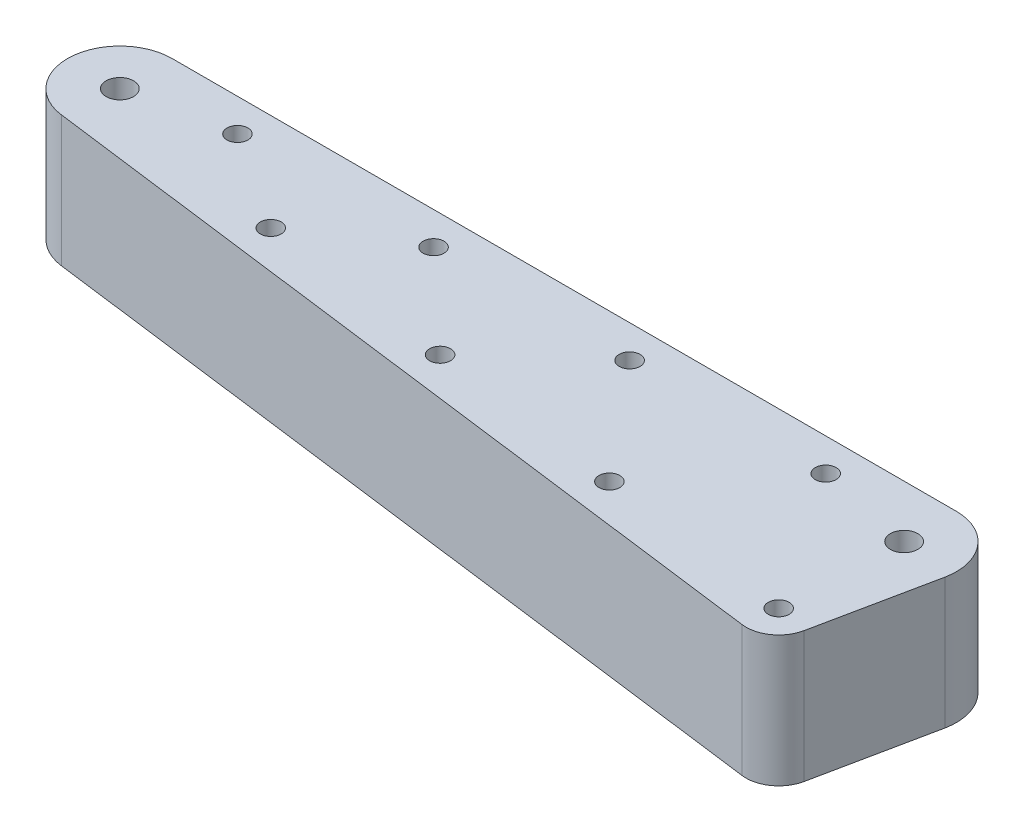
ISO-10303-21;
HEADER;
FILE_DESCRIPTION(('STEP AP214'),'2;1');
FILE_NAME('part.step','',(''),(''),'','','');
FILE_SCHEMA(('AUTOMOTIVE_DESIGN { 1 0 10303 214 1 1 1 1 }'));
ENDSEC;
DATA;
#1=APPLICATION_CONTEXT('core data for automotive mechanical design processes');
#2=APPLICATION_PROTOCOL_DEFINITION('international standard','automotive_design',2000,#1);
#3=PRODUCT_CONTEXT('',#1,'mechanical');
#4=PRODUCT('Part','Part','',(#3));
#5=PRODUCT_RELATED_PRODUCT_CATEGORY('part','',(#4));
#6=PRODUCT_DEFINITION_FORMATION('','',#4);
#7=PRODUCT_DEFINITION_CONTEXT('part definition',#1,'design');
#8=PRODUCT_DEFINITION('design','',#6,#7);
#9=PRODUCT_DEFINITION_SHAPE('','',#8);
#10=(LENGTH_UNIT() NAMED_UNIT(*) SI_UNIT(.MILLI.,.METRE.));
#11=(NAMED_UNIT(*) PLANE_ANGLE_UNIT() SI_UNIT($,.RADIAN.));
#12=(NAMED_UNIT(*) SI_UNIT($,.STERADIAN.) SOLID_ANGLE_UNIT());
#13=UNCERTAINTY_MEASURE_WITH_UNIT(LENGTH_MEASURE(1.E-05),#10,'distance_accuracy_value','');
#14=(GEOMETRIC_REPRESENTATION_CONTEXT(3) GLOBAL_UNCERTAINTY_ASSIGNED_CONTEXT((#13)) GLOBAL_UNIT_ASSIGNED_CONTEXT((#10,
#11,#12)) REPRESENTATION_CONTEXT('',''));
#15=CARTESIAN_POINT('',(0.,0.,0.));
#16=DIRECTION('',(0.,0.,1.));
#17=DIRECTION('',(1.,0.,0.));
#18=AXIS2_PLACEMENT_3D('',#15,#16,#17);
#19=CARTESIAN_POINT('',(0.,4.,-8.));
#20=DIRECTION('',(0.,0.,1.));
#21=DIRECTION('',(1.,0.,0.));
#22=AXIS2_PLACEMENT_3D('',#19,#20,#21);
#23=PLANE('',#22);
#24=CARTESIAN_POINT('',(59.32734375,17.67890625,-8.));
#25=CARTESIAN_POINT('',(59.3319408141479,17.6073602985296,-8.));
#26=CARTESIAN_POINT('',(59.3414745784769,17.4589825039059,-8.));
#27=CARTESIAN_POINT('',(59.4079919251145,17.2449612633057,-8.));
#28=CARTESIAN_POINT('',(59.4907254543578,17.047094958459,-8.));
#29=CARTESIAN_POINT('',(59.5930076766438,16.8696415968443,-8.));
#30=CARTESIAN_POINT('',(59.72554421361,16.7038533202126,-8.));
#31=CARTESIAN_POINT('',(59.8806331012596,16.5110669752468,-8.));
#32=CARTESIAN_POINT('',(60.0789867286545,16.2850932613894,-8.));
#33=CARTESIAN_POINT('',(60.2241122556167,16.1220301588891,-8.));
#34=CARTESIAN_POINT('',(60.303515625,16.0328125,-8.));
#35=B_SPLINE_CURVE_WITH_KNOTS('',3,(#24,#25,#26,#27,#28,#29,#30,#31,#32,#33,#34),.UNSPECIFIED.,
.F.,.F.,(4,1,1,1,1,1,1,1,4),(0.,0.109479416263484,0.22704728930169,0.340900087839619,
0.437887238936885,0.539536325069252,0.665579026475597,0.817026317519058,1.),.UNSPECIFIED.);
#36=CARTESIAN_POINT('',(59.32734375,17.67890625,-8.));
#37=VERTEX_POINT('',#36);
#38=CARTESIAN_POINT('',(60.303515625,16.0328125,-8.));
#39=VERTEX_POINT('',#38);
#40=EDGE_CURVE('E64',#37,#39,#35,.T.);
#41=ORIENTED_EDGE('',*,*,#40,.T.);
#42=DIRECTION('',(0.669579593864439,-0.742740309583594,0.));
#43=VECTOR('',#42,1.);
#44=CARTESIAN_POINT('',(60.303515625,16.0328125,-8.));
#45=LINE('',#44,#43);
#46=CARTESIAN_POINT('',(64.908203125,10.925,-8.));
#47=VERTEX_POINT('',#46);
#48=EDGE_CURVE('E588',#39,#47,#45,.T.);
#49=ORIENTED_EDGE('',*,*,#48,.T.);
#50=DIRECTION('',(-1.,0.,0.));
#51=VECTOR('',#50,1.);
#52=CARTESIAN_POINT('',(64.908203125,10.925,-8.));
#53=LINE('',#52,#51);
#54=CARTESIAN_POINT('',(59.980859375,10.925,-8.));
#55=VERTEX_POINT('',#54);
#56=EDGE_CURVE('E582',#47,#55,#53,.T.);
#57=ORIENTED_EDGE('',*,*,#56,.T.);
#58=CARTESIAN_POINT('',(59.980859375,10.925,-8.));
#59=CARTESIAN_POINT('',(59.8866954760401,10.9225367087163,-8.));
#60=CARTESIAN_POINT('',(59.709474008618,10.9179006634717,-8.));
#61=CARTESIAN_POINT('',(59.4612870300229,10.8657960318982,-8.));
#62=CARTESIAN_POINT('',(59.2491455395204,10.7793701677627,-8.));
#63=CARTESIAN_POINT('',(59.0759725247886,10.6560618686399,-8.));
#64=CARTESIAN_POINT('',(58.9397007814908,10.508038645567,-8.));
#65=CARTESIAN_POINT('',(58.8448026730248,10.3350706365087,-8.));
#66=CARTESIAN_POINT('',(58.7852007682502,10.1441087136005,-8.));
#67=CARTESIAN_POINT('',(58.7784491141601,10.0094275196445,-8.));
#68=CARTESIAN_POINT('',(58.775,9.940625,-8.));
#69=B_SPLINE_CURVE_WITH_KNOTS('',3,(#58,#59,#60,#61,#62,#63,#64,#65,#66,#67,#68),.UNSPECIFIED.,
.F.,.F.,(4,1,1,1,1,1,1,1,4),(0.,0.160489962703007,0.302050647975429,0.430321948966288,
0.548582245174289,0.662007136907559,0.770637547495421,0.882829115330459,1.),.UNSPECIFIED.);
#70=CARTESIAN_POINT('',(58.775,9.940625,-8.));
#71=VERTEX_POINT('',#70);
#72=EDGE_CURVE('E574',#55,#71,#69,.T.);
#73=ORIENTED_EDGE('',*,*,#72,.T.);
#74=CARTESIAN_POINT('',(58.775,9.940625,-8.));
#75=CARTESIAN_POINT('',(58.778829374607,9.87468944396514,-8.));
#76=CARTESIAN_POINT('',(58.7863094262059,9.74589521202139,-8.));
#77=CARTESIAN_POINT('',(58.8405716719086,9.56061476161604,-8.));
#78=CARTESIAN_POINT('',(58.9417728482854,9.39908657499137,-8.));
#79=CARTESIAN_POINT('',(59.0731336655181,9.25385283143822,-8.));
#80=CARTESIAN_POINT('',(59.2466540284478,9.13823097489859,-8.));
#81=CARTESIAN_POINT('',(59.4580713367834,9.05595492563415,-8.));
#82=CARTESIAN_POINT('',(59.7071118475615,9.00793202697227,-8.));
#83=CARTESIAN_POINT('',(59.8858430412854,9.00275316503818,-8.));
#84=CARTESIAN_POINT('',(59.980859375,9.,-8.));
#85=B_SPLINE_CURVE_WITH_KNOTS('',3,(#74,#75,#76,#77,#78,#79,#80,#81,#82,#83,#84),.UNSPECIFIED.,
.F.,.F.,(4,1,1,1,1,1,1,1,4),(0.,0.114564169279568,0.223782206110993,0.331065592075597,
0.443139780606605,0.561737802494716,0.689665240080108,0.835021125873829,1.),.UNSPECIFIED.);
#86=CARTESIAN_POINT('',(59.980859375,9.,-8.));
#87=VERTEX_POINT('',#86);
#88=EDGE_CURVE('E569',#71,#87,#85,.T.);
#89=ORIENTED_EDGE('',*,*,#88,.T.);
#90=DIRECTION('',(1.,0.,0.));
#91=VECTOR('',#90,1.);
#92=CARTESIAN_POINT('',(59.980859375,9.,-8.));
#93=LINE('',#92,#91);
#94=CARTESIAN_POINT('',(66.79765625,9.,-8.));
#95=VERTEX_POINT('',#94);
#96=EDGE_CURVE('E563',#87,#95,#93,.T.);
#97=ORIENTED_EDGE('',*,*,#96,.T.);
#98=CARTESIAN_POINT('',(66.79765625,9.,-8.));
#99=CARTESIAN_POINT('',(66.9099961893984,9.00330235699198,-8.));
#100=CARTESIAN_POINT('',(67.1217662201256,9.00952757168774,-8.));
#101=CARTESIAN_POINT('',(67.418441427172,9.06485788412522,-8.));
#102=CARTESIAN_POINT('',(67.6691071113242,9.16348712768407,-8.));
#103=CARTESIAN_POINT('',(67.8761789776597,9.29838212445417,-8.));
#104=CARTESIAN_POINT('',(68.0312758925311,9.47361140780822,-8.));
#105=CARTESIAN_POINT('',(68.146995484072,9.67371703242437,-8.));
#106=CARTESIAN_POINT('',(68.2136749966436,9.90463191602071,-8.));
#107=CARTESIAN_POINT('',(68.2211284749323,10.0668906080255,-8.));
#108=CARTESIAN_POINT('',(68.225,10.151171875,-8.));
#109=B_SPLINE_CURVE_WITH_KNOTS('',3,(#98,#99,#100,#101,#102,#103,#104,#105,#106,#107,#108),
.UNSPECIFIED.,.F.,.F.,(4,1,1,1,1,1,1,1,4),(0.,0.161830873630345,0.305064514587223,
0.432393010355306,0.547882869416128,0.657627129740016,0.766463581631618,0.878695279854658,1.),.UNSPECIFIED.);
#110=CARTESIAN_POINT('',(68.225,10.151171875,-8.));
#111=VERTEX_POINT('',#110);
#112=EDGE_CURVE('E555',#95,#111,#109,.T.);
#113=ORIENTED_EDGE('',*,*,#112,.T.);
#114=CARTESIAN_POINT('',(68.225,10.151171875,-8.));
#115=CARTESIAN_POINT('',(68.2214754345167,10.204343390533,-8.));
#116=CARTESIAN_POINT('',(68.2142394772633,10.3135048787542,-8.));
#117=CARTESIAN_POINT('',(68.1653012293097,10.4754272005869,-8.));
#118=CARTESIAN_POINT('',(68.0866704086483,10.6376363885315,-8.));
#119=CARTESIAN_POINT('',(67.9932977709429,10.7705796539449,-8.));
#120=CARTESIAN_POINT('',(67.9013176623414,10.8871947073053,-8.));
#121=CARTESIAN_POINT('',(67.81189252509,10.9913621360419,-8.));
#122=CARTESIAN_POINT('',(67.7090486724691,11.1143882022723,-8.));
#123=CARTESIAN_POINT('',(67.5885573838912,11.2537103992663,-8.));
#124=CARTESIAN_POINT('',(67.4507112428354,11.4094865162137,-8.));
#125=CARTESIAN_POINT('',(67.2996835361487,11.5853512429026,-8.));
#126=CARTESIAN_POINT('',(67.1251422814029,11.7721699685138,-8.));
#127=CARTESIAN_POINT('',(67.006978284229,11.9054471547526,-8.));
#128=CARTESIAN_POINT('',(66.9453125,11.975,-8.));
#129=B_SPLINE_CURVE_WITH_KNOTS('',3,(#114,#115,#116,#117,#118,#119,#120,#121,#122,#123,#124,
#125,#126,#127,#128),.UNSPECIFIED.,.F.,.F.,(4,1,1,1,1,1,1,1,1,1,1,1,4),(0.,0.0702845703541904,
0.144294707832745,0.221926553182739,0.307846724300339,0.358486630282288,0.418368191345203,
0.489362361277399,0.570552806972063,0.661946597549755,0.764452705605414,0.877075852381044,1.),.UNSPECIFIED.);
#130=CARTESIAN_POINT('',(66.9453125,11.975,-8.));
#131=VERTEX_POINT('',#130);
#132=EDGE_CURVE('E547',#111,#131,#129,.T.);
#133=ORIENTED_EDGE('',*,*,#132,.T.);
#134=CARTESIAN_POINT('',(66.9453125,11.975,-8.));
#135=CARTESIAN_POINT('',(66.8104421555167,12.1235908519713,-8.));
#136=CARTESIAN_POINT('',(66.5472121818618,12.4135994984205,-8.));
#137=CARTESIAN_POINT('',(66.1608406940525,12.838418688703,-8.));
#138=CARTESIAN_POINT('',(65.7934020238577,13.2411734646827,-8.));
#139=CARTESIAN_POINT('',(65.3363412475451,13.7411805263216,-8.));
#140=CARTESIAN_POINT('',(64.800435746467,14.3282708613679,-8.));
#141=CARTESIAN_POINT('',(64.2877981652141,14.8930260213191,-8.));
#142=CARTESIAN_POINT('',(63.9101819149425,15.3147075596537,-8.));
#143=CARTESIAN_POINT('',(63.6570360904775,15.6011217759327,-8.));
#144=CARTESIAN_POINT('',(63.4286334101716,15.8613456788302,-8.));
#145=CARTESIAN_POINT('',(63.2242515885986,16.0998348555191,-8.));
#146=CARTESIAN_POINT('',(63.039653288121,16.314873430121,-8.));
#147=CARTESIAN_POINT('',(62.8778926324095,16.51658872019,-8.));
#148=CARTESIAN_POINT('',(62.7335243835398,16.6997981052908,-8.));
#149=CARTESIAN_POINT('',(62.6465511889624,16.8191563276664,-8.));
#150=CARTESIAN_POINT('',(62.605859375,16.875,-8.));
#151=B_SPLINE_CURVE_WITH_KNOTS('',3,(#134,#135,#136,#137,#138,#139,#140,#141,#142,#143,#144,
#145,#146,#147,#148,#149,#150),.UNSPECIFIED.,.F.,.F.,(4,1,1,1,1,1,1,1,1,1,1,1,1,1,4),(0.,
0.0919483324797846,0.179457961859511,0.26311896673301,0.341751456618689,0.48985784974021,
0.627345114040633,0.691230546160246,0.749219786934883,0.802493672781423,0.849876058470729,
0.89313678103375,0.932336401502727,0.968342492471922,1.),.UNSPECIFIED.);
#152=CARTESIAN_POINT('',(62.605859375,16.875,-8.));
#153=VERTEX_POINT('',#152);
#154=EDGE_CURVE('E542',#131,#153,#151,.T.);
#155=ORIENTED_EDGE('',*,*,#154,.T.);
#156=DIRECTION('',(1.,0.,0.));
#157=VECTOR('',#156,1.);
#158=CARTESIAN_POINT('',(62.605859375,16.875,-8.));
#159=LINE('',#158,#157);
#160=CARTESIAN_POINT('',(66.34375,16.875,-8.));
#161=VERTEX_POINT('',#160);
#162=EDGE_CURVE('E536',#153,#161,#159,.T.);
#163=ORIENTED_EDGE('',*,*,#162,.T.);
#164=CARTESIAN_POINT('',(66.34375,16.875,-8.));
#165=CARTESIAN_POINT('',(66.4650115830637,16.8761766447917,-8.));
#166=CARTESIAN_POINT('',(66.6914923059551,16.8783742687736,-8.));
#167=CARTESIAN_POINT('',(67.0089803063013,16.9043522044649,-8.));
#168=CARTESIAN_POINT('',(67.2784349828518,16.9513874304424,-8.));
#169=CARTESIAN_POINT('',(67.5081970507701,17.0064979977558,-8.));
#170=CARTESIAN_POINT('',(67.6971977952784,17.1142411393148,-8.));
#171=CARTESIAN_POINT('',(67.8275226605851,17.2905627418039,-8.));
#172=CARTESIAN_POINT('',(67.9003719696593,17.525009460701,-8.));
#173=CARTESIAN_POINT('',(67.9069360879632,17.6983815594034,-8.));
#174=CARTESIAN_POINT('',(67.910546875,17.79375,-8.));
#175=B_SPLINE_CURVE_WITH_KNOTS('',3,(#164,#165,#166,#167,#168,#169,#170,#171,#172,#173,#174),
.UNSPECIFIED.,.F.,.F.,(4,1,1,1,1,1,1,1,4),(0.,0.17230878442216,0.321821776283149,
0.451925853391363,0.560986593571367,0.656280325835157,0.75420484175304,0.864793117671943,1.),.UNSPECIFIED.);
#176=CARTESIAN_POINT('',(67.910546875,17.79375,-8.));
#177=VERTEX_POINT('',#176);
#178=EDGE_CURVE('E528',#161,#177,#175,.T.);
#179=ORIENTED_EDGE('',*,*,#178,.T.);
#180=CARTESIAN_POINT('',(67.910546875,17.79375,-8.));
#181=CARTESIAN_POINT('',(67.9070233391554,17.8670445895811,-8.));
#182=CARTESIAN_POINT('',(67.9002633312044,18.0076624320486,-8.));
#183=CARTESIAN_POINT('',(67.8441608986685,18.2075071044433,-8.));
#184=CARTESIAN_POINT('',(67.7499415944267,18.3839881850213,-8.));
#185=CARTESIAN_POINT('',(67.6152709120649,18.5336949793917,-8.));
#186=CARTESIAN_POINT('',(67.447115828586,18.6554649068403,-8.));
#187=CARTESIAN_POINT('',(67.2440398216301,18.7399505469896,-8.));
#188=CARTESIAN_POINT('',(67.011793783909,18.7926460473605,-8.));
#189=CARTESIAN_POINT('',(66.8462737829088,18.7974682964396,-8.));
#190=CARTESIAN_POINT('',(66.759375,18.8,-8.));
#191=B_SPLINE_CURVE_WITH_KNOTS('',3,(#180,#181,#182,#183,#184,#185,#186,#187,#188,#189,#190),
.UNSPECIFIED.,.F.,.F.,(4,1,1,1,1,1,1,1,4),(0.,0.126900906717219,0.243463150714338,
0.356589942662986,0.470760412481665,0.589613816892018,0.713487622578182,0.849579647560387,1.),.UNSPECIFIED.);
#192=CARTESIAN_POINT('',(66.759375,18.8,-8.));
#193=VERTEX_POINT('',#192);
#194=EDGE_CURVE('E523',#177,#193,#191,.T.);
#195=ORIENTED_EDGE('',*,*,#194,.T.);
#196=DIRECTION('',(-1.,0.,0.));
#197=VECTOR('',#196,1.);
#198=CARTESIAN_POINT('',(66.759375,18.8,-8.));
#199=LINE('',#198,#197);
#200=CARTESIAN_POINT('',(60.984375,18.8,-8.));
#201=VERTEX_POINT('',#200);
#202=EDGE_CURVE('E516',#193,#201,#199,.T.);
#203=ORIENTED_EDGE('',*,*,#202,.T.);
#204=CARTESIAN_POINT('',(60.984375,18.8,-8.));
#205=CARTESIAN_POINT('',(60.8585271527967,18.7965183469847,-8.));
#206=CARTESIAN_POINT('',(60.6214789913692,18.7899602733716,-8.));
#207=CARTESIAN_POINT('',(60.2879413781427,18.7508560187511,-8.));
#208=CARTESIAN_POINT('',(60.0027483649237,18.6693732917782,-8.));
#209=CARTESIAN_POINT('',(59.7587805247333,18.5665404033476,-8.));
#210=CARTESIAN_POINT('',(59.5586386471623,18.4189618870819,-8.));
#211=CARTESIAN_POINT('',(59.4201471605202,18.213866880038,-8.));
#212=CARTESIAN_POINT('',(59.3406892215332,17.960665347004,-8.));
#213=CARTESIAN_POINT('',(59.3319920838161,17.7770451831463,-8.));
#214=CARTESIAN_POINT('',(59.32734375,17.67890625,-8.));
#215=B_SPLINE_CURVE_WITH_KNOTS('',3,(#204,#205,#206,#207,#208,#209,#210,#211,#212,#213,#214),
.UNSPECIFIED.,.F.,.F.,(4,1,1,1,1,1,1,1,4),(0.,0.165055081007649,0.310899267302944,
0.438761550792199,0.552687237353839,0.656652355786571,0.759734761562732,0.871586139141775,1.),.UNSPECIFIED.);
#216=EDGE_CURVE('E511',#201,#37,#215,.T.);
#217=ORIENTED_EDGE('',*,*,#216,.T.);
#218=EDGE_LOOP('',(#41,#49,#57,#73,#89,#97,#113,#133,#155,#163,#179,#195,#203,#217));
#219=FACE_BOUND('',#218,.T.);
#220=DIRECTION('',(0.,-1.,0.));
#221=VECTOR('',#220,1.);
#222=CARTESIAN_POINT('',(120.,4.,-8.));
#223=LINE('',#222,#221);
#224=CARTESIAN_POINT('',(120.,24.,-8.));
#225=VERTEX_POINT('',#224);
#226=CARTESIAN_POINT('',(120.,4.,-8.));
#227=VERTEX_POINT('',#226);
#228=EDGE_CURVE('E49',#225,#227,#223,.T.);
#229=ORIENTED_EDGE('',*,*,#228,.T.);
#230=DIRECTION('',(-1.,0.,0.));
#231=VECTOR('',#230,1.);
#232=CARTESIAN_POINT('',(0.,4.,-8.));
#233=LINE('',#232,#231);
#234=CARTESIAN_POINT('',(0.,4.,-8.));
#235=VERTEX_POINT('',#234);
#236=EDGE_CURVE('E641',#227,#235,#233,.T.);
#237=ORIENTED_EDGE('',*,*,#236,.T.);
#238=DIRECTION('',(0.,-1.,0.));
#239=VECTOR('',#238,1.);
#240=CARTESIAN_POINT('',(0.,4.,-8.));
#241=LINE('',#240,#239);
#242=CARTESIAN_POINT('',(0.,24.,-7.99999999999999));
#243=VERTEX_POINT('',#242);
#244=EDGE_CURVE('E737',#243,#235,#241,.T.);
#245=ORIENTED_EDGE('',*,*,#244,.F.);
#246=DIRECTION('',(-1.,0.,0.));
#247=VECTOR('',#246,1.);
#248=CARTESIAN_POINT('',(0.,24.,-8.));
#249=LINE('',#248,#247);
#250=EDGE_CURVE('E714',#225,#243,#249,.T.);
#251=ORIENTED_EDGE('',*,*,#250,.F.);
#252=EDGE_LOOP('',(#229,#237,#245,#251));
#253=FACE_BOUND('',#252,.T.);
#254=CARTESIAN_POINT('',(48.69609375,15.9671875,-8.));
#255=CARTESIAN_POINT('',(48.7190508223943,15.9101409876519,-8.));
#256=CARTESIAN_POINT('',(48.7685295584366,15.7871902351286,-8.));
#257=CARTESIAN_POINT('',(48.8234508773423,15.5825383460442,-8.));
#258=CARTESIAN_POINT('',(48.8697486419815,15.3476485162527,-8.));
#259=CARTESIAN_POINT('',(48.9061346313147,15.0826658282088,-8.));
#260=CARTESIAN_POINT('',(48.9402067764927,14.7874990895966,-8.));
#261=CARTESIAN_POINT('',(48.9611862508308,14.4617339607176,-8.));
#262=CARTESIAN_POINT('',(48.9706515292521,14.1060469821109,-8.));
#263=CARTESIAN_POINT('',(48.9735119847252,13.8589889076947,-8.));
#264=CARTESIAN_POINT('',(48.975,13.73046875,-8.));
#265=B_SPLINE_CURVE_WITH_KNOTS('',3,(#254,#255,#256,#257,#258,#259,#260,#261,#262,#263,#264),
.UNSPECIFIED.,.F.,.F.,(4,1,1,1,1,1,1,1,4),(0.,0.0813229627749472,0.175273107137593,
0.279837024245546,0.398058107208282,0.529137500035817,0.673008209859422,0.829898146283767,1.),.UNSPECIFIED.);
#266=CARTESIAN_POINT('',(48.69609375,15.9671875,-8.));
#267=VERTEX_POINT('',#266);
#268=CARTESIAN_POINT('',(48.975,13.73046875,-8.));
#269=VERTEX_POINT('',#268);
#270=EDGE_CURVE('E484',#267,#269,#265,.T.);
#271=ORIENTED_EDGE('',*,*,#270,.T.);
#272=DIRECTION('',(0.,-1.,0.));
#273=VECTOR('',#272,1.);
#274=CARTESIAN_POINT('',(48.975,13.73046875,-8.));
#275=LINE('',#274,#273);
#276=CARTESIAN_POINT('',(48.975,10.402734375,-8.));
#277=VERTEX_POINT('',#276);
#278=EDGE_CURVE('E1987',#269,#277,#275,.T.);
#279=ORIENTED_EDGE('',*,*,#278,.T.);
#280=CARTESIAN_POINT('',(48.975,10.402734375,-8.));
#281=CARTESIAN_POINT('',(48.9785126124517,10.279353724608,-8.));
#282=CARTESIAN_POINT('',(48.9851581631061,10.0459284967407,-8.));
#283=CARTESIAN_POINT('',(49.0522326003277,9.71948116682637,-8.));
#284=CARTESIAN_POINT('',(49.1671589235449,9.44150065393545,-8.));
#285=CARTESIAN_POINT('',(49.3283644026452,9.21422760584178,-8.));
#286=CARTESIAN_POINT('',(49.5287370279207,9.04002778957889,-8.));
#287=CARTESIAN_POINT('',(49.7594586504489,8.91287457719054,-8.));
#288=CARTESIAN_POINT('',(50.0213458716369,8.83795437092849,-8.));
#289=CARTESIAN_POINT('',(50.2058922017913,8.82941091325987,-8.));
#290=CARTESIAN_POINT('',(50.301171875,8.825,-8.));
#291=B_SPLINE_CURVE_WITH_KNOTS('',3,(#280,#281,#282,#283,#284,#285,#286,#287,#288,#289,#290),
.UNSPECIFIED.,.F.,.F.,(4,1,1,1,1,1,1,1,4),(0.,0.158279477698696,0.299450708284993,
0.42531497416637,0.541913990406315,0.653886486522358,0.763359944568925,0.877824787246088,1.),.UNSPECIFIED.);
#292=CARTESIAN_POINT('',(50.301171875,8.825,-8.));
#293=VERTEX_POINT('',#292);
#294=EDGE_CURVE('E1979',#277,#293,#291,.T.);
#295=ORIENTED_EDGE('',*,*,#294,.T.);
#296=CARTESIAN_POINT('',(50.301171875,8.825,-8.));
#297=CARTESIAN_POINT('',(50.3937664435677,8.82933292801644,-8.));
#298=CARTESIAN_POINT('',(50.5730390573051,8.83772192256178,-8.));
#299=CARTESIAN_POINT('',(50.8280320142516,8.91413447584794,-8.));
#300=CARTESIAN_POINT('',(51.0546368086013,9.04003430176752,-8.));
#301=CARTESIAN_POINT('',(51.2521910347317,9.21447097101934,-8.));
#302=CARTESIAN_POINT('',(51.4107824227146,9.44173833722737,-8.));
#303=CARTESIAN_POINT('',(51.5220747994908,9.7201104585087,-8.));
#304=CARTESIAN_POINT('',(51.5900705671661,10.0458440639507,-8.));
#305=CARTESIAN_POINT('',(51.5965664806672,10.2793245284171,-8.));
#306=CARTESIAN_POINT('',(51.6,10.402734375,-8.));
#307=B_SPLINE_CURVE_WITH_KNOTS('',3,(#296,#297,#298,#299,#300,#301,#302,#303,#304,#305,#306),
.UNSPECIFIED.,.F.,.F.,(4,1,1,1,1,1,1,1,4),(0.,0.119864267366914,0.232069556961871,
0.341602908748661,0.453808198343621,0.570888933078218,0.697554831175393,0.840137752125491,1.),.UNSPECIFIED.);
#308=CARTESIAN_POINT('',(51.6,10.402734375,-8.));
#309=VERTEX_POINT('',#308);
#310=EDGE_CURVE('E1974',#293,#309,#307,.T.);
#311=ORIENTED_EDGE('',*,*,#310,.T.);
#312=DIRECTION('',(0.,1.,0.));
#313=VECTOR('',#312,1.);
#314=CARTESIAN_POINT('',(51.6,10.402734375,-8.));
#315=LINE('',#314,#313);
#316=CARTESIAN_POINT('',(51.6,14.3921875,-8.));
#317=VERTEX_POINT('',#316);
#318=EDGE_CURVE('E1968',#309,#317,#315,.T.);
#319=ORIENTED_EDGE('',*,*,#318,.T.);
#320=CARTESIAN_POINT('',(51.6,14.3921875,-8.));
#321=CARTESIAN_POINT('',(51.5998555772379,14.5407744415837,-8.));
#322=CARTESIAN_POINT('',(51.5995834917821,14.8207050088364,-8.));
#323=CARTESIAN_POINT('',(51.614991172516,15.2135612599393,-8.));
#324=CARTESIAN_POINT('',(51.6317509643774,15.5539242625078,-8.));
#325=CARTESIAN_POINT('',(51.6604196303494,15.8465476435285,-8.));
#326=CARTESIAN_POINT('',(51.7063025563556,16.1026620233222,-8.));
#327=CARTESIAN_POINT('',(51.77546992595,16.3324949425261,-8.));
#328=CARTESIAN_POINT('',(51.8784625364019,16.5368126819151,-8.));
#329=CARTESIAN_POINT('',(52.0071438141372,16.7189790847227,-8.));
#330=CARTESIAN_POINT('',(52.1727980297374,16.8714025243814,-8.));
#331=CARTESIAN_POINT('',(52.3847018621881,16.97660636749,-8.));
#332=CARTESIAN_POINT('',(52.6355344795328,17.0389288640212,-8.));
#333=CARTESIAN_POINT('',(52.8164025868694,17.0461587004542,-8.));
#334=CARTESIAN_POINT('',(52.9125,17.05,-8.));
#335=B_SPLINE_CURVE_WITH_KNOTS('',3,(#320,#321,#322,#323,#324,#325,#326,#327,#328,#329,#330,
#331,#332,#333,#334),.UNSPECIFIED.,.F.,.F.,(4,1,1,1,1,1,1,1,1,1,1,1,4),(0.,0.131298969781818,
0.247360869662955,0.347401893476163,0.432442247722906,0.507010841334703,0.577070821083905,
0.643713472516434,0.708324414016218,0.773345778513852,0.840352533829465,0.915177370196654,1.),.UNSPECIFIED.);
#336=CARTESIAN_POINT('',(52.9125,17.05,-8.));
#337=VERTEX_POINT('',#336);
#338=EDGE_CURVE('E1960',#317,#337,#335,.T.);
#339=ORIENTED_EDGE('',*,*,#338,.T.);
#340=CARTESIAN_POINT('',(52.9125,17.05,-8.));
#341=CARTESIAN_POINT('',(53.0110600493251,17.0473490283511,-8.));
#342=CARTESIAN_POINT('',(53.1998655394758,17.0422707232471,-8.));
#343=CARTESIAN_POINT('',(53.4698799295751,17.0047263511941,-8.));
#344=CARTESIAN_POINT('',(53.7137645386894,16.9394050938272,-8.));
#345=CARTESIAN_POINT('',(53.9324105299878,16.8461016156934,-8.));
#346=CARTESIAN_POINT('',(54.1252828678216,16.7262238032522,-8.));
#347=CARTESIAN_POINT('',(54.2904034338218,16.5777113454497,-8.));
#348=CARTESIAN_POINT('',(54.4280183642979,16.403344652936,-8.));
#349=CARTESIAN_POINT('',(54.5402545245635,16.2029717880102,-8.));
#350=CARTESIAN_POINT('',(54.6321605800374,15.9789537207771,-8.));
#351=CARTESIAN_POINT('',(54.7110157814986,15.7328221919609,-8.));
#352=CARTESIAN_POINT('',(54.7755436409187,15.4637927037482,-8.));
#353=CARTESIAN_POINT('',(54.8300992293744,15.1726691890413,-8.));
#354=CARTESIAN_POINT('',(54.8740462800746,14.8588679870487,-8.));
#355=CARTESIAN_POINT('',(54.9025671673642,14.5211159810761,-8.));
#356=CARTESIAN_POINT('',(54.9229076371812,14.1609263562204,-8.));
#357=CARTESIAN_POINT('',(54.9242892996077,13.912791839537,-8.));
#358=CARTESIAN_POINT('',(54.925,13.78515625,-8.));
#359=B_SPLINE_CURVE_WITH_KNOTS('',3,(#340,#341,#342,#343,#344,#345,#346,#347,#348,#349,#350,
#351,#352,#353,#354,#355,#356,#357,#358),.UNSPECIFIED.,.F.,.F.,(4,1,1,1,1,1,1,1,1,1,1,1,1,1,1,1,
4),(0.,0.0670454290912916,0.1284348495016,0.184999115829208,0.238333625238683,0.289605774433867,
0.338787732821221,0.388664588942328,0.440045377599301,0.494521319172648,0.553158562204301,
0.615726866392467,0.68262012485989,0.754621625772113,0.831201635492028,0.913173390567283,1.),.UNSPECIFIED.);
#360=CARTESIAN_POINT('',(54.925,13.78515625,-8.));
#361=VERTEX_POINT('',#360);
#362=EDGE_CURVE('E1955',#337,#361,#359,.T.);
#363=ORIENTED_EDGE('',*,*,#362,.T.);
#364=DIRECTION('',(0.,-1.,0.));
#365=VECTOR('',#364,1.);
#366=CARTESIAN_POINT('',(54.925,13.78515625,-8.));
#367=LINE('',#366,#365);
#368=CARTESIAN_POINT('',(54.925,10.402734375,-8.));
#369=VERTEX_POINT('',#368);
#370=EDGE_CURVE('E1949',#361,#369,#367,.T.);
#371=ORIENTED_EDGE('',*,*,#370,.T.);
#372=CARTESIAN_POINT('',(54.925,10.402734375,-8.));
#373=CARTESIAN_POINT('',(54.9282934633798,10.2801939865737,-8.));
#374=CARTESIAN_POINT('',(54.9344982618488,10.049331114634,-8.));
#375=CARTESIAN_POINT('',(55.0039433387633,9.72679130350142,-8.));
#376=CARTESIAN_POINT('',(55.1143316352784,9.44844375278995,-8.));
#377=CARTESIAN_POINT('',(55.2757837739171,9.22115240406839,-8.));
#378=CARTESIAN_POINT('',(55.4719843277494,9.042330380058,-8.));
#379=CARTESIAN_POINT('',(55.7010522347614,8.91714320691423,-8.));
#380=CARTESIAN_POINT('',(55.9569563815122,8.83690196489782,-8.));
#381=CARTESIAN_POINT('',(56.1384416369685,8.82904944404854,-8.));
#382=CARTESIAN_POINT('',(56.23203125,8.825,-8.));
#383=B_SPLINE_CURVE_WITH_KNOTS('',3,(#372,#373,#374,#375,#376,#377,#378,#379,#380,#381,#382),
.UNSPECIFIED.,.F.,.F.,(4,1,1,1,1,1,1,1,4),(0.,0.158429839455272,0.298477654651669,
0.424942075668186,0.543481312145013,0.656294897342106,0.765654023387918,0.879150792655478,1.),.UNSPECIFIED.);
#384=CARTESIAN_POINT('',(56.23203125,8.825,-8.));
#385=VERTEX_POINT('',#384);
#386=EDGE_CURVE('E1941',#369,#385,#383,.T.);
#387=ORIENTED_EDGE('',*,*,#386,.T.);
#388=CARTESIAN_POINT('',(56.23203125,8.825,-8.));
#389=CARTESIAN_POINT('',(56.3245741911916,8.82947958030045,-8.));
#390=CARTESIAN_POINT('',(56.5046221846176,8.83819487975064,-8.));
#391=CARTESIAN_POINT('',(56.7623355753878,8.91349860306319,-8.));
#392=CARTESIAN_POINT('',(56.9901189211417,9.0431174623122,-8.));
#393=CARTESIAN_POINT('',(57.1919434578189,9.21780247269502,-8.));
#394=CARTESIAN_POINT('',(57.3549646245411,9.4456934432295,-8.));
#395=CARTESIAN_POINT('',(57.4683006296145,9.7237199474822,-8.));
#396=CARTESIAN_POINT('',(57.5412708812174,10.0462831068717,-8.));
#397=CARTESIAN_POINT('',(57.5469749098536,10.2774188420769,-8.));
#398=CARTESIAN_POINT('',(57.55,10.4,-8.));
#399=B_SPLINE_CURVE_WITH_KNOTS('',3,(#388,#389,#390,#391,#392,#393,#394,#395,#396,#397,#398),
.UNSPECIFIED.,.F.,.F.,(4,1,1,1,1,1,1,1,4),(0.,0.119484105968,0.232463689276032,
0.343252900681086,0.455986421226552,0.575022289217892,0.701741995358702,0.841821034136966,1.),.UNSPECIFIED.);
#400=CARTESIAN_POINT('',(57.55,10.4,-8.));
#401=VERTEX_POINT('',#400);
#402=EDGE_CURVE('E1936',#385,#401,#399,.T.);
#403=ORIENTED_EDGE('',*,*,#402,.T.);
#404=DIRECTION('',(0.,1.,0.));
#405=VECTOR('',#404,1.);
#406=CARTESIAN_POINT('',(57.55,10.4,-8.));
#407=LINE('',#406,#405);
#408=CARTESIAN_POINT('',(57.55,17.555859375,-8.));
#409=VERTEX_POINT('',#408);
#410=EDGE_CURVE('E1930',#401,#409,#407,.T.);
#411=ORIENTED_EDGE('',*,*,#410,.T.);
#412=CARTESIAN_POINT('',(57.55,17.555859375,-8.));
#413=CARTESIAN_POINT('',(57.5457353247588,17.6664055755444,-8.));
#414=CARTESIAN_POINT('',(57.5376633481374,17.8756422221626,-8.));
#415=CARTESIAN_POINT('',(57.47977582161,18.1699578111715,-8.));
#416=CARTESIAN_POINT('',(57.3750893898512,18.4226370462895,-8.));
#417=CARTESIAN_POINT('',(57.228213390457,18.6306816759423,-8.));
#418=CARTESIAN_POINT('',(57.0477853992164,18.7965991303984,-8.));
#419=CARTESIAN_POINT('',(56.8361142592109,18.9115980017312,-8.));
#420=CARTESIAN_POINT('',(56.5985386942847,18.9840984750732,-8.));
#421=CARTESIAN_POINT('',(56.4312845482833,18.9907006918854,-8.));
#422=CARTESIAN_POINT('',(56.344140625,18.994140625,-8.));
#423=B_SPLINE_CURVE_WITH_KNOTS('',3,(#412,#413,#414,#415,#416,#417,#418,#419,#420,#421,#422),
.UNSPECIFIED.,.F.,.F.,(4,1,1,1,1,1,1,1,4),(0.,0.15613790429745,0.295530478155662,
0.421319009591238,0.539566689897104,0.652595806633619,0.764400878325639,0.87724650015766,1.),.UNSPECIFIED.);
#424=CARTESIAN_POINT('',(56.344140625,18.994140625,-8.));
#425=VERTEX_POINT('',#424);
#426=EDGE_CURVE('E1922',#409,#425,#423,.T.);
#427=ORIENTED_EDGE('',*,*,#426,.T.);
#428=CARTESIAN_POINT('',(56.344140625,18.994140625,-8.));
#429=CARTESIAN_POINT('',(56.2598867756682,18.9900288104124,-8.));
#430=CARTESIAN_POINT('',(56.097053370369,18.9820821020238,-8.));
#431=CARTESIAN_POINT('',(55.8624969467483,18.9175335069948,-8.));
#432=CARTESIAN_POINT('',(55.6524020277,18.8054500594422,-8.));
#433=CARTESIAN_POINT('',(55.4661241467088,18.6548542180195,-8.));
#434=CARTESIAN_POINT('',(55.3090163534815,18.4674641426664,-8.));
#435=CARTESIAN_POINT('',(55.2002684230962,18.2408933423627,-8.));
#436=CARTESIAN_POINT('',(55.1326095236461,17.9835576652,-8.));
#437=CARTESIAN_POINT('',(55.1255619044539,17.8014947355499,-8.));
#438=CARTESIAN_POINT('',(55.121875,17.70625,-8.));
#439=B_SPLINE_CURVE_WITH_KNOTS('',3,(#428,#429,#430,#431,#432,#433,#434,#435,#436,#437,#438),
.UNSPECIFIED.,.F.,.F.,(4,1,1,1,1,1,1,1,4),(0.,0.126566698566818,0.244609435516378,
0.362317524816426,0.482184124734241,0.602917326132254,0.726730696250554,0.857041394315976,1.),.UNSPECIFIED.);
#440=CARTESIAN_POINT('',(55.121875,17.70625,-8.));
#441=VERTEX_POINT('',#440);
#442=EDGE_CURVE('E1917',#425,#441,#439,.T.);
#443=ORIENTED_EDGE('',*,*,#442,.T.);
#444=DIRECTION('',(0.,-1.,0.));
#445=VECTOR('',#444,1.);
#446=CARTESIAN_POINT('',(55.121875,17.70625,-8.));
#447=LINE('',#446,#445);
#448=CARTESIAN_POINT('',(55.121875,17.468359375,-8.));
#449=VERTEX_POINT('',#448);
#450=EDGE_CURVE('E1911',#441,#449,#447,.T.);
#451=ORIENTED_EDGE('',*,*,#450,.T.);
#452=CARTESIAN_POINT('',(55.121875,17.468359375,-8.));
#453=CARTESIAN_POINT('',(55.0133307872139,17.5921919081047,-8.));
#454=CARTESIAN_POINT('',(54.802548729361,17.8326623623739,-8.));
#455=CARTESIAN_POINT('',(54.4511172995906,18.1405399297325,-8.));
#456=CARTESIAN_POINT('',(54.0953684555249,18.405590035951,-8.));
#457=CARTESIAN_POINT('',(53.7215346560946,18.6148389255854,-8.));
#458=CARTESIAN_POINT('',(53.3328612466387,18.7784349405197,-8.));
#459=CARTESIAN_POINT('',(52.9242680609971,18.8933437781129,-8.));
#460=CARTESIAN_POINT('',(52.4947695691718,18.9636888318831,-8.));
#461=CARTESIAN_POINT('',(52.2009240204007,18.9711815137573,-8.));
#462=CARTESIAN_POINT('',(52.051171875,18.975,-8.));
#463=B_SPLINE_CURVE_WITH_KNOTS('',3,(#452,#453,#454,#455,#456,#457,#458,#459,#460,#461,#462),
.UNSPECIFIED.,.F.,.F.,(4,1,1,1,1,1,1,1,4),(0.,0.139336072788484,0.270576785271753,
0.394883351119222,0.514488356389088,0.632490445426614,0.75126282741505,0.873236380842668,1.),.UNSPECIFIED.);
#464=CARTESIAN_POINT('',(52.051171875,18.975,-8.));
#465=VERTEX_POINT('',#464);
#466=EDGE_CURVE('E1903',#449,#465,#463,.T.);
#467=ORIENTED_EDGE('',*,*,#466,.T.);
#468=CARTESIAN_POINT('',(52.051171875,18.975,-8.));
#469=CARTESIAN_POINT('',(51.8978000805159,18.9700763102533,-8.));
#470=CARTESIAN_POINT('',(51.6004009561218,18.9605289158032,-8.));
#471=CARTESIAN_POINT('',(51.1700670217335,18.8925503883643,-8.));
#472=CARTESIAN_POINT('',(50.7734340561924,18.7753926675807,-8.));
#473=CARTESIAN_POINT('',(50.4101510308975,18.6090634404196,-8.));
#474=CARTESIAN_POINT('',(50.0777024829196,18.3966731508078,-8.));
#475=CARTESIAN_POINT('',(49.7784219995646,18.1341910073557,-8.));
#476=CARTESIAN_POINT('',(49.508801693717,17.8239268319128,-8.));
#477=CARTESIAN_POINT('',(49.3602662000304,17.5890054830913,-8.));
#478=CARTESIAN_POINT('',(49.283984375,17.468359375,-8.));
#479=B_SPLINE_CURVE_WITH_KNOTS('',3,(#468,#469,#470,#471,#472,#473,#474,#475,#476,#477,#478),
.UNSPECIFIED.,.F.,.F.,(4,1,1,1,1,1,1,1,4),(0.,0.138771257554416,0.269087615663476,
0.393046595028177,0.511894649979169,0.629499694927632,0.748762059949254,0.870974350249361,1.),.UNSPECIFIED.);
#480=CARTESIAN_POINT('',(49.283984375,17.468359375,-8.));
#481=VERTEX_POINT('',#480);
#482=EDGE_CURVE('E1895',#465,#481,#479,.T.);
#483=ORIENTED_EDGE('',*,*,#482,.T.);
#484=CARTESIAN_POINT('',(49.283984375,17.468359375,-8.));
#485=CARTESIAN_POINT('',(49.1766076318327,17.5896350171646,-8.));
#486=CARTESIAN_POINT('',(48.9674233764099,17.8258961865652,-8.));
#487=CARTESIAN_POINT('',(48.6290620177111,18.1394304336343,-8.));
#488=CARTESIAN_POINT('',(48.2751726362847,18.3980592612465,-8.));
#489=CARTESIAN_POINT('',(47.9122277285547,18.6127146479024,-8.));
#490=CARTESIAN_POINT('',(47.5298046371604,18.7762298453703,-8.));
#491=CARTESIAN_POINT('',(47.1288762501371,18.8889772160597,-8.));
#492=CARTESIAN_POINT('',(46.7092293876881,18.9647573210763,-8.));
#493=CARTESIAN_POINT('',(46.4223469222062,18.9715426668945,-8.));
#494=CARTESIAN_POINT('',(46.276171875,18.975,-8.));
#495=B_SPLINE_CURVE_WITH_KNOTS('',3,(#484,#485,#486,#487,#488,#489,#490,#491,#492,#493,#494),
.UNSPECIFIED.,.F.,.F.,(4,1,1,1,1,1,1,1,4),(0.,0.139431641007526,0.271631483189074,
0.396271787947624,0.516209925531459,0.634002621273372,0.753237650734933,0.874267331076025,1.),.UNSPECIFIED.);
#496=CARTESIAN_POINT('',(46.276171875,18.975,-8.));
#497=VERTEX_POINT('',#496);
#498=EDGE_CURVE('E1887',#481,#497,#495,.T.);
#499=ORIENTED_EDGE('',*,*,#498,.T.);
#500=CARTESIAN_POINT('',(46.276171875,18.975,-8.));
#501=CARTESIAN_POINT('',(46.1081582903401,18.9707597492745,-8.));
#502=CARTESIAN_POINT('',(45.7812110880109,18.9625084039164,-8.));
#503=CARTESIAN_POINT('',(45.3101064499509,18.8849269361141,-8.));
#504=CARTESIAN_POINT('',(44.87464282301,18.7586277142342,-8.));
#505=CARTESIAN_POINT('',(44.4771131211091,18.5849177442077,-8.));
#506=CARTESIAN_POINT('',(44.1209874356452,18.3622834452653,-8.));
#507=CARTESIAN_POINT('',(43.8112082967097,18.0947861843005,-8.));
#508=CARTESIAN_POINT('',(43.5482450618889,17.782110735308,-8.));
#509=CARTESIAN_POINT('',(43.4168206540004,17.5446411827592,-8.));
#510=CARTESIAN_POINT('',(43.350390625,17.424609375,-8.));
#511=B_SPLINE_CURVE_WITH_KNOTS('',3,(#500,#501,#502,#503,#504,#505,#506,#507,#508,#509,#510),
.UNSPECIFIED.,.F.,.F.,(4,1,1,1,1,1,1,1,4),(0.,0.144114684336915,0.280440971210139,
0.408424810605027,0.532415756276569,0.651576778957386,0.767486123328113,0.882473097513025,1.),.UNSPECIFIED.);
#512=CARTESIAN_POINT('',(43.350390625,17.424609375,-8.));
#513=VERTEX_POINT('',#512);
#514=EDGE_CURVE('E1879',#497,#513,#511,.T.);
#515=ORIENTED_EDGE('',*,*,#514,.T.);
#516=CARTESIAN_POINT('',(43.350390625,17.424609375,-8.));
#517=CARTESIAN_POINT('',(43.3235661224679,17.3649454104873,-8.));
#518=CARTESIAN_POINT('',(43.2669217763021,17.2389551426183,-8.));
#519=CARTESIAN_POINT('',(43.2052950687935,17.0305563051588,-8.));
#520=CARTESIAN_POINT('',(43.1454728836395,16.800541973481,-8.));
#521=CARTESIAN_POINT('',(43.1044702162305,16.5448608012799,-8.));
#522=CARTESIAN_POINT('',(43.0690251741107,16.2658313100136,-8.));
#523=CARTESIAN_POINT('',(43.0405774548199,15.9622402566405,-8.));
#524=CARTESIAN_POINT('',(43.028903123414,15.6336865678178,-8.));
#525=CARTESIAN_POINT('',(43.0263317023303,15.4066444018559,-8.));
#526=CARTESIAN_POINT('',(43.025,15.2890625,-8.));
#527=B_SPLINE_CURVE_WITH_KNOTS('',3,(#516,#517,#518,#519,#520,#521,#522,#523,#524,#525,#526),
.UNSPECIFIED.,.F.,.F.,(4,1,1,1,1,1,1,1,4),(0.,0.0900971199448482,0.190254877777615,
0.299065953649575,0.417655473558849,0.546875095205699,0.686933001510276,0.837867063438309,1.),.UNSPECIFIED.);
#528=CARTESIAN_POINT('',(43.025,15.2890625,-8.));
#529=VERTEX_POINT('',#528);
#530=EDGE_CURVE('E1874',#513,#529,#527,.T.);
#531=ORIENTED_EDGE('',*,*,#530,.T.);
#532=DIRECTION('',(0.,-1.,0.));
#533=VECTOR('',#532,1.);
#534=CARTESIAN_POINT('',(43.025,15.2890625,-8.));
#535=LINE('',#534,#533);
#536=CARTESIAN_POINT('',(43.025,10.402734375,-8.));
#537=VERTEX_POINT('',#536);
#538=EDGE_CURVE('E1868',#529,#537,#535,.T.);
#539=ORIENTED_EDGE('',*,*,#538,.T.);
#540=CARTESIAN_POINT('',(43.025,10.402734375,-8.));
#541=CARTESIAN_POINT('',(43.0285085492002,10.2793489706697,-8.));
#542=CARTESIAN_POINT('',(43.0351464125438,10.0459147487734,-8.));
#543=CARTESIAN_POINT('',(43.1022719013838,9.71952714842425,-8.));
#544=CARTESIAN_POINT('',(43.2170328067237,9.4413530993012,-8.));
#545=CARTESIAN_POINT('',(43.3783905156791,9.21528852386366,-8.));
#546=CARTESIAN_POINT('',(43.5761387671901,9.03912565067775,-8.));
#547=CARTESIAN_POINT('',(43.8061277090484,8.91363153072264,-8.));
#548=CARTESIAN_POINT('',(44.0657473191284,8.83780394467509,-8.));
#549=CARTESIAN_POINT('',(44.2485674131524,8.82936008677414,-8.));
#550=CARTESIAN_POINT('',(44.34296875,8.825,-8.));
#551=B_SPLINE_CURVE_WITH_KNOTS('',3,(#540,#541,#542,#543,#544,#545,#546,#547,#548,#549,#550),
.UNSPECIFIED.,.F.,.F.,(4,1,1,1,1,1,1,1,4),(0.,0.158782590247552,0.300402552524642,
0.426666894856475,0.543636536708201,0.655084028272,0.76490546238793,0.878606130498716,1.),.UNSPECIFIED.);
#552=CARTESIAN_POINT('',(44.34296875,8.825,-8.));
#553=VERTEX_POINT('',#552);
#554=EDGE_CURVE('E1860',#537,#553,#551,.T.);
#555=ORIENTED_EDGE('',*,*,#554,.T.);
#556=CARTESIAN_POINT('',(44.34296875,8.825,-8.));
#557=CARTESIAN_POINT('',(44.4347401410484,8.82910444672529,-8.));
#558=CARTESIAN_POINT('',(44.613535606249,8.83710101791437,-8.));
#559=CARTESIAN_POINT('',(44.8665270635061,8.91766667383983,-8.));
#560=CARTESIAN_POINT('',(45.0951519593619,9.04299382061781,-8.));
#561=CARTESIAN_POINT('',(45.293472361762,9.22095818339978,-8.));
#562=CARTESIAN_POINT('',(45.4584880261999,9.44755641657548,-8.));
#563=CARTESIAN_POINT('',(45.5673913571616,9.72726467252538,-8.));
#564=CARTESIAN_POINT('',(45.6415673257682,10.0488780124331,-8.));
#565=CARTESIAN_POINT('',(45.6470776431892,10.2801048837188,-8.));
#566=CARTESIAN_POINT('',(45.65,10.402734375,-8.));
#567=B_SPLINE_CURVE_WITH_KNOTS('',3,(#556,#557,#558,#559,#560,#561,#562,#563,#564,#565,#566),
.UNSPECIFIED.,.F.,.F.,(4,1,1,1,1,1,1,1,4),(0.,0.118695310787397,0.231250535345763,
0.340791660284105,0.454673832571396,0.574096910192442,0.700771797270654,0.841306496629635,1.),.UNSPECIFIED.);
#568=CARTESIAN_POINT('',(45.65,10.402734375,-8.));
#569=VERTEX_POINT('',#568);
#570=EDGE_CURVE('E1855',#553,#569,#567,.T.);
#571=ORIENTED_EDGE('',*,*,#570,.T.);
#572=DIRECTION('',(0.,1.,0.));
#573=VECTOR('',#572,1.);
#574=CARTESIAN_POINT('',(45.65,10.402734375,-8.));
#575=LINE('',#574,#573);
#576=CARTESIAN_POINT('',(45.65,14.6109375,-8.));
#577=VERTEX_POINT('',#576);
#578=EDGE_CURVE('E1849',#569,#577,#575,.T.);
#579=ORIENTED_EDGE('',*,*,#578,.T.);
#580=CARTESIAN_POINT('',(45.65,14.6109375,-8.));
#581=CARTESIAN_POINT('',(45.6516547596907,14.7385302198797,-8.));
#582=CARTESIAN_POINT('',(45.654799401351,14.9810025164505,-8.));
#583=CARTESIAN_POINT('',(45.6618445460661,15.3251351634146,-8.));
#584=CARTESIAN_POINT('',(45.689477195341,15.6284333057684,-8.));
#585=CARTESIAN_POINT('',(45.7154489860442,15.8960824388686,-8.));
#586=CARTESIAN_POINT('',(45.7642059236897,16.135724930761,-8.));
#587=CARTESIAN_POINT('',(45.8420310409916,16.3527659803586,-8.));
#588=CARTESIAN_POINT('',(45.9555112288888,16.5477920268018,-8.));
#589=CARTESIAN_POINT('',(46.0932445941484,16.7254569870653,-8.));
#590=CARTESIAN_POINT('',(46.2709967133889,16.8740684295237,-8.));
#591=CARTESIAN_POINT('',(46.4912957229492,16.9795946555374,-8.));
#592=CARTESIAN_POINT('',(46.7508263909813,17.0377382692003,-8.));
#593=CARTESIAN_POINT('',(46.9357727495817,17.0457581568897,-8.));
#594=CARTESIAN_POINT('',(47.03359375,17.05,-8.));
#595=B_SPLINE_CURVE_WITH_KNOTS('',3,(#580,#581,#582,#583,#584,#585,#586,#587,#588,#589,#590,
#591,#592,#593,#594),.UNSPECIFIED.,.F.,.F.,(4,1,1,1,1,1,1,1,1,1,1,1,4),(0.,0.118626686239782,
0.225433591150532,0.319786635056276,0.401654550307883,0.4752675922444,0.546567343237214,
0.614874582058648,0.684209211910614,0.75461232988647,0.828122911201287,0.90909153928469,1.),.UNSPECIFIED.);
#596=CARTESIAN_POINT('',(47.03359375,17.05,-8.));
#597=VERTEX_POINT('',#596);
#598=EDGE_CURVE('E1841',#577,#597,#595,.T.);
#599=ORIENTED_EDGE('',*,*,#598,.T.);
#600=CARTESIAN_POINT('',(47.03359375,17.05,-8.));
#601=CARTESIAN_POINT('',(47.1168387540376,17.0461813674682,-8.));
#602=CARTESIAN_POINT('',(47.2823941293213,17.0385869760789,-8.));
#603=CARTESIAN_POINT('',(47.5277125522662,16.9810483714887,-8.));
#604=CARTESIAN_POINT('',(47.7658487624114,16.8875062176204,-8.));
#605=CARTESIAN_POINT('',(47.9943827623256,16.7588727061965,-8.));
#606=CARTESIAN_POINT('',(48.2069549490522,16.6011216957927,-8.));
#607=CARTESIAN_POINT('',(48.3978928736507,16.4160043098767,-8.));
#608=CARTESIAN_POINT('',(48.5637603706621,16.2043145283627,-8.));
#609=CARTESIAN_POINT('',(48.651631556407,16.0468589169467,-8.));
#610=CARTESIAN_POINT('',(48.69609375,15.9671875,-8.));
#611=B_SPLINE_CURVE_WITH_KNOTS('',3,(#600,#601,#602,#603,#604,#605,#606,#607,#608,#609,#610),
.UNSPECIFIED.,.F.,.F.,(4,1,1,1,1,1,1,1,4),(0.,0.119751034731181,0.238157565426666,
0.360714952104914,0.487008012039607,0.614542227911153,0.740733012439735,0.868812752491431,1.),.UNSPECIFIED.);
#612=EDGE_CURVE('E632',#597,#267,#611,.T.);
#613=ORIENTED_EDGE('',*,*,#612,.T.);
#614=EDGE_LOOP('',(#271,#279,#295,#311,#319,#339,#363,#371,#387,#403,#411,#427,#443,#451,#467,
#483,#499,#515,#531,#539,#555,#571,#579,#599,#613));
#615=FACE_BOUND('',#614,.T.);
#616=CARTESIAN_POINT('',(70.06796875,8.825,-8.));
#617=CARTESIAN_POINT('',(70.1365860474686,8.82823997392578,-8.));
#618=CARTESIAN_POINT('',(70.2708978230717,8.8345819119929,-8.));
#619=CARTESIAN_POINT('',(70.4637311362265,8.88150322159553,-8.));
#620=CARTESIAN_POINT('',(70.6401301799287,8.96001251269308,-8.));
#621=CARTESIAN_POINT('',(70.803748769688,9.07030083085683,-8.));
#622=CARTESIAN_POINT('',(70.9577679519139,9.21968042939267,-8.));
#623=CARTESIAN_POINT('',(71.1217712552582,9.3986770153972,-8.));
#624=CARTESIAN_POINT('',(71.2996493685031,9.6109313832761,-8.));
#625=CARTESIAN_POINT('',(71.4151711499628,9.76943036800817,-8.));
#626=CARTESIAN_POINT('',(71.476171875,9.853125,-8.));
#627=B_SPLINE_CURVE_WITH_KNOTS('',3,(#616,#617,#618,#619,#620,#621,#622,#623,#624,#625,#626),
.UNSPECIFIED.,.F.,.F.,(4,1,1,1,1,1,1,1,4),(0.,0.112951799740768,0.221092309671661,
0.324589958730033,0.42951493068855,0.544238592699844,0.6770357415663,0.829460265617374,1.),.UNSPECIFIED.);
#628=CARTESIAN_POINT('',(70.06796875,8.825,-8.));
#629=VERTEX_POINT('',#628);
#630=CARTESIAN_POINT('',(71.476171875,9.853125,-8.));
#631=VERTEX_POINT('',#630);
#632=EDGE_CURVE('E56',#629,#631,#627,.T.);
#633=ORIENTED_EDGE('',*,*,#632,.T.);
#634=DIRECTION('',(0.564500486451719,0.82543273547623,0.));
#635=VECTOR('',#634,1.);
#636=CARTESIAN_POINT('',(71.476171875,9.853125,-8.));
#637=LINE('',#636,#635);
#638=CARTESIAN_POINT('',(73.286328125,12.5,-8.));
#639=VERTEX_POINT('',#638);
#640=EDGE_CURVE('E470',#631,#639,#637,.T.);
#641=ORIENTED_EDGE('',*,*,#640,.T.);
#642=DIRECTION('',(0.574256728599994,-0.818675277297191,0.));
#643=VECTOR('',#642,1.);
#644=CARTESIAN_POINT('',(73.286328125,12.5,-8.));
#645=LINE('',#644,#643);
#646=CARTESIAN_POINT('',(75.14296875,9.853125,-8.));
#647=VERTEX_POINT('',#646);
#648=EDGE_CURVE('E1537',#639,#647,#645,.T.);
#649=ORIENTED_EDGE('',*,*,#648,.T.);
#650=CARTESIAN_POINT('',(75.14296875,9.853125,-8.));
#651=CARTESIAN_POINT('',(75.2071016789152,9.76700494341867,-8.));
#652=CARTESIAN_POINT('',(75.3273520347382,9.60552834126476,-8.));
#653=CARTESIAN_POINT('',(75.5039511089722,9.38640487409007,-8.));
#654=CARTESIAN_POINT('',(75.6658518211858,9.20673455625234,-8.));
#655=CARTESIAN_POINT('',(75.8150699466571,9.06189743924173,-8.));
#656=CARTESIAN_POINT('',(75.9685947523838,8.94855886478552,-8.));
#657=CARTESIAN_POINT('',(76.1425052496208,8.88123329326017,-8.));
#658=CARTESIAN_POINT('',(76.3304128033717,8.83009180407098,-8.));
#659=CARTESIAN_POINT('',(76.4632781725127,8.8267363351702,-8.));
#660=CARTESIAN_POINT('',(76.53203125,8.825,-8.));
#661=B_SPLINE_CURVE_WITH_KNOTS('',3,(#650,#651,#652,#653,#654,#655,#656,#657,#658,#659,#660),
.UNSPECIFIED.,.F.,.F.,(4,1,1,1,1,1,1,1,4),(0.,0.178092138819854,0.333925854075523,
0.466638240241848,0.578930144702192,0.678755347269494,0.780395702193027,0.886362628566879,1.),.UNSPECIFIED.);
#662=CARTESIAN_POINT('',(76.53203125,8.825,-8.));
#663=VERTEX_POINT('',#662);
#664=EDGE_CURVE('E1540',#647,#663,#661,.T.);
#665=ORIENTED_EDGE('',*,*,#664,.T.);
#666=CARTESIAN_POINT('',(76.53203125,8.825,-8.));
#667=CARTESIAN_POINT('',(76.608942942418,8.82863680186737,-8.));
#668=CARTESIAN_POINT('',(76.7584448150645,8.83570606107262,-8.));
#669=CARTESIAN_POINT('',(76.9739159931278,8.89220971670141,-8.));
#670=CARTESIAN_POINT('',(77.1713266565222,8.98599409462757,-8.));
#671=CARTESIAN_POINT('',(77.3439192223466,9.11730836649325,-8.));
#672=CARTESIAN_POINT('',(77.4883205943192,9.27051184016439,-8.));
#673=CARTESIAN_POINT('',(77.5942889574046,9.43947294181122,-8.));
#674=CARTESIAN_POINT('',(77.6625438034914,9.62027163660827,-8.));
#675=CARTESIAN_POINT('',(77.6708187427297,9.74589737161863,-8.));
#676=CARTESIAN_POINT('',(77.675,9.809375,-8.));
#677=B_SPLINE_CURVE_WITH_KNOTS('',3,(#666,#667,#668,#669,#670,#671,#672,#673,#674,#675,#676),
.UNSPECIFIED.,.F.,.F.,(4,1,1,1,1,1,1,1,4),(0.,0.138241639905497,0.268715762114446,
0.397822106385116,0.529026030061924,0.65667622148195,0.774543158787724,0.886078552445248,1.),.UNSPECIFIED.);
#678=CARTESIAN_POINT('',(77.675,9.809375,-8.));
#679=VERTEX_POINT('',#678);
#680=EDGE_CURVE('E1545',#663,#679,#677,.T.);
#681=ORIENTED_EDGE('',*,*,#680,.T.);
#682=CARTESIAN_POINT('',(77.675,9.809375,-8.));
#683=CARTESIAN_POINT('',(77.6670232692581,9.88297578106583,-8.));
#684=CARTESIAN_POINT('',(77.6489708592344,10.0495442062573,-8.));
#685=CARTESIAN_POINT('',(77.5419546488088,10.3123571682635,-8.));
#686=CARTESIAN_POINT('',(77.3818985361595,10.6179499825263,-8.));
#687=CARTESIAN_POINT('',(77.2408258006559,10.8270484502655,-8.));
#688=CARTESIAN_POINT('',(77.163671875,10.94140625,-8.));
#689=B_SPLINE_CURVE_WITH_KNOTS('',3,(#682,#683,#684,#685,#686,#687,#688),.UNSPECIFIED.,.F.,.F.,
(4,1,1,1,4),(0.,0.176054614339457,0.398435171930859,0.670998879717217,1.),.UNSPECIFIED.);
#690=CARTESIAN_POINT('',(77.163671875,10.94140625,-8.));
#691=VERTEX_POINT('',#690);
#692=EDGE_CURVE('E1553',#679,#691,#689,.T.);
#693=ORIENTED_EDGE('',*,*,#692,.T.);
#694=DIRECTION('',(-0.569568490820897,0.821943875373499,0.));
#695=VECTOR('',#694,1.);
#696=CARTESIAN_POINT('',(77.163671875,10.94140625,-8.));
#697=LINE('',#696,#695);
#698=CARTESIAN_POINT('',(74.905078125,14.20078125,-8.));
#699=VERTEX_POINT('',#698);
#700=EDGE_CURVE('E1561',#691,#699,#697,.T.);
#701=ORIENTED_EDGE('',*,*,#700,.T.);
#702=DIRECTION('',(0.598821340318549,0.800882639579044,0.));
#703=VECTOR('',#702,1.);
#704=CARTESIAN_POINT('',(74.905078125,14.20078125,-8.));
#705=LINE('',#704,#703);
#706=CARTESIAN_POINT('',(76.906640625,16.877734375,-8.));
#707=VERTEX_POINT('',#706);
#708=EDGE_CURVE('E1567',#699,#707,#705,.T.);
#709=ORIENTED_EDGE('',*,*,#708,.T.);
#710=CARTESIAN_POINT('',(76.906640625,16.877734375,-8.));
#711=CARTESIAN_POINT('',(76.9862012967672,16.9833680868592,-8.));
#712=CARTESIAN_POINT('',(77.1338419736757,17.17939248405,-8.));
#713=CARTESIAN_POINT('',(77.2974584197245,17.4820953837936,-8.));
#714=CARTESIAN_POINT('',(77.4061620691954,17.7618695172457,-8.));
#715=CARTESIAN_POINT('',(77.4216939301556,17.9460945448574,-8.));
#716=CARTESIAN_POINT('',(77.42890625,18.031640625,-8.));
#717=B_SPLINE_CURVE_WITH_KNOTS('',3,(#710,#711,#712,#713,#714,#715,#716),.UNSPECIFIED.,.F.,.F.,
(4,1,1,1,4),(0.,0.307705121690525,0.571008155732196,0.800794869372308,1.),.UNSPECIFIED.);
#718=CARTESIAN_POINT('',(77.42890625,18.031640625,-8.));
#719=VERTEX_POINT('',#718);
#720=EDGE_CURVE('E1570',#707,#719,#717,.T.);
#721=ORIENTED_EDGE('',*,*,#720,.T.);
#722=CARTESIAN_POINT('',(77.42890625,18.031640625,-8.));
#723=CARTESIAN_POINT('',(77.4252483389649,18.0931270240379,-8.));
#724=CARTESIAN_POINT('',(77.4179844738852,18.2152264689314,-8.));
#725=CARTESIAN_POINT('',(77.3583743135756,18.3921525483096,-8.));
#726=CARTESIAN_POINT('',(77.25542373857,18.5522765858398,-8.));
#727=CARTESIAN_POINT('',(77.1226667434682,18.7000310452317,-8.00000000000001));
#728=CARTESIAN_POINT('',(76.955444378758,18.824496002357,-8.));
#729=CARTESIAN_POINT('',(76.7584856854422,18.9096066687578,-8.));
#730=CARTESIAN_POINT('',(76.5399818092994,18.9687009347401,-8.));
#731=CARTESIAN_POINT('',(76.3857201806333,18.9728375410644,-8.));
#732=CARTESIAN_POINT('',(76.305078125,18.975,-8.));
#733=B_SPLINE_CURVE_WITH_KNOTS('',3,(#722,#723,#724,#725,#726,#727,#728,#729,#730,#731,#732),
.UNSPECIFIED.,.F.,.F.,(4,1,1,1,1,1,1,1,4),(0.,0.112770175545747,0.223938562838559,
0.338214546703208,0.460280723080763,0.587175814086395,0.717545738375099,0.852343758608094,1.),.UNSPECIFIED.);
#734=CARTESIAN_POINT('',(76.305078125,18.975,-8.));
#735=VERTEX_POINT('',#734);
#736=EDGE_CURVE('E1575',#719,#735,#733,.T.);
#737=ORIENTED_EDGE('',*,*,#736,.T.);
#738=CARTESIAN_POINT('',(76.305078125,18.975,-8.));
#739=CARTESIAN_POINT('',(76.2345525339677,18.9731544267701,-8.));
#740=CARTESIAN_POINT('',(76.0981878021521,18.9695859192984,-8.));
#741=CARTESIAN_POINT('',(75.9047955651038,18.9199913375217,-8.));
#742=CARTESIAN_POINT('',(75.7274249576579,18.8478082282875,-8.));
#743=CARTESIAN_POINT('',(75.5707796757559,18.7337164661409,-8.));
#744=CARTESIAN_POINT('',(75.417569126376,18.5911535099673,-8.));
#745=CARTESIAN_POINT('',(75.2545209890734,18.4198082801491,-8.));
#746=CARTESIAN_POINT('',(75.0818488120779,18.212125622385,-8.));
#747=CARTESIAN_POINT('',(74.9664409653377,18.0603743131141,-8.));
#748=CARTESIAN_POINT('',(74.905078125,17.9796875,-8.));
#749=B_SPLINE_CURVE_WITH_KNOTS('',3,(#738,#739,#740,#741,#742,#743,#744,#745,#746,#747,#748),
.UNSPECIFIED.,.F.,.F.,(4,1,1,1,1,1,1,1,4),(0.,0.117540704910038,0.227270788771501,
0.3316803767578,0.435633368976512,0.548860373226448,0.681386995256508,0.830592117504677,1.),.UNSPECIFIED.);
#750=CARTESIAN_POINT('',(74.905078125,17.9796875,-8.));
#751=VERTEX_POINT('',#750);
#752=EDGE_CURVE('E1583',#735,#751,#749,.T.);
#753=ORIENTED_EDGE('',*,*,#752,.T.);
#754=DIRECTION('',(-0.600649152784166,-0.799512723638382,0.));
#755=VECTOR('',#754,1.);
#756=CARTESIAN_POINT('',(74.905078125,17.9796875,-8.));
#757=LINE('',#756,#755);
#758=CARTESIAN_POINT('',(73.286328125,15.825,-8.));
#759=VERTEX_POINT('',#758);
#760=EDGE_CURVE('E1591',#751,#759,#757,.T.);
#761=ORIENTED_EDGE('',*,*,#760,.T.);
#762=DIRECTION('',(-0.58945099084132,0.807804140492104,0.));
#763=VECTOR('',#762,1.);
#764=CARTESIAN_POINT('',(73.286328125,15.825,-8.));
#765=LINE('',#764,#763);
#766=CARTESIAN_POINT('',(71.7140625,17.9796875,-8.));
#767=VERTEX_POINT('',#766);
#768=EDGE_CURVE('E1597',#759,#767,#765,.T.);
#769=ORIENTED_EDGE('',*,*,#768,.T.);
#770=CARTESIAN_POINT('',(71.7140625,17.9796875,-8.));
#771=CARTESIAN_POINT('',(71.6509976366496,18.0632025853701,-8.));
#772=CARTESIAN_POINT('',(71.5333549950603,18.21899353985,-8.));
#773=CARTESIAN_POINT('',(71.3571003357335,18.4296682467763,-8.));
#774=CARTESIAN_POINT('',(71.1940703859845,18.6018166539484,-8.));
#775=CARTESIAN_POINT('',(71.0410354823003,18.7426908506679,-8.));
#776=CARTESIAN_POINT('',(70.8817350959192,18.8495631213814,-8.));
#777=CARTESIAN_POINT('',(70.7075531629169,18.9233597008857,-8.));
#778=CARTESIAN_POINT('',(70.5159456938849,18.9684409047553,-8.));
#779=CARTESIAN_POINT('',(70.3826761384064,18.9727707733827,-8.));
#780=CARTESIAN_POINT('',(70.3140625,18.975,-8.));
#781=B_SPLINE_CURVE_WITH_KNOTS('',3,(#770,#771,#772,#773,#774,#775,#776,#777,#778,#779,#780),
.UNSPECIFIED.,.F.,.F.,(4,1,1,1,1,1,1,1,4),(0.,0.174883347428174,0.326231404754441,
0.458755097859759,0.570960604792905,0.673200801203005,0.777608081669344,0.88550184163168,1.),.UNSPECIFIED.);
#782=CARTESIAN_POINT('',(70.3140625,18.975,-8.));
#783=VERTEX_POINT('',#782);
#784=EDGE_CURVE('E1600',#767,#783,#781,.T.);
#785=ORIENTED_EDGE('',*,*,#784,.T.);
#786=CARTESIAN_POINT('',(70.3140625,18.975,-8.));
#787=CARTESIAN_POINT('',(70.2344381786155,18.9724117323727,-8.));
#788=CARTESIAN_POINT('',(70.0815132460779,18.9674407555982,-8.));
#789=CARTESIAN_POINT('',(69.8627897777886,18.9134620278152,-8.));
#790=CARTESIAN_POINT('',(69.6662367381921,18.8254727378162,-8.));
#791=CARTESIAN_POINT('',(69.494460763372,18.7050160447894,-8.));
#792=CARTESIAN_POINT('',(69.3518343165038,18.5622002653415,-8.));
#793=CARTESIAN_POINT('',(69.2477934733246,18.3990979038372,-8.));
#794=CARTESIAN_POINT('',(69.1802547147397,18.2208574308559,-8.));
#795=CARTESIAN_POINT('',(69.1741673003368,18.0951238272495,-8.));
#796=CARTESIAN_POINT('',(69.17109375,18.031640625,-8.));
#797=B_SPLINE_CURVE_WITH_KNOTS('',3,(#786,#787,#788,#789,#790,#791,#792,#793,#794,#795,#796),
.UNSPECIFIED.,.F.,.F.,(4,1,1,1,1,1,1,1,4),(0.,0.144713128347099,0.277933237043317,
0.40716632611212,0.534683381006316,0.657895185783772,0.772058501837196,0.884911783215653,1.),.UNSPECIFIED.);
#798=CARTESIAN_POINT('',(69.17109375,18.031640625,-8.));
#799=VERTEX_POINT('',#798);
#800=EDGE_CURVE('E1605',#783,#799,#797,.T.);
#801=ORIENTED_EDGE('',*,*,#800,.T.);
#802=CARTESIAN_POINT('',(69.17109375,18.031640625,-8.));
#803=CARTESIAN_POINT('',(69.1770391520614,17.9385605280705,-8.));
#804=CARTESIAN_POINT('',(69.1890531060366,17.750472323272,-8.));
#805=CARTESIAN_POINT('',(69.2821360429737,17.527124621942,-8.));
#806=CARTESIAN_POINT('',(69.3812820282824,17.3494065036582,-8.));
#807=CARTESIAN_POINT('',(69.4740075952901,17.2020664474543,-8.));
#808=CARTESIAN_POINT('',(69.5874579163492,17.0439784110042,-8.));
#809=CARTESIAN_POINT('',(69.6694364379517,16.9349875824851,-8.));
#810=CARTESIAN_POINT('',(69.7125,16.877734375,-8.));
#811=B_SPLINE_CURVE_WITH_KNOTS('',3,(#802,#803,#804,#805,#806,#807,#808,#809,#810),
.UNSPECIFIED.,.F.,.F.,(4,1,1,1,1,1,4),(0.,0.214165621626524,0.432767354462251,0.55057044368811,
0.68493613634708,0.834496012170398,1.),.UNSPECIFIED.);
#812=CARTESIAN_POINT('',(69.7125,16.877734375,-8.));
#813=VERTEX_POINT('',#812);
#814=EDGE_CURVE('E1613',#799,#813,#811,.T.);
#815=ORIENTED_EDGE('',*,*,#814,.T.);
#816=DIRECTION('',(0.598821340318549,-0.800882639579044,0.));
#817=VECTOR('',#816,1.);
#818=CARTESIAN_POINT('',(69.7125,16.877734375,-8.));
#819=LINE('',#818,#817);
#820=CARTESIAN_POINT('',(71.7140625,14.20078125,-8.));
#821=VERTEX_POINT('',#820);
#822=EDGE_CURVE('E1621',#813,#821,#819,.T.);
#823=ORIENTED_EDGE('',*,*,#822,.T.);
#824=DIRECTION('',(-0.569568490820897,-0.821943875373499,0.));
#825=VECTOR('',#824,1.);
#826=CARTESIAN_POINT('',(71.7140625,14.20078125,-8.));
#827=LINE('',#826,#825);
#828=CARTESIAN_POINT('',(69.45546875,10.94140625,-8.));
#829=VERTEX_POINT('',#828);
#830=EDGE_CURVE('E1627',#821,#829,#827,.T.);
#831=ORIENTED_EDGE('',*,*,#830,.T.);
#832=CARTESIAN_POINT('',(69.45546875,10.94140625,-8.));
#833=CARTESIAN_POINT('',(69.4143698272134,10.8794927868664,-8.));
#834=CARTESIAN_POINT('',(69.3356576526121,10.7609168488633,-8.));
#835=CARTESIAN_POINT('',(69.224185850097,10.5899756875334,-8.));
#836=CARTESIAN_POINT('',(69.1348821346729,10.4268510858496,-8.));
#837=CARTESIAN_POINT('',(69.0571430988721,10.2786407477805,-8.));
#838=CARTESIAN_POINT('',(68.9989362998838,10.1403876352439,-8.));
#839=CARTESIAN_POINT('',(68.9573452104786,10.014350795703,-8.));
#840=CARTESIAN_POINT('',(68.9305547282,9.89890785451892,-8.));
#841=CARTESIAN_POINT('',(68.9267764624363,9.82498933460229,-8.));
#842=CARTESIAN_POINT('',(68.925,9.790234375,-8.));
#843=B_SPLINE_CURVE_WITH_KNOTS('',3,(#832,#833,#834,#835,#836,#837,#838,#839,#840,#841,#842),
.UNSPECIFIED.,.F.,.F.,(4,1,1,1,1,1,1,1,4),(0.,0.173798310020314,0.332856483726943,
0.476943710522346,0.608488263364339,0.72407683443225,0.827202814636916,0.918754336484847,1.),.UNSPECIFIED.);
#844=CARTESIAN_POINT('',(68.925,9.790234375,-8.));
#845=VERTEX_POINT('',#844);
#846=EDGE_CURVE('E1630',#829,#845,#843,.T.);
#847=ORIENTED_EDGE('',*,*,#846,.T.);
#848=CARTESIAN_POINT('',(68.925,9.790234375,-8.));
#849=CARTESIAN_POINT('',(68.9293954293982,9.72594496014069,-8.));
#850=CARTESIAN_POINT('',(68.9380128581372,9.59990279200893,-8.));
#851=CARTESIAN_POINT('',(69.00162935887,9.41756405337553,-8.));
#852=CARTESIAN_POINT('',(69.1088593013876,9.25186318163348,-8.));
#853=CARTESIAN_POINT('',(69.2526772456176,9.10290679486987,-8.));
#854=CARTESIAN_POINT('',(69.427394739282,8.98198405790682,-8.));
#855=CARTESIAN_POINT('',(69.6219986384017,8.88773528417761,-8.));
#856=CARTESIAN_POINT('',(69.8393866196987,8.83674149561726,-8.));
#857=CARTESIAN_POINT('',(69.990253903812,8.82899195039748,-8.));
#858=CARTESIAN_POINT('',(70.06796875,8.825,-8.));
#859=B_SPLINE_CURVE_WITH_KNOTS('',3,(#848,#849,#850,#851,#852,#853,#854,#855,#856,#857,#858),
.UNSPECIFIED.,.F.,.F.,(4,1,1,1,1,1,1,1,4),(0.,0.116124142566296,0.227666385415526,
0.34472251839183,0.470612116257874,0.599561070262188,0.727112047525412,0.859429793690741,1.),.UNSPECIFIED.);
#860=EDGE_CURVE('E466',#845,#629,#859,.T.);
#861=ORIENTED_EDGE('',*,*,#860,.T.);
#862=EDGE_LOOP('',(#633,#641,#649,#665,#681,#693,#701,#709,#721,#737,#753,#761,#769,#785,#801,
#815,#823,#831,#847,#861));
#863=FACE_BOUND('',#862,.T.);
#864=ADVANCED_FACE('F41',(#219,#253,#615,#863),#23,.F.);
#865=CARTESIAN_POINT('',(0.,4.,0.));
#866=DIRECTION('',(0.,-1.,0.));
#867=DIRECTION('',(0.,0.,-1.));
#868=AXIS2_PLACEMENT_3D('',#865,#866,#867);
#869=CYLINDRICAL_SURFACE('',#868,8.);
#870=ORIENTED_EDGE('',*,*,#244,.T.);
#871=CARTESIAN_POINT('',(0.,4.,0.));
#872=DIRECTION('',(0.,1.,0.));
#873=DIRECTION('',(0.,0.,1.));
#874=AXIS2_PLACEMENT_3D('',#871,#872,#873);
#875=CIRCLE('',#874,8.);
#876=CARTESIAN_POINT('',(-1.02610822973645,4.,7.93392096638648));
#877=VERTEX_POINT('',#876);
#878=EDGE_CURVE('E475',#235,#877,#875,.T.);
#879=ORIENTED_EDGE('',*,*,#878,.T.);
#880=DIRECTION('',(0.,-1.,0.));
#881=VECTOR('',#880,1.);
#882=CARTESIAN_POINT('',(-1.02610822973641,4.,7.93392096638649));
#883=LINE('',#882,#881);
#884=CARTESIAN_POINT('',(-1.02610822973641,24.,7.93392096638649));
#885=VERTEX_POINT('',#884);
#886=EDGE_CURVE('E11',#885,#877,#883,.T.);
#887=ORIENTED_EDGE('',*,*,#886,.F.);
#888=CARTESIAN_POINT('',(0.,24.,0.));
#889=DIRECTION('',(0.,1.,0.));
#890=DIRECTION('',(0.,0.,-1.));
#891=AXIS2_PLACEMENT_3D('',#888,#889,#890);
#892=CIRCLE('',#891,7.99999999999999);
#893=EDGE_CURVE('E717',#243,#885,#892,.T.);
#894=ORIENTED_EDGE('',*,*,#893,.F.);
#895=EDGE_LOOP('',(#870,#879,#887,#894));
#896=FACE_BOUND('',#895,.T.);
#897=ADVANCED_FACE('F43',(#896),#869,.T.);
#898=CARTESIAN_POINT('',(153.614907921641,4.,27.9339209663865));
#899=DIRECTION('',(0.128263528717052,0.,-0.991740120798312));
#900=DIRECTION('',(-0.991740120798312,0.,-0.128263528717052));
#901=AXIS2_PLACEMENT_3D('',#898,#899,#900);
#902=PLANE('',#901);
#903=ORIENTED_EDGE('',*,*,#886,.T.);
#904=DIRECTION('',(0.991740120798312,0.,0.128263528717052));
#905=VECTOR('',#904,1.);
#906=CARTESIAN_POINT('',(153.614907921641,4.,27.9339209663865));
#907=LINE('',#906,#905);
#908=CARTESIAN_POINT('',(118.615293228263,4.,23.4073580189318));
#909=VERTEX_POINT('',#908);
#910=EDGE_CURVE('E471',#877,#909,#907,.T.);
#911=ORIENTED_EDGE('',*,*,#910,.T.);
#912=DIRECTION('',(0.,-1.,0.));
#913=VECTOR('',#912,1.);
#914=CARTESIAN_POINT('',(118.615293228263,24.,23.4073580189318));
#915=LINE('',#914,#913);
#916=CARTESIAN_POINT('',(118.615293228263,24.,23.4073580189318));
#917=VERTEX_POINT('',#916);
#918=EDGE_CURVE('E722',#917,#909,#915,.T.);
#919=ORIENTED_EDGE('',*,*,#918,.F.);
#920=DIRECTION('',(0.991740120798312,0.,0.128263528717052));
#921=VECTOR('',#920,1.);
#922=CARTESIAN_POINT('',(-1.02610822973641,24.,7.93392096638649));
#923=LINE('',#922,#921);
#924=EDGE_CURVE('E720',#885,#917,#923,.T.);
#925=ORIENTED_EDGE('',*,*,#924,.F.);
#926=EDGE_LOOP('',(#903,#911,#919,#925));
#927=FACE_BOUND('',#926,.T.);
#928=ADVANCED_FACE('F761',(#927),#902,.F.);
#929=CARTESIAN_POINT('',(120.,4.,0.));
#930=DIRECTION('',(0.,-1.,0.));
#931=DIRECTION('',(0.,0.,-1.));
#932=AXIS2_PLACEMENT_3D('',#929,#930,#931);
#933=CYLINDRICAL_SURFACE('',#932,8.);
#934=CARTESIAN_POINT('',(120.,4.,0.));
#935=DIRECTION('',(0.,1.,0.));
#936=DIRECTION('',(0.,0.,-1.));
#937=AXIS2_PLACEMENT_3D('',#934,#935,#936);
#938=CIRCLE('',#937,7.99999999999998);
#939=CARTESIAN_POINT('',(127.834956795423,4.,1.61661746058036));
#940=VERTEX_POINT('',#939);
#941=EDGE_CURVE('E709',#940,#227,#938,.T.);
#942=ORIENTED_EDGE('',*,*,#941,.T.);
#943=ORIENTED_EDGE('',*,*,#228,.F.);
#944=CARTESIAN_POINT('',(120.,24.,0.));
#945=DIRECTION('',(0.,1.,0.));
#946=DIRECTION('',(0.,0.,-1.));
#947=AXIS2_PLACEMENT_3D('',#944,#945,#946);
#948=CIRCLE('',#947,7.99999999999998);
#949=CARTESIAN_POINT('',(127.834956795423,24.,1.61661746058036));
#950=VERTEX_POINT('',#949);
#951=EDGE_CURVE('E711',#950,#225,#948,.T.);
#952=ORIENTED_EDGE('',*,*,#951,.F.);
#953=DIRECTION('',(0.,-1.,0.));
#954=VECTOR('',#953,1.);
#955=CARTESIAN_POINT('',(127.834956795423,24.,1.61661746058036));
#956=LINE('',#955,#954);
#957=EDGE_CURVE('E731',#950,#940,#956,.T.);
#958=ORIENTED_EDGE('',*,*,#957,.T.);
#959=EDGE_LOOP('',(#942,#943,#952,#958));
#960=FACE_BOUND('',#959,.T.);
#961=ADVANCED_FACE('F746',(#960),#933,.T.);
#962=CARTESIAN_POINT('',(0.,4.,0.));
#963=DIRECTION('',(0.,-1.,0.));
#964=DIRECTION('',(0.,0.,-1.));
#965=AXIS2_PLACEMENT_3D('',#962,#963,#964);
#966=CYLINDRICAL_SURFACE('',#965,2.1);
#967=CARTESIAN_POINT('',(0.,4.,0.));
#968=DIRECTION('',(0.,1.,0.));
#969=DIRECTION('',(0.,0.,1.));
#970=AXIS2_PLACEMENT_3D('',#967,#968,#969);
#971=CIRCLE('',#970,2.1);
#972=CARTESIAN_POINT('',(0.,4.,2.1));
#973=VERTEX_POINT('',#972);
#974=EDGE_CURVE('E671',#973,#973,#971,.T.);
#975=ORIENTED_EDGE('',*,*,#974,.F.);
#976=EDGE_LOOP('',(#975));
#977=FACE_BOUND('',#976,.T.);
#978=CARTESIAN_POINT('',(0.,24.,0.));
#979=DIRECTION('',(0.,1.,0.));
#980=DIRECTION('',(0.,0.,1.));
#981=AXIS2_PLACEMENT_3D('',#978,#979,#980);
#982=CIRCLE('',#981,2.1);
#983=CARTESIAN_POINT('',(0.,24.,2.1));
#984=VERTEX_POINT('',#983);
#985=EDGE_CURVE('E701',#984,#984,#982,.T.);
#986=ORIENTED_EDGE('',*,*,#985,.T.);
#987=EDGE_LOOP('',(#986));
#988=FACE_BOUND('',#987,.T.);
#989=ADVANCED_FACE('F786',(#977,#988),#966,.F.);
#990=CARTESIAN_POINT('',(120.,4.,0.));
#991=DIRECTION('',(0.,-1.,0.));
#992=DIRECTION('',(0.,0.,-1.));
#993=AXIS2_PLACEMENT_3D('',#990,#991,#992);
#994=CYLINDRICAL_SURFACE('',#993,2.09999999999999);
#995=CARTESIAN_POINT('',(120.,4.,0.));
#996=DIRECTION('',(0.,1.,0.));
#997=DIRECTION('',(0.,0.,1.));
#998=AXIS2_PLACEMENT_3D('',#995,#996,#997);
#999=CIRCLE('',#998,2.09999999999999);
#1000=CARTESIAN_POINT('',(120.,4.,2.09999999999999));
#1001=VERTEX_POINT('',#1000);
#1002=EDGE_CURVE('E668',#1001,#1001,#999,.T.);
#1003=ORIENTED_EDGE('',*,*,#1002,.F.);
#1004=EDGE_LOOP('',(#1003));
#1005=FACE_BOUND('',#1004,.T.);
#1006=CARTESIAN_POINT('',(120.,24.,0.));
#1007=DIRECTION('',(0.,1.,0.));
#1008=DIRECTION('',(0.,0.,1.));
#1009=AXIS2_PLACEMENT_3D('',#1006,#1007,#1008);
#1010=CIRCLE('',#1009,2.09999999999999);
#1011=CARTESIAN_POINT('',(120.,24.,2.09999999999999));
#1012=VERTEX_POINT('',#1011);
#1013=EDGE_CURVE('E698',#1012,#1012,#1010,.T.);
#1014=ORIENTED_EDGE('',*,*,#1013,.T.);
#1015=EDGE_LOOP('',(#1014));
#1016=FACE_BOUND('',#1015,.T.);
#1017=ADVANCED_FACE('F806',(#1005,#1016),#994,.F.);
#1018=CARTESIAN_POINT('',(119.256610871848,0.,18.4486574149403));
#1019=DIRECTION('',(0.,1.,0.));
#1020=DIRECTION('',(0.,0.,1.));
#1021=AXIS2_PLACEMENT_3D('',#1018,#1019,#1020);
#1022=CYLINDRICAL_SURFACE('',#1021,1.6);
#1023=CARTESIAN_POINT('',(119.256610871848,4.,18.4486574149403));
#1024=DIRECTION('',(0.,1.,0.));
#1025=DIRECTION('',(0.,0.,1.));
#1026=AXIS2_PLACEMENT_3D('',#1023,#1024,#1025);
#1027=CIRCLE('',#1026,1.6);
#1028=CARTESIAN_POINT('',(119.256610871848,4.,20.0486574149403));
#1029=VERTEX_POINT('',#1028);
#1030=EDGE_CURVE('E665',#1029,#1029,#1027,.F.);
#1031=ORIENTED_EDGE('',*,*,#1030,.T.);
#1032=EDGE_LOOP('',(#1031));
#1033=FACE_BOUND('',#1032,.T.);
#1034=CARTESIAN_POINT('',(119.256610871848,24.,18.4486574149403));
#1035=DIRECTION('',(0.,1.,0.));
#1036=DIRECTION('',(0.,0.,1.));
#1037=AXIS2_PLACEMENT_3D('',#1034,#1035,#1036);
#1038=CIRCLE('',#1037,1.6);
#1039=CARTESIAN_POINT('',(119.256610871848,24.,20.0486574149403));
#1040=VERTEX_POINT('',#1039);
#1041=EDGE_CURVE('E674',#1040,#1040,#1038,.T.);
#1042=ORIENTED_EDGE('',*,*,#1041,.T.);
#1043=EDGE_LOOP('',(#1042));
#1044=FACE_BOUND('',#1043,.T.);
#1045=ADVANCED_FACE('F814',(#1033,#1044),#1022,.F.);
#1046=CARTESIAN_POINT('',(89.5044072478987,0.,14.6007515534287));
#1047=DIRECTION('',(0.,1.,0.));
#1048=DIRECTION('',(0.,0.,1.));
#1049=AXIS2_PLACEMENT_3D('',#1046,#1047,#1048);
#1050=CYLINDRICAL_SURFACE('',#1049,1.6);
#1051=CARTESIAN_POINT('',(89.5044072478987,4.,14.6007515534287));
#1052=DIRECTION('',(0.,1.,0.));
#1053=DIRECTION('',(0.,0.,1.));
#1054=AXIS2_PLACEMENT_3D('',#1051,#1052,#1053);
#1055=CIRCLE('',#1054,1.6);
#1056=CARTESIAN_POINT('',(89.5044072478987,4.,16.2007515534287));
#1057=VERTEX_POINT('',#1056);
#1058=EDGE_CURVE('E662',#1057,#1057,#1055,.F.);
#1059=ORIENTED_EDGE('',*,*,#1058,.T.);
#1060=EDGE_LOOP('',(#1059));
#1061=FACE_BOUND('',#1060,.T.);
#1062=CARTESIAN_POINT('',(89.5044072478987,24.,14.6007515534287));
#1063=DIRECTION('',(0.,1.,0.));
#1064=DIRECTION('',(0.,0.,1.));
#1065=AXIS2_PLACEMENT_3D('',#1062,#1063,#1064);
#1066=CIRCLE('',#1065,1.59999999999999);
#1067=CARTESIAN_POINT('',(89.5044072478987,24.,16.2007515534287));
#1068=VERTEX_POINT('',#1067);
#1069=EDGE_CURVE('E677',#1068,#1068,#1066,.T.);
#1070=ORIENTED_EDGE('',*,*,#1069,.T.);
#1071=EDGE_LOOP('',(#1070));
#1072=FACE_BOUND('',#1071,.T.);
#1073=ADVANCED_FACE('F822',(#1061,#1072),#1050,.F.);
#1074=CARTESIAN_POINT('',(59.7522036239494,0.,10.7528456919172));
#1075=DIRECTION('',(0.,1.,0.));
#1076=DIRECTION('',(0.,0.,1.));
#1077=AXIS2_PLACEMENT_3D('',#1074,#1075,#1076);
#1078=CYLINDRICAL_SURFACE('',#1077,1.6);
#1079=CARTESIAN_POINT('',(59.7522036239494,4.,10.7528456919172));
#1080=DIRECTION('',(0.,1.,0.));
#1081=DIRECTION('',(0.,0.,1.));
#1082=AXIS2_PLACEMENT_3D('',#1079,#1080,#1081);
#1083=CIRCLE('',#1082,1.6);
#1084=CARTESIAN_POINT('',(59.7522036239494,4.,12.3528456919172));
#1085=VERTEX_POINT('',#1084);
#1086=EDGE_CURVE('E659',#1085,#1085,#1083,.F.);
#1087=ORIENTED_EDGE('',*,*,#1086,.T.);
#1088=EDGE_LOOP('',(#1087));
#1089=FACE_BOUND('',#1088,.T.);
#1090=CARTESIAN_POINT('',(59.7522036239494,24.,10.7528456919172));
#1091=DIRECTION('',(0.,1.,0.));
#1092=DIRECTION('',(0.,0.,1.));
#1093=AXIS2_PLACEMENT_3D('',#1090,#1091,#1092);
#1094=CIRCLE('',#1093,1.6);
#1095=CARTESIAN_POINT('',(59.7522036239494,24.,12.3528456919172));
#1096=VERTEX_POINT('',#1095);
#1097=EDGE_CURVE('E680',#1096,#1096,#1094,.T.);
#1098=ORIENTED_EDGE('',*,*,#1097,.T.);
#1099=EDGE_LOOP('',(#1098));
#1100=FACE_BOUND('',#1099,.T.);
#1101=ADVANCED_FACE('F831',(#1089,#1100),#1078,.F.);
#1102=CARTESIAN_POINT('',(105.,0.,-3.));
#1103=DIRECTION('',(0.,1.,0.));
#1104=DIRECTION('',(0.,0.,1.));
#1105=AXIS2_PLACEMENT_3D('',#1102,#1103,#1104);
#1106=CYLINDRICAL_SURFACE('',#1105,1.60000000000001);
#1107=CARTESIAN_POINT('',(105.,4.,-3.));
#1108=DIRECTION('',(0.,1.,0.));
#1109=DIRECTION('',(0.,0.,1.));
#1110=AXIS2_PLACEMENT_3D('',#1107,#1108,#1109);
#1111=CIRCLE('',#1110,1.60000000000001);
#1112=CARTESIAN_POINT('',(105.,4.,-1.4));
#1113=VERTEX_POINT('',#1112);
#1114=EDGE_CURVE('E656',#1113,#1113,#1111,.F.);
#1115=ORIENTED_EDGE('',*,*,#1114,.T.);
#1116=EDGE_LOOP('',(#1115));
#1117=FACE_BOUND('',#1116,.T.);
#1118=CARTESIAN_POINT('',(105.,24.,-3.));
#1119=DIRECTION('',(0.,1.,0.));
#1120=DIRECTION('',(0.,0.,1.));
#1121=AXIS2_PLACEMENT_3D('',#1118,#1119,#1120);
#1122=CIRCLE('',#1121,1.6);
#1123=CARTESIAN_POINT('',(105.,24.,-1.4));
#1124=VERTEX_POINT('',#1123);
#1125=EDGE_CURVE('E683',#1124,#1124,#1122,.T.);
#1126=ORIENTED_EDGE('',*,*,#1125,.T.);
#1127=EDGE_LOOP('',(#1126));
#1128=FACE_BOUND('',#1127,.T.);
#1129=ADVANCED_FACE('F840',(#1117,#1128),#1106,.F.);
#1130=CARTESIAN_POINT('',(75.,0.,-3.));
#1131=DIRECTION('',(0.,1.,0.));
#1132=DIRECTION('',(0.,0.,1.));
#1133=AXIS2_PLACEMENT_3D('',#1130,#1131,#1132);
#1134=CYLINDRICAL_SURFACE('',#1133,1.60000000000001);
#1135=CARTESIAN_POINT('',(75.,4.,-3.));
#1136=DIRECTION('',(0.,1.,0.));
#1137=DIRECTION('',(0.,0.,1.));
#1138=AXIS2_PLACEMENT_3D('',#1135,#1136,#1137);
#1139=CIRCLE('',#1138,1.60000000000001);
#1140=CARTESIAN_POINT('',(75.,4.,-1.4));
#1141=VERTEX_POINT('',#1140);
#1142=EDGE_CURVE('E653',#1141,#1141,#1139,.F.);
#1143=ORIENTED_EDGE('',*,*,#1142,.T.);
#1144=EDGE_LOOP('',(#1143));
#1145=FACE_BOUND('',#1144,.T.);
#1146=CARTESIAN_POINT('',(75.,24.,-3.));
#1147=DIRECTION('',(0.,1.,0.));
#1148=DIRECTION('',(0.,0.,1.));
#1149=AXIS2_PLACEMENT_3D('',#1146,#1147,#1148);
#1150=CIRCLE('',#1149,1.6);
#1151=CARTESIAN_POINT('',(75.,24.,-1.4));
#1152=VERTEX_POINT('',#1151);
#1153=EDGE_CURVE('E686',#1152,#1152,#1150,.T.);
#1154=ORIENTED_EDGE('',*,*,#1153,.T.);
#1155=EDGE_LOOP('',(#1154));
#1156=FACE_BOUND('',#1155,.T.);
#1157=ADVANCED_FACE('F849',(#1145,#1156),#1134,.F.);
#1158=CARTESIAN_POINT('',(45.,0.,-3.));
#1159=DIRECTION('',(0.,1.,0.));
#1160=DIRECTION('',(0.,0.,1.));
#1161=AXIS2_PLACEMENT_3D('',#1158,#1159,#1160);
#1162=CYLINDRICAL_SURFACE('',#1161,1.6);
#1163=CARTESIAN_POINT('',(45.,4.,-3.));
#1164=DIRECTION('',(0.,1.,0.));
#1165=DIRECTION('',(0.,0.,1.));
#1166=AXIS2_PLACEMENT_3D('',#1163,#1164,#1165);
#1167=CIRCLE('',#1166,1.6);
#1168=CARTESIAN_POINT('',(45.,4.,-1.40000000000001));
#1169=VERTEX_POINT('',#1168);
#1170=EDGE_CURVE('E650',#1169,#1169,#1167,.F.);
#1171=ORIENTED_EDGE('',*,*,#1170,.T.);
#1172=EDGE_LOOP('',(#1171));
#1173=FACE_BOUND('',#1172,.T.);
#1174=CARTESIAN_POINT('',(45.,24.,-3.));
#1175=DIRECTION('',(0.,1.,0.));
#1176=DIRECTION('',(0.,0.,1.));
#1177=AXIS2_PLACEMENT_3D('',#1174,#1175,#1176);
#1178=CIRCLE('',#1177,1.6);
#1179=CARTESIAN_POINT('',(45.,24.,-1.4));
#1180=VERTEX_POINT('',#1179);
#1181=EDGE_CURVE('E689',#1180,#1180,#1178,.T.);
#1182=ORIENTED_EDGE('',*,*,#1181,.T.);
#1183=EDGE_LOOP('',(#1182));
#1184=FACE_BOUND('',#1183,.T.);
#1185=ADVANCED_FACE('F858',(#1173,#1184),#1162,.F.);
#1186=CARTESIAN_POINT('',(30.,0.,6.90493983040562));
#1187=DIRECTION('',(0.,1.,0.));
#1188=DIRECTION('',(0.,0.,1.));
#1189=AXIS2_PLACEMENT_3D('',#1186,#1187,#1188);
#1190=CYLINDRICAL_SURFACE('',#1189,1.6);
#1191=CARTESIAN_POINT('',(30.,4.,6.90493983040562));
#1192=DIRECTION('',(0.,1.,0.));
#1193=DIRECTION('',(0.,0.,1.));
#1194=AXIS2_PLACEMENT_3D('',#1191,#1192,#1193);
#1195=CIRCLE('',#1194,1.6);
#1196=CARTESIAN_POINT('',(30.,4.,8.50493983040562));
#1197=VERTEX_POINT('',#1196);
#1198=EDGE_CURVE('E647',#1197,#1197,#1195,.F.);
#1199=ORIENTED_EDGE('',*,*,#1198,.T.);
#1200=EDGE_LOOP('',(#1199));
#1201=FACE_BOUND('',#1200,.T.);
#1202=CARTESIAN_POINT('',(30.,24.,6.90493983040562));
#1203=DIRECTION('',(0.,1.,0.));
#1204=DIRECTION('',(0.,0.,1.));
#1205=AXIS2_PLACEMENT_3D('',#1202,#1203,#1204);
#1206=CIRCLE('',#1205,1.6);
#1207=CARTESIAN_POINT('',(30.,24.,8.50493983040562));
#1208=VERTEX_POINT('',#1207);
#1209=EDGE_CURVE('E692',#1208,#1208,#1206,.T.);
#1210=ORIENTED_EDGE('',*,*,#1209,.T.);
#1211=EDGE_LOOP('',(#1210));
#1212=FACE_BOUND('',#1211,.T.);
#1213=ADVANCED_FACE('F867',(#1201,#1212),#1190,.F.);
#1214=CARTESIAN_POINT('',(15.,0.,-3.));
#1215=DIRECTION('',(0.,1.,0.));
#1216=DIRECTION('',(0.,0.,1.));
#1217=AXIS2_PLACEMENT_3D('',#1214,#1215,#1216);
#1218=CYLINDRICAL_SURFACE('',#1217,1.6);
#1219=CARTESIAN_POINT('',(15.,4.,-3.));
#1220=DIRECTION('',(0.,1.,0.));
#1221=DIRECTION('',(0.,0.,1.));
#1222=AXIS2_PLACEMENT_3D('',#1219,#1220,#1221);
#1223=CIRCLE('',#1222,1.6);
#1224=CARTESIAN_POINT('',(15.,4.,-1.4));
#1225=VERTEX_POINT('',#1224);
#1226=EDGE_CURVE('E644',#1225,#1225,#1223,.F.);
#1227=ORIENTED_EDGE('',*,*,#1226,.T.);
#1228=EDGE_LOOP('',(#1227));
#1229=FACE_BOUND('',#1228,.T.);
#1230=CARTESIAN_POINT('',(15.,24.,-3.));
#1231=DIRECTION('',(0.,1.,0.));
#1232=DIRECTION('',(0.,0.,1.));
#1233=AXIS2_PLACEMENT_3D('',#1230,#1231,#1232);
#1234=CIRCLE('',#1233,1.6);
#1235=CARTESIAN_POINT('',(15.,24.,-1.4));
#1236=VERTEX_POINT('',#1235);
#1237=EDGE_CURVE('E695',#1236,#1236,#1234,.T.);
#1238=ORIENTED_EDGE('',*,*,#1237,.T.);
#1239=EDGE_LOOP('',(#1238));
#1240=FACE_BOUND('',#1239,.T.);
#1241=ADVANCED_FACE('F773',(#1229,#1240),#1218,.F.);
#1242=CARTESIAN_POINT('',(119.256610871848,24.,18.4486574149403));
#1243=DIRECTION('',(0.,1.,0.));
#1244=DIRECTION('',(0.,0.,1.));
#1245=AXIS2_PLACEMENT_3D('',#1242,#1243,#1244);
#1246=PLANE('',#1245);
#1247=ORIENTED_EDGE('',*,*,#1069,.F.);
#1248=EDGE_LOOP('',(#1247));
#1249=FACE_BOUND('',#1248,.T.);
#1250=ORIENTED_EDGE('',*,*,#1125,.F.);
#1251=EDGE_LOOP('',(#1250));
#1252=FACE_BOUND('',#1251,.T.);
#1253=ORIENTED_EDGE('',*,*,#1181,.F.);
#1254=EDGE_LOOP('',(#1253));
#1255=FACE_BOUND('',#1254,.T.);
#1256=ORIENTED_EDGE('',*,*,#1237,.F.);
#1257=EDGE_LOOP('',(#1256));
#1258=FACE_BOUND('',#1257,.T.);
#1259=ORIENTED_EDGE('',*,*,#985,.F.);
#1260=EDGE_LOOP('',(#1259));
#1261=FACE_BOUND('',#1260,.T.);
#1262=CARTESIAN_POINT('',(119.256610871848,24.,18.4486574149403));
#1263=DIRECTION('',(0.,1.,0.));
#1264=DIRECTION('',(0.,0.,1.));
#1265=AXIS2_PLACEMENT_3D('',#1262,#1263,#1264);
#1266=CIRCLE('',#1265,5.);
#1267=CARTESIAN_POINT('',(124.153458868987,24.,19.459043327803));
#1268=VERTEX_POINT('',#1267);
#1269=EDGE_CURVE('E705',#917,#1268,#1266,.T.);
#1270=ORIENTED_EDGE('',*,*,#1269,.T.);
#1271=DIRECTION('',(0.202077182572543,0.,-0.979369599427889));
#1272=VECTOR('',#1271,1.);
#1273=CARTESIAN_POINT('',(124.153458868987,24.,19.459043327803));
#1274=LINE('',#1273,#1272);
#1275=EDGE_CURVE('E708',#1268,#950,#1274,.T.);
#1276=ORIENTED_EDGE('',*,*,#1275,.T.);
#1277=ORIENTED_EDGE('',*,*,#951,.T.);
#1278=ORIENTED_EDGE('',*,*,#250,.T.);
#1279=ORIENTED_EDGE('',*,*,#893,.T.);
#1280=ORIENTED_EDGE('',*,*,#924,.T.);
#1281=EDGE_LOOP('',(#1270,#1276,#1277,#1278,#1279,#1280));
#1282=FACE_BOUND('',#1281,.T.);
#1283=ORIENTED_EDGE('',*,*,#1013,.F.);
#1284=EDGE_LOOP('',(#1283));
#1285=FACE_BOUND('',#1284,.T.);
#1286=ORIENTED_EDGE('',*,*,#1209,.F.);
#1287=EDGE_LOOP('',(#1286));
#1288=FACE_BOUND('',#1287,.T.);
#1289=ORIENTED_EDGE('',*,*,#1153,.F.);
#1290=EDGE_LOOP('',(#1289));
#1291=FACE_BOUND('',#1290,.T.);
#1292=ORIENTED_EDGE('',*,*,#1097,.F.);
#1293=EDGE_LOOP('',(#1292));
#1294=FACE_BOUND('',#1293,.T.);
#1295=ORIENTED_EDGE('',*,*,#1041,.F.);
#1296=EDGE_LOOP('',(#1295));
#1297=FACE_BOUND('',#1296,.T.);
#1298=ADVANCED_FACE('F748',(#1249,#1252,#1255,#1258,#1261,#1282,#1285,#1288,#1291,#1294,#1297),
#1246,.T.);
#1299=CARTESIAN_POINT('',(119.256610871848,24.,18.4486574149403));
#1300=DIRECTION('',(0.,-1.,0.));
#1301=DIRECTION('',(0.,0.,-1.));
#1302=AXIS2_PLACEMENT_3D('',#1299,#1300,#1301);
#1303=CYLINDRICAL_SURFACE('',#1302,5.);
#1304=CARTESIAN_POINT('',(119.256610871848,4.,18.4486574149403));
#1305=DIRECTION('',(0.,1.,0.));
#1306=DIRECTION('',(0.,0.,1.));
#1307=AXIS2_PLACEMENT_3D('',#1304,#1305,#1306);
#1308=CIRCLE('',#1307,5.);
#1309=CARTESIAN_POINT('',(124.153458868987,4.,19.459043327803));
#1310=VERTEX_POINT('',#1309);
#1311=EDGE_CURVE('E704',#909,#1310,#1308,.T.);
#1312=ORIENTED_EDGE('',*,*,#1311,.T.);
#1313=DIRECTION('',(0.,-1.,0.));
#1314=VECTOR('',#1313,1.);
#1315=CARTESIAN_POINT('',(124.153458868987,24.,19.459043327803));
#1316=LINE('',#1315,#1314);
#1317=EDGE_CURVE('E734',#1268,#1310,#1316,.T.);
#1318=ORIENTED_EDGE('',*,*,#1317,.F.);
#1319=ORIENTED_EDGE('',*,*,#1269,.F.);
#1320=ORIENTED_EDGE('',*,*,#918,.T.);
#1321=EDGE_LOOP('',(#1312,#1318,#1319,#1320));
#1322=FACE_BOUND('',#1321,.T.);
#1323=ADVANCED_FACE('F764',(#1322),#1303,.T.);
#1324=CARTESIAN_POINT('',(124.153458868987,24.,19.459043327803));
#1325=DIRECTION('',(-0.979369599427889,0.,-0.202077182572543));
#1326=DIRECTION('',(-0.202077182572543,0.,0.979369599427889));
#1327=AXIS2_PLACEMENT_3D('',#1324,#1325,#1326);
#1328=PLANE('',#1327);
#1329=DIRECTION('',(0.202077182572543,0.,-0.979369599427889));
#1330=VECTOR('',#1329,1.);
#1331=CARTESIAN_POINT('',(124.153458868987,4.,19.459043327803));
#1332=LINE('',#1331,#1330);
#1333=EDGE_CURVE('E725',#1310,#940,#1332,.T.);
#1334=ORIENTED_EDGE('',*,*,#1333,.T.);
#1335=ORIENTED_EDGE('',*,*,#957,.F.);
#1336=ORIENTED_EDGE('',*,*,#1275,.F.);
#1337=ORIENTED_EDGE('',*,*,#1317,.T.);
#1338=EDGE_LOOP('',(#1334,#1335,#1336,#1337));
#1339=FACE_BOUND('',#1338,.T.);
#1340=ADVANCED_FACE('F755',(#1339),#1328,.F.);
#1341=CARTESIAN_POINT('',(0.,4.,0.));
#1342=DIRECTION('',(0.,1.,0.));
#1343=DIRECTION('',(0.,0.,1.));
#1344=AXIS2_PLACEMENT_3D('',#1341,#1342,#1343);
#1345=PLANE('',#1344);
#1346=ORIENTED_EDGE('',*,*,#974,.T.);
#1347=EDGE_LOOP('',(#1346));
#1348=FACE_BOUND('',#1347,.T.);
#1349=ORIENTED_EDGE('',*,*,#1002,.T.);
#1350=EDGE_LOOP('',(#1349));
#1351=FACE_BOUND('',#1350,.T.);
#1352=ORIENTED_EDGE('',*,*,#1058,.F.);
#1353=EDGE_LOOP('',(#1352));
#1354=FACE_BOUND('',#1353,.T.);
#1355=ORIENTED_EDGE('',*,*,#1114,.F.);
#1356=EDGE_LOOP('',(#1355));
#1357=FACE_BOUND('',#1356,.T.);
#1358=ORIENTED_EDGE('',*,*,#1170,.F.);
#1359=EDGE_LOOP('',(#1358));
#1360=FACE_BOUND('',#1359,.T.);
#1361=ORIENTED_EDGE('',*,*,#1226,.F.);
#1362=EDGE_LOOP('',(#1361));
#1363=FACE_BOUND('',#1362,.T.);
#1364=ORIENTED_EDGE('',*,*,#941,.F.);
#1365=ORIENTED_EDGE('',*,*,#1333,.F.);
#1366=ORIENTED_EDGE('',*,*,#1311,.F.);
#1367=ORIENTED_EDGE('',*,*,#910,.F.);
#1368=ORIENTED_EDGE('',*,*,#878,.F.);
#1369=ORIENTED_EDGE('',*,*,#236,.F.);
#1370=EDGE_LOOP('',(#1364,#1365,#1366,#1367,#1368,#1369));
#1371=FACE_BOUND('',#1370,.T.);
#1372=ORIENTED_EDGE('',*,*,#1198,.F.);
#1373=EDGE_LOOP('',(#1372));
#1374=FACE_BOUND('',#1373,.T.);
#1375=ORIENTED_EDGE('',*,*,#1142,.F.);
#1376=EDGE_LOOP('',(#1375));
#1377=FACE_BOUND('',#1376,.T.);
#1378=ORIENTED_EDGE('',*,*,#1086,.F.);
#1379=EDGE_LOOP('',(#1378));
#1380=FACE_BOUND('',#1379,.T.);
#1381=ORIENTED_EDGE('',*,*,#1030,.F.);
#1382=EDGE_LOOP('',(#1381));
#1383=FACE_BOUND('',#1382,.T.);
#1384=ADVANCED_FACE('F623',(#1348,#1351,#1354,#1357,#1360,#1363,#1371,#1374,#1377,#1380,#1383),
#1345,.F.);
#1385=CARTESIAN_POINT('',(48.69609375,15.9671875,-7.5));
#1386=CARTESIAN_POINT('',(48.7190508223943,15.9101409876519,-7.5));
#1387=CARTESIAN_POINT('',(48.7685295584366,15.7871902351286,-7.5));
#1388=CARTESIAN_POINT('',(48.8234508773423,15.5825383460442,-7.5));
#1389=CARTESIAN_POINT('',(48.8697486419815,15.3476485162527,-7.5));
#1390=CARTESIAN_POINT('',(48.9061346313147,15.0826658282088,-7.5));
#1391=CARTESIAN_POINT('',(48.9402067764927,14.7874990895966,-7.5));
#1392=CARTESIAN_POINT('',(48.9611862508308,14.4617339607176,-7.5));
#1393=CARTESIAN_POINT('',(48.9706515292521,14.1060469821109,-7.5));
#1394=CARTESIAN_POINT('',(48.9735119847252,13.8589889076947,-7.5));
#1395=CARTESIAN_POINT('',(48.975,13.73046875,-7.5));
#1396=B_SPLINE_CURVE_WITH_KNOTS('',3,(#1385,#1386,#1387,#1388,#1389,#1390,#1391,#1392,#1393,
#1394,#1395),.UNSPECIFIED.,.F.,.F.,(4,1,1,1,1,1,1,1,4),(0.,0.0813229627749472,0.175273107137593,
0.279837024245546,0.398058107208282,0.529137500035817,0.673008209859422,0.829898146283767,1.),.UNSPECIFIED.);
#1397=DIRECTION('',(0.,0.,-1.));
#1398=VECTOR('',#1397,1.);
#1399=SURFACE_OF_LINEAR_EXTRUSION('',#1396,#1398);
#1400=ORIENTED_EDGE('',*,*,#270,.F.);
#1401=DIRECTION('',(0.,0.,-1.));
#1402=VECTOR('',#1401,1.);
#1403=CARTESIAN_POINT('',(48.69609375,15.9671875,-7.5));
#1404=LINE('',#1403,#1402);
#1405=CARTESIAN_POINT('',(48.69609375,15.9671875,-7.5));
#1406=VERTEX_POINT('',#1405);
#1407=EDGE_CURVE('E1833',#1406,#267,#1404,.T.);
#1408=ORIENTED_EDGE('',*,*,#1407,.F.);
#1409=CARTESIAN_POINT('',(48.975,13.73046875,-7.5));
#1410=VERTEX_POINT('',#1409);
#1411=EDGE_CURVE('E626',#1406,#1410,#1396,.T.);
#1412=ORIENTED_EDGE('',*,*,#1411,.T.);
#1413=DIRECTION('',(0.,0.,-1.));
#1414=VECTOR('',#1413,1.);
#1415=CARTESIAN_POINT('',(48.975,13.73046875,-7.5));
#1416=LINE('',#1415,#1414);
#1417=EDGE_CURVE('E1781',#1410,#269,#1416,.T.);
#1418=ORIENTED_EDGE('',*,*,#1417,.T.);
#1419=EDGE_LOOP('',(#1400,#1408,#1412,#1418));
#1420=FACE_BOUND('',#1419,.T.);
#1421=ADVANCED_FACE('F618',(#1420),#1399,.T.);
#1422=CARTESIAN_POINT('',(48.975,13.73046875,-7.5));
#1423=DIRECTION('',(1.,0.,0.));
#1424=DIRECTION('',(0.,0.,-1.));
#1425=AXIS2_PLACEMENT_3D('',#1422,#1423,#1424);
#1426=PLANE('',#1425);
#1427=ORIENTED_EDGE('',*,*,#278,.F.);
#1428=ORIENTED_EDGE('',*,*,#1417,.F.);
#1429=DIRECTION('',(0.,-1.,0.));
#1430=VECTOR('',#1429,1.);
#1431=CARTESIAN_POINT('',(48.975,13.73046875,-7.5));
#1432=LINE('',#1431,#1430);
#1433=CARTESIAN_POINT('',(48.975,10.402734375,-7.5));
#1434=VERTEX_POINT('',#1433);
#1435=EDGE_CURVE('E633',#1410,#1434,#1432,.T.);
#1436=ORIENTED_EDGE('',*,*,#1435,.T.);
#1437=DIRECTION('',(0.,0.,-1.));
#1438=VECTOR('',#1437,1.);
#1439=CARTESIAN_POINT('',(48.975,10.402734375,-7.5));
#1440=LINE('',#1439,#1438);
#1441=EDGE_CURVE('E1787',#1434,#277,#1440,.T.);
#1442=ORIENTED_EDGE('',*,*,#1441,.T.);
#1443=EDGE_LOOP('',(#1427,#1428,#1436,#1442));
#1444=FACE_BOUND('',#1443,.T.);
#1445=ADVANCED_FACE('F622',(#1444),#1426,.T.);
#1446=CARTESIAN_POINT('',(48.975,10.402734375,-7.5));
#1447=CARTESIAN_POINT('',(48.9785126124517,10.279353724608,-7.5));
#1448=CARTESIAN_POINT('',(48.9851581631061,10.0459284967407,-7.5));
#1449=CARTESIAN_POINT('',(49.0522326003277,9.71948116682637,-7.5));
#1450=CARTESIAN_POINT('',(49.1671589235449,9.44150065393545,-7.5));
#1451=CARTESIAN_POINT('',(49.3283644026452,9.21422760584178,-7.5));
#1452=CARTESIAN_POINT('',(49.5287370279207,9.04002778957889,-7.5));
#1453=CARTESIAN_POINT('',(49.7594586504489,8.91287457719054,-7.5));
#1454=CARTESIAN_POINT('',(50.0213458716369,8.83795437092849,-7.5));
#1455=CARTESIAN_POINT('',(50.2058922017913,8.82941091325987,-7.5));
#1456=CARTESIAN_POINT('',(50.301171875,8.825,-7.5));
#1457=B_SPLINE_CURVE_WITH_KNOTS('',3,(#1446,#1447,#1448,#1449,#1450,#1451,#1452,#1453,#1454,
#1455,#1456),.UNSPECIFIED.,.F.,.F.,(4,1,1,1,1,1,1,1,4),(0.,0.158279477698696,0.299450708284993,
0.42531497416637,0.541913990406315,0.653886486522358,0.763359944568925,0.877824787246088,1.),.UNSPECIFIED.);
#1458=DIRECTION('',(0.,0.,-1.));
#1459=VECTOR('',#1458,1.);
#1460=SURFACE_OF_LINEAR_EXTRUSION('',#1457,#1459);
#1461=ORIENTED_EDGE('',*,*,#294,.F.);
#1462=ORIENTED_EDGE('',*,*,#1441,.F.);
#1463=CARTESIAN_POINT('',(50.301171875,8.825,-7.5));
#1464=VERTEX_POINT('',#1463);
#1465=EDGE_CURVE('E2126',#1434,#1464,#1457,.T.);
#1466=ORIENTED_EDGE('',*,*,#1465,.T.);
#1467=DIRECTION('',(0.,0.,-1.));
#1468=VECTOR('',#1467,1.);
#1469=CARTESIAN_POINT('',(50.301171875,8.825,-7.5));
#1470=LINE('',#1469,#1468);
#1471=EDGE_CURVE('E1789',#1464,#293,#1470,.T.);
#1472=ORIENTED_EDGE('',*,*,#1471,.T.);
#1473=EDGE_LOOP('',(#1461,#1462,#1466,#1472));
#1474=FACE_BOUND('',#1473,.T.);
#1475=ADVANCED_FACE('F932',(#1474),#1460,.T.);
#1476=CARTESIAN_POINT('',(50.301171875,8.825,-7.5));
#1477=CARTESIAN_POINT('',(50.3937664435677,8.82933292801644,-7.5));
#1478=CARTESIAN_POINT('',(50.5730390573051,8.83772192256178,-7.5));
#1479=CARTESIAN_POINT('',(50.8280320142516,8.91413447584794,-7.5));
#1480=CARTESIAN_POINT('',(51.0546368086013,9.04003430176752,-7.5));
#1481=CARTESIAN_POINT('',(51.2521910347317,9.21447097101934,-7.5));
#1482=CARTESIAN_POINT('',(51.4107824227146,9.44173833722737,-7.5));
#1483=CARTESIAN_POINT('',(51.5220747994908,9.7201104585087,-7.5));
#1484=CARTESIAN_POINT('',(51.5900705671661,10.0458440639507,-7.5));
#1485=CARTESIAN_POINT('',(51.5965664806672,10.2793245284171,-7.5));
#1486=CARTESIAN_POINT('',(51.6,10.402734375,-7.5));
#1487=B_SPLINE_CURVE_WITH_KNOTS('',3,(#1476,#1477,#1478,#1479,#1480,#1481,#1482,#1483,#1484,
#1485,#1486),.UNSPECIFIED.,.F.,.F.,(4,1,1,1,1,1,1,1,4),(0.,0.119864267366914,0.232069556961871,
0.341602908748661,0.453808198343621,0.570888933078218,0.697554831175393,0.840137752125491,1.),.UNSPECIFIED.);
#1488=DIRECTION('',(0.,0.,-1.));
#1489=VECTOR('',#1488,1.);
#1490=SURFACE_OF_LINEAR_EXTRUSION('',#1487,#1489);
#1491=ORIENTED_EDGE('',*,*,#310,.F.);
#1492=ORIENTED_EDGE('',*,*,#1471,.F.);
#1493=CARTESIAN_POINT('',(51.6,10.402734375,-7.5));
#1494=VERTEX_POINT('',#1493);
#1495=EDGE_CURVE('E2122',#1464,#1494,#1487,.T.);
#1496=ORIENTED_EDGE('',*,*,#1495,.T.);
#1497=DIRECTION('',(0.,0.,-1.));
#1498=VECTOR('',#1497,1.);
#1499=CARTESIAN_POINT('',(51.6,10.402734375,-7.5));
#1500=LINE('',#1499,#1498);
#1501=EDGE_CURVE('E1791',#1494,#309,#1500,.T.);
#1502=ORIENTED_EDGE('',*,*,#1501,.T.);
#1503=EDGE_LOOP('',(#1491,#1492,#1496,#1502));
#1504=FACE_BOUND('',#1503,.T.);
#1505=ADVANCED_FACE('F941',(#1504),#1490,.T.);
#1506=CARTESIAN_POINT('',(51.6,10.402734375,-7.5));
#1507=DIRECTION('',(-1.,0.,0.));
#1508=DIRECTION('',(0.,0.,1.));
#1509=AXIS2_PLACEMENT_3D('',#1506,#1507,#1508);
#1510=PLANE('',#1509);
#1511=ORIENTED_EDGE('',*,*,#318,.F.);
#1512=ORIENTED_EDGE('',*,*,#1501,.F.);
#1513=DIRECTION('',(0.,1.,0.));
#1514=VECTOR('',#1513,1.);
#1515=CARTESIAN_POINT('',(51.6,10.402734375,-7.5));
#1516=LINE('',#1515,#1514);
#1517=CARTESIAN_POINT('',(51.6,14.3921875,-7.5));
#1518=VERTEX_POINT('',#1517);
#1519=EDGE_CURVE('E2117',#1494,#1518,#1516,.T.);
#1520=ORIENTED_EDGE('',*,*,#1519,.T.);
#1521=DIRECTION('',(0.,0.,-1.));
#1522=VECTOR('',#1521,1.);
#1523=CARTESIAN_POINT('',(51.6,14.3921875,-7.5));
#1524=LINE('',#1523,#1522);
#1525=EDGE_CURVE('E1793',#1518,#317,#1524,.T.);
#1526=ORIENTED_EDGE('',*,*,#1525,.T.);
#1527=EDGE_LOOP('',(#1511,#1512,#1520,#1526));
#1528=FACE_BOUND('',#1527,.T.);
#1529=ADVANCED_FACE('F950',(#1528),#1510,.T.);
#1530=CARTESIAN_POINT('',(51.6,14.3921875,-7.5));
#1531=CARTESIAN_POINT('',(51.5998555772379,14.5407744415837,-7.5));
#1532=CARTESIAN_POINT('',(51.5995834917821,14.8207050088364,-7.5));
#1533=CARTESIAN_POINT('',(51.614991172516,15.2135612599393,-7.5));
#1534=CARTESIAN_POINT('',(51.6317509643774,15.5539242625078,-7.5));
#1535=CARTESIAN_POINT('',(51.6604196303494,15.8465476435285,-7.5));
#1536=CARTESIAN_POINT('',(51.7063025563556,16.1026620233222,-7.5));
#1537=CARTESIAN_POINT('',(51.77546992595,16.3324949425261,-7.5));
#1538=CARTESIAN_POINT('',(51.8784625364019,16.5368126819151,-7.5));
#1539=CARTESIAN_POINT('',(52.0071438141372,16.7189790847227,-7.5));
#1540=CARTESIAN_POINT('',(52.1727980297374,16.8714025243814,-7.5));
#1541=CARTESIAN_POINT('',(52.3847018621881,16.97660636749,-7.5));
#1542=CARTESIAN_POINT('',(52.6355344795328,17.0389288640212,-7.5));
#1543=CARTESIAN_POINT('',(52.8164025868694,17.0461587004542,-7.5));
#1544=CARTESIAN_POINT('',(52.9125,17.05,-7.5));
#1545=B_SPLINE_CURVE_WITH_KNOTS('',3,(#1530,#1531,#1532,#1533,#1534,#1535,#1536,#1537,#1538,
#1539,#1540,#1541,#1542,#1543,#1544),.UNSPECIFIED.,.F.,.F.,(4,1,1,1,1,1,1,1,1,1,1,1,4),(0.,
0.131298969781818,0.247360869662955,0.347401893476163,0.432442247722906,0.507010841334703,
0.577070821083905,0.643713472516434,0.708324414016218,0.773345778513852,0.840352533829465,
0.915177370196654,1.),.UNSPECIFIED.);
#1546=DIRECTION('',(0.,0.,-1.));
#1547=VECTOR('',#1546,1.);
#1548=SURFACE_OF_LINEAR_EXTRUSION('',#1545,#1547);
#1549=ORIENTED_EDGE('',*,*,#338,.F.);
#1550=ORIENTED_EDGE('',*,*,#1525,.F.);
#1551=CARTESIAN_POINT('',(52.9125,17.05,-7.5));
#1552=VERTEX_POINT('',#1551);
#1553=EDGE_CURVE('E2108',#1518,#1552,#1545,.T.);
#1554=ORIENTED_EDGE('',*,*,#1553,.T.);
#1555=DIRECTION('',(0.,0.,-1.));
#1556=VECTOR('',#1555,1.);
#1557=CARTESIAN_POINT('',(52.9125,17.05,-7.5));
#1558=LINE('',#1557,#1556);
#1559=EDGE_CURVE('E1795',#1552,#337,#1558,.T.);
#1560=ORIENTED_EDGE('',*,*,#1559,.T.);
#1561=EDGE_LOOP('',(#1549,#1550,#1554,#1560));
#1562=FACE_BOUND('',#1561,.T.);
#1563=ADVANCED_FACE('F960',(#1562),#1548,.T.);
#1564=CARTESIAN_POINT('',(52.9125,17.05,-7.5));
#1565=CARTESIAN_POINT('',(53.0110600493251,17.0473490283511,-7.5));
#1566=CARTESIAN_POINT('',(53.1998655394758,17.0422707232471,-7.5));
#1567=CARTESIAN_POINT('',(53.4698799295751,17.0047263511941,-7.5));
#1568=CARTESIAN_POINT('',(53.7137645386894,16.9394050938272,-7.5));
#1569=CARTESIAN_POINT('',(53.9324105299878,16.8461016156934,-7.5));
#1570=CARTESIAN_POINT('',(54.1252828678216,16.7262238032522,-7.5));
#1571=CARTESIAN_POINT('',(54.2904034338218,16.5777113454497,-7.5));
#1572=CARTESIAN_POINT('',(54.4280183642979,16.403344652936,-7.5));
#1573=CARTESIAN_POINT('',(54.5402545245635,16.2029717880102,-7.5));
#1574=CARTESIAN_POINT('',(54.6321605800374,15.9789537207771,-7.5));
#1575=CARTESIAN_POINT('',(54.7110157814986,15.7328221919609,-7.5));
#1576=CARTESIAN_POINT('',(54.7755436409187,15.4637927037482,-7.5));
#1577=CARTESIAN_POINT('',(54.8300992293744,15.1726691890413,-7.5));
#1578=CARTESIAN_POINT('',(54.8740462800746,14.8588679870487,-7.5));
#1579=CARTESIAN_POINT('',(54.9025671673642,14.5211159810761,-7.5));
#1580=CARTESIAN_POINT('',(54.9229076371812,14.1609263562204,-7.5));
#1581=CARTESIAN_POINT('',(54.9242892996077,13.912791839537,-7.5));
#1582=CARTESIAN_POINT('',(54.925,13.78515625,-7.5));
#1583=B_SPLINE_CURVE_WITH_KNOTS('',3,(#1564,#1565,#1566,#1567,#1568,#1569,#1570,#1571,#1572,
#1573,#1574,#1575,#1576,#1577,#1578,#1579,#1580,#1581,#1582),.UNSPECIFIED.,.F.,.F.,(4,1,1,1,1,1,
1,1,1,1,1,1,1,1,1,1,4),(0.,0.0670454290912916,0.1284348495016,0.184999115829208,
0.238333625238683,0.289605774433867,0.338787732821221,0.388664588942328,0.440045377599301,
0.494521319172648,0.553158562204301,0.615726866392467,0.68262012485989,0.754621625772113,
0.831201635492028,0.913173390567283,1.),.UNSPECIFIED.);
#1584=DIRECTION('',(0.,0.,-1.));
#1585=VECTOR('',#1584,1.);
#1586=SURFACE_OF_LINEAR_EXTRUSION('',#1583,#1585);
#1587=ORIENTED_EDGE('',*,*,#362,.F.);
#1588=ORIENTED_EDGE('',*,*,#1559,.F.);
#1589=CARTESIAN_POINT('',(54.925,13.78515625,-7.5));
#1590=VERTEX_POINT('',#1589);
#1591=EDGE_CURVE('E2104',#1552,#1590,#1583,.T.);
#1592=ORIENTED_EDGE('',*,*,#1591,.T.);
#1593=DIRECTION('',(0.,0.,-1.));
#1594=VECTOR('',#1593,1.);
#1595=CARTESIAN_POINT('',(54.925,13.78515625,-7.5));
#1596=LINE('',#1595,#1594);
#1597=EDGE_CURVE('E1797',#1590,#361,#1596,.T.);
#1598=ORIENTED_EDGE('',*,*,#1597,.T.);
#1599=EDGE_LOOP('',(#1587,#1588,#1592,#1598));
#1600=FACE_BOUND('',#1599,.T.);
#1601=ADVANCED_FACE('F970',(#1600),#1586,.T.);
#1602=CARTESIAN_POINT('',(54.925,13.78515625,-7.5));
#1603=DIRECTION('',(1.,0.,0.));
#1604=DIRECTION('',(0.,0.,-1.));
#1605=AXIS2_PLACEMENT_3D('',#1602,#1603,#1604);
#1606=PLANE('',#1605);
#1607=ORIENTED_EDGE('',*,*,#370,.F.);
#1608=ORIENTED_EDGE('',*,*,#1597,.F.);
#1609=DIRECTION('',(0.,-1.,0.));
#1610=VECTOR('',#1609,1.);
#1611=CARTESIAN_POINT('',(54.925,13.78515625,-7.5));
#1612=LINE('',#1611,#1610);
#1613=CARTESIAN_POINT('',(54.925,10.402734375,-7.5));
#1614=VERTEX_POINT('',#1613);
#1615=EDGE_CURVE('E2109',#1590,#1614,#1612,.T.);
#1616=ORIENTED_EDGE('',*,*,#1615,.T.);
#1617=DIRECTION('',(0.,0.,-1.));
#1618=VECTOR('',#1617,1.);
#1619=CARTESIAN_POINT('',(54.925,10.402734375,-7.5));
#1620=LINE('',#1619,#1618);
#1621=EDGE_CURVE('E1799',#1614,#369,#1620,.T.);
#1622=ORIENTED_EDGE('',*,*,#1621,.T.);
#1623=EDGE_LOOP('',(#1607,#1608,#1616,#1622));
#1624=FACE_BOUND('',#1623,.T.);
#1625=ADVANCED_FACE('F980',(#1624),#1606,.T.);
#1626=CARTESIAN_POINT('',(54.925,10.402734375,-7.5));
#1627=CARTESIAN_POINT('',(54.9282934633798,10.2801939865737,-7.5));
#1628=CARTESIAN_POINT('',(54.9344982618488,10.049331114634,-7.5));
#1629=CARTESIAN_POINT('',(55.0039433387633,9.72679130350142,-7.5));
#1630=CARTESIAN_POINT('',(55.1143316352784,9.44844375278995,-7.5));
#1631=CARTESIAN_POINT('',(55.2757837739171,9.22115240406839,-7.5));
#1632=CARTESIAN_POINT('',(55.4719843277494,9.042330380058,-7.5));
#1633=CARTESIAN_POINT('',(55.7010522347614,8.91714320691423,-7.5));
#1634=CARTESIAN_POINT('',(55.9569563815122,8.83690196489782,-7.5));
#1635=CARTESIAN_POINT('',(56.1384416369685,8.82904944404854,-7.5));
#1636=CARTESIAN_POINT('',(56.23203125,8.825,-7.5));
#1637=B_SPLINE_CURVE_WITH_KNOTS('',3,(#1626,#1627,#1628,#1629,#1630,#1631,#1632,#1633,#1634,
#1635,#1636),.UNSPECIFIED.,.F.,.F.,(4,1,1,1,1,1,1,1,4),(0.,0.158429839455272,0.298477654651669,
0.424942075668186,0.543481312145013,0.656294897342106,0.765654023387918,0.879150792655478,1.),.UNSPECIFIED.);
#1638=DIRECTION('',(0.,0.,-1.));
#1639=VECTOR('',#1638,1.);
#1640=SURFACE_OF_LINEAR_EXTRUSION('',#1637,#1639);
#1641=ORIENTED_EDGE('',*,*,#386,.F.);
#1642=ORIENTED_EDGE('',*,*,#1621,.F.);
#1643=CARTESIAN_POINT('',(56.23203125,8.825,-7.5));
#1644=VERTEX_POINT('',#1643);
#1645=EDGE_CURVE('E2094',#1614,#1644,#1637,.T.);
#1646=ORIENTED_EDGE('',*,*,#1645,.T.);
#1647=DIRECTION('',(0.,0.,-1.));
#1648=VECTOR('',#1647,1.);
#1649=CARTESIAN_POINT('',(56.23203125,8.825,-7.5));
#1650=LINE('',#1649,#1648);
#1651=EDGE_CURVE('E1801',#1644,#385,#1650,.T.);
#1652=ORIENTED_EDGE('',*,*,#1651,.T.);
#1653=EDGE_LOOP('',(#1641,#1642,#1646,#1652));
#1654=FACE_BOUND('',#1653,.T.);
#1655=ADVANCED_FACE('F990',(#1654),#1640,.T.);
#1656=CARTESIAN_POINT('',(56.23203125,8.825,-7.5));
#1657=CARTESIAN_POINT('',(56.3245741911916,8.82947958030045,-7.5));
#1658=CARTESIAN_POINT('',(56.5046221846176,8.83819487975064,-7.5));
#1659=CARTESIAN_POINT('',(56.7623355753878,8.91349860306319,-7.5));
#1660=CARTESIAN_POINT('',(56.9901189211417,9.0431174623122,-7.5));
#1661=CARTESIAN_POINT('',(57.1919434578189,9.21780247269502,-7.5));
#1662=CARTESIAN_POINT('',(57.3549646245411,9.4456934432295,-7.5));
#1663=CARTESIAN_POINT('',(57.4683006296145,9.7237199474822,-7.5));
#1664=CARTESIAN_POINT('',(57.5412708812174,10.0462831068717,-7.5));
#1665=CARTESIAN_POINT('',(57.5469749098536,10.2774188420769,-7.5));
#1666=CARTESIAN_POINT('',(57.55,10.4,-7.5));
#1667=B_SPLINE_CURVE_WITH_KNOTS('',3,(#1656,#1657,#1658,#1659,#1660,#1661,#1662,#1663,#1664,
#1665,#1666),.UNSPECIFIED.,.F.,.F.,(4,1,1,1,1,1,1,1,4),(0.,0.119484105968,0.232463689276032,
0.343252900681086,0.455986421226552,0.575022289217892,0.701741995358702,0.841821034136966,1.),.UNSPECIFIED.);
#1668=DIRECTION('',(0.,0.,-1.));
#1669=VECTOR('',#1668,1.);
#1670=SURFACE_OF_LINEAR_EXTRUSION('',#1667,#1669);
#1671=ORIENTED_EDGE('',*,*,#402,.F.);
#1672=ORIENTED_EDGE('',*,*,#1651,.F.);
#1673=CARTESIAN_POINT('',(57.55,10.4,-7.5));
#1674=VERTEX_POINT('',#1673);
#1675=EDGE_CURVE('E2089',#1644,#1674,#1667,.T.);
#1676=ORIENTED_EDGE('',*,*,#1675,.T.);
#1677=DIRECTION('',(0.,0.,-1.));
#1678=VECTOR('',#1677,1.);
#1679=CARTESIAN_POINT('',(57.55,10.4,-7.5));
#1680=LINE('',#1679,#1678);
#1681=EDGE_CURVE('E1803',#1674,#401,#1680,.T.);
#1682=ORIENTED_EDGE('',*,*,#1681,.T.);
#1683=EDGE_LOOP('',(#1671,#1672,#1676,#1682));
#1684=FACE_BOUND('',#1683,.T.);
#1685=ADVANCED_FACE('F1000',(#1684),#1670,.T.);
#1686=CARTESIAN_POINT('',(57.55,10.4,-7.5));
#1687=DIRECTION('',(-1.,0.,0.));
#1688=DIRECTION('',(0.,0.,1.));
#1689=AXIS2_PLACEMENT_3D('',#1686,#1687,#1688);
#1690=PLANE('',#1689);
#1691=ORIENTED_EDGE('',*,*,#410,.F.);
#1692=ORIENTED_EDGE('',*,*,#1681,.F.);
#1693=DIRECTION('',(0.,1.,0.));
#1694=VECTOR('',#1693,1.);
#1695=CARTESIAN_POINT('',(57.55,10.4,-7.5));
#1696=LINE('',#1695,#1694);
#1697=CARTESIAN_POINT('',(57.55,17.555859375,-7.5));
#1698=VERTEX_POINT('',#1697);
#1699=EDGE_CURVE('E2084',#1674,#1698,#1696,.T.);
#1700=ORIENTED_EDGE('',*,*,#1699,.T.);
#1701=DIRECTION('',(0.,0.,-1.));
#1702=VECTOR('',#1701,1.);
#1703=CARTESIAN_POINT('',(57.55,17.555859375,-7.5));
#1704=LINE('',#1703,#1702);
#1705=EDGE_CURVE('E1805',#1698,#409,#1704,.T.);
#1706=ORIENTED_EDGE('',*,*,#1705,.T.);
#1707=EDGE_LOOP('',(#1691,#1692,#1700,#1706));
#1708=FACE_BOUND('',#1707,.T.);
#1709=ADVANCED_FACE('F1010',(#1708),#1690,.T.);
#1710=CARTESIAN_POINT('',(57.55,17.555859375,-7.5));
#1711=CARTESIAN_POINT('',(57.5457353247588,17.6664055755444,-7.5));
#1712=CARTESIAN_POINT('',(57.5376633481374,17.8756422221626,-7.5));
#1713=CARTESIAN_POINT('',(57.47977582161,18.1699578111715,-7.5));
#1714=CARTESIAN_POINT('',(57.3750893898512,18.4226370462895,-7.5));
#1715=CARTESIAN_POINT('',(57.228213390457,18.6306816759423,-7.5));
#1716=CARTESIAN_POINT('',(57.0477853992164,18.7965991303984,-7.5));
#1717=CARTESIAN_POINT('',(56.8361142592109,18.9115980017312,-7.5));
#1718=CARTESIAN_POINT('',(56.5985386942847,18.9840984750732,-7.5));
#1719=CARTESIAN_POINT('',(56.4312845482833,18.9907006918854,-7.5));
#1720=CARTESIAN_POINT('',(56.344140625,18.994140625,-7.5));
#1721=B_SPLINE_CURVE_WITH_KNOTS('',3,(#1710,#1711,#1712,#1713,#1714,#1715,#1716,#1717,#1718,
#1719,#1720),.UNSPECIFIED.,.F.,.F.,(4,1,1,1,1,1,1,1,4),(0.,0.15613790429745,0.295530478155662,
0.421319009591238,0.539566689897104,0.652595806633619,0.764400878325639,0.87724650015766,1.),.UNSPECIFIED.);
#1722=DIRECTION('',(0.,0.,-1.));
#1723=VECTOR('',#1722,1.);
#1724=SURFACE_OF_LINEAR_EXTRUSION('',#1721,#1723);
#1725=ORIENTED_EDGE('',*,*,#426,.F.);
#1726=ORIENTED_EDGE('',*,*,#1705,.F.);
#1727=CARTESIAN_POINT('',(56.344140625,18.994140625,-7.5));
#1728=VERTEX_POINT('',#1727);
#1729=EDGE_CURVE('E2076',#1698,#1728,#1721,.T.);
#1730=ORIENTED_EDGE('',*,*,#1729,.T.);
#1731=DIRECTION('',(0.,0.,-1.));
#1732=VECTOR('',#1731,1.);
#1733=CARTESIAN_POINT('',(56.344140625,18.994140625,-7.5));
#1734=LINE('',#1733,#1732);
#1735=EDGE_CURVE('E1807',#1728,#425,#1734,.T.);
#1736=ORIENTED_EDGE('',*,*,#1735,.T.);
#1737=EDGE_LOOP('',(#1725,#1726,#1730,#1736));
#1738=FACE_BOUND('',#1737,.T.);
#1739=ADVANCED_FACE('F1020',(#1738),#1724,.T.);
#1740=CARTESIAN_POINT('',(56.344140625,18.994140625,-7.5));
#1741=CARTESIAN_POINT('',(56.2598867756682,18.9900288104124,-7.5));
#1742=CARTESIAN_POINT('',(56.097053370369,18.9820821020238,-7.5));
#1743=CARTESIAN_POINT('',(55.8624969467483,18.9175335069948,-7.5));
#1744=CARTESIAN_POINT('',(55.6524020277,18.8054500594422,-7.5));
#1745=CARTESIAN_POINT('',(55.4661241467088,18.6548542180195,-7.5));
#1746=CARTESIAN_POINT('',(55.3090163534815,18.4674641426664,-7.5));
#1747=CARTESIAN_POINT('',(55.2002684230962,18.2408933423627,-7.5));
#1748=CARTESIAN_POINT('',(55.1326095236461,17.9835576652,-7.5));
#1749=CARTESIAN_POINT('',(55.1255619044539,17.8014947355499,-7.5));
#1750=CARTESIAN_POINT('',(55.121875,17.70625,-7.5));
#1751=B_SPLINE_CURVE_WITH_KNOTS('',3,(#1740,#1741,#1742,#1743,#1744,#1745,#1746,#1747,#1748,
#1749,#1750),.UNSPECIFIED.,.F.,.F.,(4,1,1,1,1,1,1,1,4),(0.,0.126566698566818,0.244609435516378,
0.362317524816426,0.482184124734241,0.602917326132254,0.726730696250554,0.857041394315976,1.),.UNSPECIFIED.);
#1752=DIRECTION('',(0.,0.,-1.));
#1753=VECTOR('',#1752,1.);
#1754=SURFACE_OF_LINEAR_EXTRUSION('',#1751,#1753);
#1755=ORIENTED_EDGE('',*,*,#442,.F.);
#1756=ORIENTED_EDGE('',*,*,#1735,.F.);
#1757=CARTESIAN_POINT('',(55.121875,17.70625,-7.5));
#1758=VERTEX_POINT('',#1757);
#1759=EDGE_CURVE('E2072',#1728,#1758,#1751,.T.);
#1760=ORIENTED_EDGE('',*,*,#1759,.T.);
#1761=DIRECTION('',(0.,0.,-1.));
#1762=VECTOR('',#1761,1.);
#1763=CARTESIAN_POINT('',(55.121875,17.70625,-7.5));
#1764=LINE('',#1763,#1762);
#1765=EDGE_CURVE('E1809',#1758,#441,#1764,.T.);
#1766=ORIENTED_EDGE('',*,*,#1765,.T.);
#1767=EDGE_LOOP('',(#1755,#1756,#1760,#1766));
#1768=FACE_BOUND('',#1767,.T.);
#1769=ADVANCED_FACE('F1030',(#1768),#1754,.T.);
#1770=CARTESIAN_POINT('',(55.121875,17.70625,-7.5));
#1771=DIRECTION('',(1.,0.,0.));
#1772=DIRECTION('',(0.,0.,-1.));
#1773=AXIS2_PLACEMENT_3D('',#1770,#1771,#1772);
#1774=PLANE('',#1773);
#1775=ORIENTED_EDGE('',*,*,#450,.F.);
#1776=ORIENTED_EDGE('',*,*,#1765,.F.);
#1777=DIRECTION('',(0.,-1.,0.));
#1778=VECTOR('',#1777,1.);
#1779=CARTESIAN_POINT('',(55.121875,17.70625,-7.5));
#1780=LINE('',#1779,#1778);
#1781=CARTESIAN_POINT('',(55.121875,17.468359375,-7.5));
#1782=VERTEX_POINT('',#1781);
#1783=EDGE_CURVE('E2066',#1758,#1782,#1780,.T.);
#1784=ORIENTED_EDGE('',*,*,#1783,.T.);
#1785=DIRECTION('',(0.,0.,-1.));
#1786=VECTOR('',#1785,1.);
#1787=CARTESIAN_POINT('',(55.121875,17.468359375,-7.5));
#1788=LINE('',#1787,#1786);
#1789=EDGE_CURVE('E1811',#1782,#449,#1788,.T.);
#1790=ORIENTED_EDGE('',*,*,#1789,.T.);
#1791=EDGE_LOOP('',(#1775,#1776,#1784,#1790));
#1792=FACE_BOUND('',#1791,.T.);
#1793=ADVANCED_FACE('F1040',(#1792),#1774,.T.);
#1794=CARTESIAN_POINT('',(55.121875,17.468359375,-7.5));
#1795=CARTESIAN_POINT('',(55.0133307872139,17.5921919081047,-7.5));
#1796=CARTESIAN_POINT('',(54.802548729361,17.8326623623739,-7.5));
#1797=CARTESIAN_POINT('',(54.4511172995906,18.1405399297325,-7.5));
#1798=CARTESIAN_POINT('',(54.0953684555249,18.405590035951,-7.5));
#1799=CARTESIAN_POINT('',(53.7215346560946,18.6148389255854,-7.5));
#1800=CARTESIAN_POINT('',(53.3328612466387,18.7784349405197,-7.5));
#1801=CARTESIAN_POINT('',(52.9242680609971,18.8933437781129,-7.5));
#1802=CARTESIAN_POINT('',(52.4947695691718,18.9636888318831,-7.5));
#1803=CARTESIAN_POINT('',(52.2009240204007,18.9711815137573,-7.5));
#1804=CARTESIAN_POINT('',(52.051171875,18.975,-7.5));
#1805=B_SPLINE_CURVE_WITH_KNOTS('',3,(#1794,#1795,#1796,#1797,#1798,#1799,#1800,#1801,#1802,
#1803,#1804),.UNSPECIFIED.,.F.,.F.,(4,1,1,1,1,1,1,1,4),(0.,0.139336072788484,0.270576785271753,
0.394883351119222,0.514488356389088,0.632490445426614,0.75126282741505,0.873236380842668,1.),.UNSPECIFIED.);
#1806=DIRECTION('',(0.,0.,-1.));
#1807=VECTOR('',#1806,1.);
#1808=SURFACE_OF_LINEAR_EXTRUSION('',#1805,#1807);
#1809=ORIENTED_EDGE('',*,*,#466,.F.);
#1810=ORIENTED_EDGE('',*,*,#1789,.F.);
#1811=CARTESIAN_POINT('',(52.051171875,18.975,-7.5));
#1812=VERTEX_POINT('',#1811);
#1813=EDGE_CURVE('E2058',#1782,#1812,#1805,.T.);
#1814=ORIENTED_EDGE('',*,*,#1813,.T.);
#1815=DIRECTION('',(0.,0.,-1.));
#1816=VECTOR('',#1815,1.);
#1817=CARTESIAN_POINT('',(52.051171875,18.975,-7.5));
#1818=LINE('',#1817,#1816);
#1819=EDGE_CURVE('E1813',#1812,#465,#1818,.T.);
#1820=ORIENTED_EDGE('',*,*,#1819,.T.);
#1821=EDGE_LOOP('',(#1809,#1810,#1814,#1820));
#1822=FACE_BOUND('',#1821,.T.);
#1823=ADVANCED_FACE('F1050',(#1822),#1808,.T.);
#1824=CARTESIAN_POINT('',(52.051171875,18.975,-7.5));
#1825=CARTESIAN_POINT('',(51.8978000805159,18.9700763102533,-7.5));
#1826=CARTESIAN_POINT('',(51.6004009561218,18.9605289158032,-7.5));
#1827=CARTESIAN_POINT('',(51.1700670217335,18.8925503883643,-7.5));
#1828=CARTESIAN_POINT('',(50.7734340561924,18.7753926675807,-7.5));
#1829=CARTESIAN_POINT('',(50.4101510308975,18.6090634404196,-7.5));
#1830=CARTESIAN_POINT('',(50.0777024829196,18.3966731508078,-7.5));
#1831=CARTESIAN_POINT('',(49.7784219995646,18.1341910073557,-7.5));
#1832=CARTESIAN_POINT('',(49.508801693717,17.8239268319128,-7.5));
#1833=CARTESIAN_POINT('',(49.3602662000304,17.5890054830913,-7.5));
#1834=CARTESIAN_POINT('',(49.283984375,17.468359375,-7.5));
#1835=B_SPLINE_CURVE_WITH_KNOTS('',3,(#1824,#1825,#1826,#1827,#1828,#1829,#1830,#1831,#1832,
#1833,#1834),.UNSPECIFIED.,.F.,.F.,(4,1,1,1,1,1,1,1,4),(0.,0.138771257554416,0.269087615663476,
0.393046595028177,0.511894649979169,0.629499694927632,0.748762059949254,0.870974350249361,1.),.UNSPECIFIED.);
#1836=DIRECTION('',(0.,0.,-1.));
#1837=VECTOR('',#1836,1.);
#1838=SURFACE_OF_LINEAR_EXTRUSION('',#1835,#1837);
#1839=ORIENTED_EDGE('',*,*,#482,.F.);
#1840=ORIENTED_EDGE('',*,*,#1819,.F.);
#1841=CARTESIAN_POINT('',(49.283984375,17.468359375,-7.5));
#1842=VERTEX_POINT('',#1841);
#1843=EDGE_CURVE('E2050',#1812,#1842,#1835,.T.);
#1844=ORIENTED_EDGE('',*,*,#1843,.T.);
#1845=DIRECTION('',(0.,0.,-1.));
#1846=VECTOR('',#1845,1.);
#1847=CARTESIAN_POINT('',(49.283984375,17.468359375,-7.5));
#1848=LINE('',#1847,#1846);
#1849=EDGE_CURVE('E1815',#1842,#481,#1848,.T.);
#1850=ORIENTED_EDGE('',*,*,#1849,.T.);
#1851=EDGE_LOOP('',(#1839,#1840,#1844,#1850));
#1852=FACE_BOUND('',#1851,.T.);
#1853=ADVANCED_FACE('F1060',(#1852),#1838,.T.);
#1854=CARTESIAN_POINT('',(49.283984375,17.468359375,-7.5));
#1855=CARTESIAN_POINT('',(49.1766076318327,17.5896350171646,-7.5));
#1856=CARTESIAN_POINT('',(48.9674233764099,17.8258961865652,-7.5));
#1857=CARTESIAN_POINT('',(48.6290620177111,18.1394304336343,-7.5));
#1858=CARTESIAN_POINT('',(48.2751726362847,18.3980592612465,-7.5));
#1859=CARTESIAN_POINT('',(47.9122277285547,18.6127146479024,-7.5));
#1860=CARTESIAN_POINT('',(47.5298046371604,18.7762298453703,-7.5));
#1861=CARTESIAN_POINT('',(47.1288762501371,18.8889772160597,-7.5));
#1862=CARTESIAN_POINT('',(46.7092293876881,18.9647573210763,-7.5));
#1863=CARTESIAN_POINT('',(46.4223469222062,18.9715426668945,-7.5));
#1864=CARTESIAN_POINT('',(46.276171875,18.975,-7.5));
#1865=B_SPLINE_CURVE_WITH_KNOTS('',3,(#1854,#1855,#1856,#1857,#1858,#1859,#1860,#1861,#1862,
#1863,#1864),.UNSPECIFIED.,.F.,.F.,(4,1,1,1,1,1,1,1,4),(0.,0.139431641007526,0.271631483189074,
0.396271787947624,0.516209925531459,0.634002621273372,0.753237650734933,0.874267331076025,1.),.UNSPECIFIED.);
#1866=DIRECTION('',(0.,0.,-1.));
#1867=VECTOR('',#1866,1.);
#1868=SURFACE_OF_LINEAR_EXTRUSION('',#1865,#1867);
#1869=ORIENTED_EDGE('',*,*,#498,.F.);
#1870=ORIENTED_EDGE('',*,*,#1849,.F.);
#1871=CARTESIAN_POINT('',(46.276171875,18.975,-7.5));
#1872=VERTEX_POINT('',#1871);
#1873=EDGE_CURVE('E2046',#1842,#1872,#1865,.T.);
#1874=ORIENTED_EDGE('',*,*,#1873,.T.);
#1875=DIRECTION('',(0.,0.,-1.));
#1876=VECTOR('',#1875,1.);
#1877=CARTESIAN_POINT('',(46.276171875,18.975,-7.5));
#1878=LINE('',#1877,#1876);
#1879=EDGE_CURVE('E1817',#1872,#497,#1878,.T.);
#1880=ORIENTED_EDGE('',*,*,#1879,.T.);
#1881=EDGE_LOOP('',(#1869,#1870,#1874,#1880));
#1882=FACE_BOUND('',#1881,.T.);
#1883=ADVANCED_FACE('F1070',(#1882),#1868,.T.);
#1884=CARTESIAN_POINT('',(46.276171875,18.975,-7.5));
#1885=CARTESIAN_POINT('',(46.1081582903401,18.9707597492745,-7.5));
#1886=CARTESIAN_POINT('',(45.7812110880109,18.9625084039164,-7.5));
#1887=CARTESIAN_POINT('',(45.3101064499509,18.8849269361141,-7.5));
#1888=CARTESIAN_POINT('',(44.87464282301,18.7586277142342,-7.5));
#1889=CARTESIAN_POINT('',(44.4771131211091,18.5849177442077,-7.5));
#1890=CARTESIAN_POINT('',(44.1209874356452,18.3622834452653,-7.5));
#1891=CARTESIAN_POINT('',(43.8112082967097,18.0947861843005,-7.5));
#1892=CARTESIAN_POINT('',(43.5482450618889,17.782110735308,-7.5));
#1893=CARTESIAN_POINT('',(43.4168206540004,17.5446411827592,-7.5));
#1894=CARTESIAN_POINT('',(43.350390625,17.424609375,-7.5));
#1895=B_SPLINE_CURVE_WITH_KNOTS('',3,(#1884,#1885,#1886,#1887,#1888,#1889,#1890,#1891,#1892,
#1893,#1894),.UNSPECIFIED.,.F.,.F.,(4,1,1,1,1,1,1,1,4),(0.,0.144114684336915,0.280440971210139,
0.408424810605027,0.532415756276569,0.651576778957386,0.767486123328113,0.882473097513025,1.),.UNSPECIFIED.);
#1896=DIRECTION('',(0.,0.,-1.));
#1897=VECTOR('',#1896,1.);
#1898=SURFACE_OF_LINEAR_EXTRUSION('',#1895,#1897);
#1899=ORIENTED_EDGE('',*,*,#514,.F.);
#1900=ORIENTED_EDGE('',*,*,#1879,.F.);
#1901=CARTESIAN_POINT('',(43.350390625,17.424609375,-7.5));
#1902=VERTEX_POINT('',#1901);
#1903=EDGE_CURVE('E2037',#1872,#1902,#1895,.T.);
#1904=ORIENTED_EDGE('',*,*,#1903,.T.);
#1905=DIRECTION('',(0.,0.,-1.));
#1906=VECTOR('',#1905,1.);
#1907=CARTESIAN_POINT('',(43.350390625,17.424609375,-7.5));
#1908=LINE('',#1907,#1906);
#1909=EDGE_CURVE('E1819',#1902,#513,#1908,.T.);
#1910=ORIENTED_EDGE('',*,*,#1909,.T.);
#1911=EDGE_LOOP('',(#1899,#1900,#1904,#1910));
#1912=FACE_BOUND('',#1911,.T.);
#1913=ADVANCED_FACE('F1080',(#1912),#1898,.T.);
#1914=CARTESIAN_POINT('',(43.350390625,17.424609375,-7.5));
#1915=CARTESIAN_POINT('',(43.3235661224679,17.3649454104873,-7.5));
#1916=CARTESIAN_POINT('',(43.2669217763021,17.2389551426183,-7.5));
#1917=CARTESIAN_POINT('',(43.2052950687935,17.0305563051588,-7.5));
#1918=CARTESIAN_POINT('',(43.1454728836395,16.800541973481,-7.5));
#1919=CARTESIAN_POINT('',(43.1044702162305,16.5448608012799,-7.5));
#1920=CARTESIAN_POINT('',(43.0690251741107,16.2658313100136,-7.5));
#1921=CARTESIAN_POINT('',(43.0405774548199,15.9622402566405,-7.5));
#1922=CARTESIAN_POINT('',(43.028903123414,15.6336865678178,-7.5));
#1923=CARTESIAN_POINT('',(43.0263317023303,15.4066444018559,-7.5));
#1924=CARTESIAN_POINT('',(43.025,15.2890625,-7.5));
#1925=B_SPLINE_CURVE_WITH_KNOTS('',3,(#1914,#1915,#1916,#1917,#1918,#1919,#1920,#1921,#1922,
#1923,#1924),.UNSPECIFIED.,.F.,.F.,(4,1,1,1,1,1,1,1,4),(0.,0.0900971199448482,0.190254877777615,
0.299065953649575,0.417655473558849,0.546875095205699,0.686933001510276,0.837867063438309,1.),.UNSPECIFIED.);
#1926=DIRECTION('',(0.,0.,-1.));
#1927=VECTOR('',#1926,1.);
#1928=SURFACE_OF_LINEAR_EXTRUSION('',#1925,#1927);
#1929=ORIENTED_EDGE('',*,*,#530,.F.);
#1930=ORIENTED_EDGE('',*,*,#1909,.F.);
#1931=CARTESIAN_POINT('',(43.025,15.2890625,-7.5));
#1932=VERTEX_POINT('',#1931);
#1933=EDGE_CURVE('E2032',#1902,#1932,#1925,.T.);
#1934=ORIENTED_EDGE('',*,*,#1933,.T.);
#1935=DIRECTION('',(0.,0.,-1.));
#1936=VECTOR('',#1935,1.);
#1937=CARTESIAN_POINT('',(43.025,15.2890625,-7.5));
#1938=LINE('',#1937,#1936);
#1939=EDGE_CURVE('E1821',#1932,#529,#1938,.T.);
#1940=ORIENTED_EDGE('',*,*,#1939,.T.);
#1941=EDGE_LOOP('',(#1929,#1930,#1934,#1940));
#1942=FACE_BOUND('',#1941,.T.);
#1943=ADVANCED_FACE('F1090',(#1942),#1928,.T.);
#1944=CARTESIAN_POINT('',(43.025,15.2890625,-7.5));
#1945=DIRECTION('',(1.,0.,0.));
#1946=DIRECTION('',(0.,0.,-1.));
#1947=AXIS2_PLACEMENT_3D('',#1944,#1945,#1946);
#1948=PLANE('',#1947);
#1949=ORIENTED_EDGE('',*,*,#538,.F.);
#1950=ORIENTED_EDGE('',*,*,#1939,.F.);
#1951=DIRECTION('',(0.,-1.,0.));
#1952=VECTOR('',#1951,1.);
#1953=CARTESIAN_POINT('',(43.025,15.2890625,-7.5));
#1954=LINE('',#1953,#1952);
#1955=CARTESIAN_POINT('',(43.025,10.402734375,-7.5));
#1956=VERTEX_POINT('',#1955);
#1957=EDGE_CURVE('E2027',#1932,#1956,#1954,.T.);
#1958=ORIENTED_EDGE('',*,*,#1957,.T.);
#1959=DIRECTION('',(0.,0.,-1.));
#1960=VECTOR('',#1959,1.);
#1961=CARTESIAN_POINT('',(43.025,10.402734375,-7.5));
#1962=LINE('',#1961,#1960);
#1963=EDGE_CURVE('E1823',#1956,#537,#1962,.T.);
#1964=ORIENTED_EDGE('',*,*,#1963,.T.);
#1965=EDGE_LOOP('',(#1949,#1950,#1958,#1964));
#1966=FACE_BOUND('',#1965,.T.);
#1967=ADVANCED_FACE('F1100',(#1966),#1948,.T.);
#1968=CARTESIAN_POINT('',(43.025,10.402734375,-7.5));
#1969=CARTESIAN_POINT('',(43.0285085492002,10.2793489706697,-7.5));
#1970=CARTESIAN_POINT('',(43.0351464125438,10.0459147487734,-7.5));
#1971=CARTESIAN_POINT('',(43.1022719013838,9.71952714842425,-7.5));
#1972=CARTESIAN_POINT('',(43.2170328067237,9.4413530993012,-7.5));
#1973=CARTESIAN_POINT('',(43.3783905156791,9.21528852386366,-7.5));
#1974=CARTESIAN_POINT('',(43.5761387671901,9.03912565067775,-7.5));
#1975=CARTESIAN_POINT('',(43.8061277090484,8.91363153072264,-7.5));
#1976=CARTESIAN_POINT('',(44.0657473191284,8.83780394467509,-7.5));
#1977=CARTESIAN_POINT('',(44.2485674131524,8.82936008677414,-7.5));
#1978=CARTESIAN_POINT('',(44.34296875,8.825,-7.5));
#1979=B_SPLINE_CURVE_WITH_KNOTS('',3,(#1968,#1969,#1970,#1971,#1972,#1973,#1974,#1975,#1976,
#1977,#1978),.UNSPECIFIED.,.F.,.F.,(4,1,1,1,1,1,1,1,4),(0.,0.158782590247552,0.300402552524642,
0.426666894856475,0.543636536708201,0.655084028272,0.76490546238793,0.878606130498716,1.),.UNSPECIFIED.);
#1980=DIRECTION('',(0.,0.,-1.));
#1981=VECTOR('',#1980,1.);
#1982=SURFACE_OF_LINEAR_EXTRUSION('',#1979,#1981);
#1983=ORIENTED_EDGE('',*,*,#554,.F.);
#1984=ORIENTED_EDGE('',*,*,#1963,.F.);
#1985=CARTESIAN_POINT('',(44.34296875,8.825,-7.5));
#1986=VERTEX_POINT('',#1985);
#1987=EDGE_CURVE('E2018',#1956,#1986,#1979,.T.);
#1988=ORIENTED_EDGE('',*,*,#1987,.T.);
#1989=DIRECTION('',(0.,0.,-1.));
#1990=VECTOR('',#1989,1.);
#1991=CARTESIAN_POINT('',(44.34296875,8.825,-7.5));
#1992=LINE('',#1991,#1990);
#1993=EDGE_CURVE('E1825',#1986,#553,#1992,.T.);
#1994=ORIENTED_EDGE('',*,*,#1993,.T.);
#1995=EDGE_LOOP('',(#1983,#1984,#1988,#1994));
#1996=FACE_BOUND('',#1995,.T.);
#1997=ADVANCED_FACE('F1110',(#1996),#1982,.T.);
#1998=CARTESIAN_POINT('',(44.34296875,8.825,-7.5));
#1999=CARTESIAN_POINT('',(44.4347401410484,8.82910444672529,-7.5));
#2000=CARTESIAN_POINT('',(44.613535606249,8.83710101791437,-7.5));
#2001=CARTESIAN_POINT('',(44.8665270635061,8.91766667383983,-7.5));
#2002=CARTESIAN_POINT('',(45.0951519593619,9.04299382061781,-7.5));
#2003=CARTESIAN_POINT('',(45.293472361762,9.22095818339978,-7.5));
#2004=CARTESIAN_POINT('',(45.4584880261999,9.44755641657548,-7.5));
#2005=CARTESIAN_POINT('',(45.5673913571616,9.72726467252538,-7.5));
#2006=CARTESIAN_POINT('',(45.6415673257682,10.0488780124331,-7.5));
#2007=CARTESIAN_POINT('',(45.6470776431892,10.2801048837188,-7.5));
#2008=CARTESIAN_POINT('',(45.65,10.402734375,-7.5));
#2009=B_SPLINE_CURVE_WITH_KNOTS('',3,(#1998,#1999,#2000,#2001,#2002,#2003,#2004,#2005,#2006,
#2007,#2008),.UNSPECIFIED.,.F.,.F.,(4,1,1,1,1,1,1,1,4),(0.,0.118695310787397,0.231250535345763,
0.340791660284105,0.454673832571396,0.574096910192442,0.700771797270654,0.841306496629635,1.),.UNSPECIFIED.);
#2010=DIRECTION('',(0.,0.,-1.));
#2011=VECTOR('',#2010,1.);
#2012=SURFACE_OF_LINEAR_EXTRUSION('',#2009,#2011);
#2013=ORIENTED_EDGE('',*,*,#570,.F.);
#2014=ORIENTED_EDGE('',*,*,#1993,.F.);
#2015=CARTESIAN_POINT('',(45.65,10.402734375,-7.5));
#2016=VERTEX_POINT('',#2015);
#2017=EDGE_CURVE('E2014',#1986,#2016,#2009,.T.);
#2018=ORIENTED_EDGE('',*,*,#2017,.T.);
#2019=DIRECTION('',(0.,0.,-1.));
#2020=VECTOR('',#2019,1.);
#2021=CARTESIAN_POINT('',(45.65,10.402734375,-7.5));
#2022=LINE('',#2021,#2020);
#2023=EDGE_CURVE('E1827',#2016,#569,#2022,.T.);
#2024=ORIENTED_EDGE('',*,*,#2023,.T.);
#2025=EDGE_LOOP('',(#2013,#2014,#2018,#2024));
#2026=FACE_BOUND('',#2025,.T.);
#2027=ADVANCED_FACE('F1120',(#2026),#2012,.T.);
#2028=CARTESIAN_POINT('',(45.65,10.402734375,-7.5));
#2029=DIRECTION('',(-1.,0.,0.));
#2030=DIRECTION('',(0.,0.,1.));
#2031=AXIS2_PLACEMENT_3D('',#2028,#2029,#2030);
#2032=PLANE('',#2031);
#2033=ORIENTED_EDGE('',*,*,#578,.F.);
#2034=ORIENTED_EDGE('',*,*,#2023,.F.);
#2035=DIRECTION('',(0.,1.,0.));
#2036=VECTOR('',#2035,1.);
#2037=CARTESIAN_POINT('',(45.65,10.402734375,-7.5));
#2038=LINE('',#2037,#2036);
#2039=CARTESIAN_POINT('',(45.65,14.6109375,-7.5));
#2040=VERTEX_POINT('',#2039);
#2041=EDGE_CURVE('E2019',#2016,#2040,#2038,.T.);
#2042=ORIENTED_EDGE('',*,*,#2041,.T.);
#2043=DIRECTION('',(0.,0.,-1.));
#2044=VECTOR('',#2043,1.);
#2045=CARTESIAN_POINT('',(45.65,14.6109375,-7.5));
#2046=LINE('',#2045,#2044);
#2047=EDGE_CURVE('E1829',#2040,#577,#2046,.T.);
#2048=ORIENTED_EDGE('',*,*,#2047,.T.);
#2049=EDGE_LOOP('',(#2033,#2034,#2042,#2048));
#2050=FACE_BOUND('',#2049,.T.);
#2051=ADVANCED_FACE('F1130',(#2050),#2032,.T.);
#2052=CARTESIAN_POINT('',(45.65,14.6109375,-7.5));
#2053=CARTESIAN_POINT('',(45.6516547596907,14.7385302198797,-7.5));
#2054=CARTESIAN_POINT('',(45.654799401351,14.9810025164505,-7.5));
#2055=CARTESIAN_POINT('',(45.6618445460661,15.3251351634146,-7.5));
#2056=CARTESIAN_POINT('',(45.689477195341,15.6284333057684,-7.5));
#2057=CARTESIAN_POINT('',(45.7154489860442,15.8960824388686,-7.5));
#2058=CARTESIAN_POINT('',(45.7642059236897,16.135724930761,-7.5));
#2059=CARTESIAN_POINT('',(45.8420310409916,16.3527659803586,-7.5));
#2060=CARTESIAN_POINT('',(45.9555112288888,16.5477920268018,-7.5));
#2061=CARTESIAN_POINT('',(46.0932445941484,16.7254569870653,-7.5));
#2062=CARTESIAN_POINT('',(46.2709967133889,16.8740684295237,-7.5));
#2063=CARTESIAN_POINT('',(46.4912957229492,16.9795946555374,-7.5));
#2064=CARTESIAN_POINT('',(46.7508263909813,17.0377382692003,-7.5));
#2065=CARTESIAN_POINT('',(46.9357727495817,17.0457581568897,-7.5));
#2066=CARTESIAN_POINT('',(47.03359375,17.05,-7.5));
#2067=B_SPLINE_CURVE_WITH_KNOTS('',3,(#2052,#2053,#2054,#2055,#2056,#2057,#2058,#2059,#2060,
#2061,#2062,#2063,#2064,#2065,#2066),.UNSPECIFIED.,.F.,.F.,(4,1,1,1,1,1,1,1,1,1,1,1,4),(0.,
0.118626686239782,0.225433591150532,0.319786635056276,0.401654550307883,0.4752675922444,
0.546567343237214,0.614874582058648,0.684209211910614,0.75461232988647,0.828122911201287,
0.90909153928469,1.),.UNSPECIFIED.);
#2068=DIRECTION('',(0.,0.,-1.));
#2069=VECTOR('',#2068,1.);
#2070=SURFACE_OF_LINEAR_EXTRUSION('',#2067,#2069);
#2071=ORIENTED_EDGE('',*,*,#598,.F.);
#2072=ORIENTED_EDGE('',*,*,#2047,.F.);
#2073=CARTESIAN_POINT('',(47.03359375,17.05,-7.5));
#2074=VERTEX_POINT('',#2073);
#2075=EDGE_CURVE('E2004',#2040,#2074,#2067,.T.);
#2076=ORIENTED_EDGE('',*,*,#2075,.T.);
#2077=DIRECTION('',(0.,0.,-1.));
#2078=VECTOR('',#2077,1.);
#2079=CARTESIAN_POINT('',(47.03359375,17.05,-7.5));
#2080=LINE('',#2079,#2078);
#2081=EDGE_CURVE('E1831',#2074,#597,#2080,.T.);
#2082=ORIENTED_EDGE('',*,*,#2081,.T.);
#2083=EDGE_LOOP('',(#2071,#2072,#2076,#2082));
#2084=FACE_BOUND('',#2083,.T.);
#2085=ADVANCED_FACE('F1140',(#2084),#2070,.T.);
#2086=CARTESIAN_POINT('',(47.03359375,17.05,-7.5));
#2087=CARTESIAN_POINT('',(47.1168387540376,17.0461813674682,-7.5));
#2088=CARTESIAN_POINT('',(47.2823941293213,17.0385869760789,-7.5));
#2089=CARTESIAN_POINT('',(47.5277125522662,16.9810483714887,-7.5));
#2090=CARTESIAN_POINT('',(47.7658487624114,16.8875062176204,-7.5));
#2091=CARTESIAN_POINT('',(47.9943827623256,16.7588727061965,-7.5));
#2092=CARTESIAN_POINT('',(48.2069549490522,16.6011216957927,-7.5));
#2093=CARTESIAN_POINT('',(48.3978928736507,16.4160043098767,-7.5));
#2094=CARTESIAN_POINT('',(48.5637603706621,16.2043145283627,-7.5));
#2095=CARTESIAN_POINT('',(48.651631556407,16.0468589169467,-7.5));
#2096=CARTESIAN_POINT('',(48.69609375,15.9671875,-7.5));
#2097=B_SPLINE_CURVE_WITH_KNOTS('',3,(#2086,#2087,#2088,#2089,#2090,#2091,#2092,#2093,#2094,
#2095,#2096),.UNSPECIFIED.,.F.,.F.,(4,1,1,1,1,1,1,1,4),(0.,0.119751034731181,0.238157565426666,
0.360714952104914,0.487008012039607,0.614542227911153,0.740733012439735,0.868812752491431,1.),.UNSPECIFIED.);
#2098=DIRECTION('',(0.,0.,-1.));
#2099=VECTOR('',#2098,1.);
#2100=SURFACE_OF_LINEAR_EXTRUSION('',#2097,#2099);
#2101=ORIENTED_EDGE('',*,*,#612,.F.);
#2102=ORIENTED_EDGE('',*,*,#2081,.F.);
#2103=EDGE_CURVE('E1836',#2074,#1406,#2097,.T.);
#2104=ORIENTED_EDGE('',*,*,#2103,.T.);
#2105=ORIENTED_EDGE('',*,*,#1407,.T.);
#2106=EDGE_LOOP('',(#2101,#2102,#2104,#2105));
#2107=FACE_BOUND('',#2106,.T.);
#2108=ADVANCED_FACE('F1150',(#2107),#2100,.T.);
#2109=CARTESIAN_POINT('',(48.9303915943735,14.8626172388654,-7.5));
#2110=DIRECTION('',(0.,0.,1.));
#2111=DIRECTION('',(1.,0.,0.));
#2112=AXIS2_PLACEMENT_3D('',#2109,#2110,#2111);
#2113=PLANE('',#2112);
#2114=ORIENTED_EDGE('',*,*,#1411,.F.);
#2115=ORIENTED_EDGE('',*,*,#2103,.F.);
#2116=ORIENTED_EDGE('',*,*,#2075,.F.);
#2117=ORIENTED_EDGE('',*,*,#2041,.F.);
#2118=ORIENTED_EDGE('',*,*,#2017,.F.);
#2119=ORIENTED_EDGE('',*,*,#1987,.F.);
#2120=ORIENTED_EDGE('',*,*,#1957,.F.);
#2121=ORIENTED_EDGE('',*,*,#1933,.F.);
#2122=ORIENTED_EDGE('',*,*,#1903,.F.);
#2123=ORIENTED_EDGE('',*,*,#1873,.F.);
#2124=ORIENTED_EDGE('',*,*,#1843,.F.);
#2125=ORIENTED_EDGE('',*,*,#1813,.F.);
#2126=ORIENTED_EDGE('',*,*,#1783,.F.);
#2127=ORIENTED_EDGE('',*,*,#1759,.F.);
#2128=ORIENTED_EDGE('',*,*,#1729,.F.);
#2129=ORIENTED_EDGE('',*,*,#1699,.F.);
#2130=ORIENTED_EDGE('',*,*,#1675,.F.);
#2131=ORIENTED_EDGE('',*,*,#1645,.F.);
#2132=ORIENTED_EDGE('',*,*,#1615,.F.);
#2133=ORIENTED_EDGE('',*,*,#1591,.F.);
#2134=ORIENTED_EDGE('',*,*,#1553,.F.);
#2135=ORIENTED_EDGE('',*,*,#1519,.F.);
#2136=ORIENTED_EDGE('',*,*,#1495,.F.);
#2137=ORIENTED_EDGE('',*,*,#1465,.F.);
#2138=ORIENTED_EDGE('',*,*,#1435,.F.);
#2139=EDGE_LOOP('',(#2114,#2115,#2116,#2117,#2118,#2119,#2120,#2121,#2122,#2123,#2124,#2125,
#2126,#2127,#2128,#2129,#2130,#2131,#2132,#2133,#2134,#2135,#2136,#2137,#2138));
#2140=FACE_BOUND('',#2139,.T.);
#2141=ADVANCED_FACE('F1160',(#2140),#2113,.F.);
#2142=CARTESIAN_POINT('',(59.32734375,17.67890625,-7.5));
#2143=CARTESIAN_POINT('',(59.3319408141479,17.6073602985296,-7.5));
#2144=CARTESIAN_POINT('',(59.3414745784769,17.4589825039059,-7.5));
#2145=CARTESIAN_POINT('',(59.4079919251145,17.2449612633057,-7.5));
#2146=CARTESIAN_POINT('',(59.4907254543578,17.047094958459,-7.5));
#2147=CARTESIAN_POINT('',(59.5930076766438,16.8696415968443,-7.5));
#2148=CARTESIAN_POINT('',(59.72554421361,16.7038533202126,-7.5));
#2149=CARTESIAN_POINT('',(59.8806331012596,16.5110669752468,-7.5));
#2150=CARTESIAN_POINT('',(60.0789867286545,16.2850932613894,-7.5));
#2151=CARTESIAN_POINT('',(60.2241122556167,16.1220301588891,-7.5));
#2152=CARTESIAN_POINT('',(60.303515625,16.0328125,-7.5));
#2153=B_SPLINE_CURVE_WITH_KNOTS('',3,(#2142,#2143,#2144,#2145,#2146,#2147,#2148,#2149,#2150,
#2151,#2152),.UNSPECIFIED.,.F.,.F.,(4,1,1,1,1,1,1,1,4),(0.,0.109479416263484,0.22704728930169,
0.340900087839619,0.437887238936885,0.539536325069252,0.665579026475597,0.817026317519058,1.),.UNSPECIFIED.);
#2154=DIRECTION('',(0.,0.,-1.));
#2155=VECTOR('',#2154,1.);
#2156=SURFACE_OF_LINEAR_EXTRUSION('',#2153,#2155);
#2157=ORIENTED_EDGE('',*,*,#40,.F.);
#2158=DIRECTION('',(0.,0.,-1.));
#2159=VECTOR('',#2158,1.);
#2160=CARTESIAN_POINT('',(59.32734375,17.67890625,-7.5));
#2161=LINE('',#2160,#2159);
#2162=CARTESIAN_POINT('',(59.32734375,17.67890625,-7.5));
#2163=VERTEX_POINT('',#2162);
#2164=EDGE_CURVE('E508',#2163,#37,#2161,.T.);
#2165=ORIENTED_EDGE('',*,*,#2164,.F.);
#2166=CARTESIAN_POINT('',(60.303515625,16.0328125,-7.5));
#2167=VERTEX_POINT('',#2166);
#2168=EDGE_CURVE('E517',#2163,#2167,#2153,.T.);
#2169=ORIENTED_EDGE('',*,*,#2168,.T.);
#2170=DIRECTION('',(0.,0.,-1.));
#2171=VECTOR('',#2170,1.);
#2172=CARTESIAN_POINT('',(60.303515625,16.0328125,-7.5));
#2173=LINE('',#2172,#2171);
#2174=EDGE_CURVE('E481',#2167,#39,#2173,.T.);
#2175=ORIENTED_EDGE('',*,*,#2174,.T.);
#2176=EDGE_LOOP('',(#2157,#2165,#2169,#2175));
#2177=FACE_BOUND('',#2176,.T.);
#2178=ADVANCED_FACE('F1170',(#2177),#2156,.T.);
#2179=CARTESIAN_POINT('',(60.303515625,16.0328125,-7.5));
#2180=DIRECTION('',(0.742740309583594,0.669579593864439,0.));
#2181=DIRECTION('',(-0.669579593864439,0.742740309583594,0.));
#2182=AXIS2_PLACEMENT_3D('',#2179,#2180,#2181);
#2183=PLANE('',#2182);
#2184=ORIENTED_EDGE('',*,*,#48,.F.);
#2185=ORIENTED_EDGE('',*,*,#2174,.F.);
#2186=DIRECTION('',(0.669579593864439,-0.742740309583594,0.));
#2187=VECTOR('',#2186,1.);
#2188=CARTESIAN_POINT('',(60.303515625,16.0328125,-7.5));
#2189=LINE('',#2188,#2187);
#2190=CARTESIAN_POINT('',(64.908203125,10.925,-7.5));
#2191=VERTEX_POINT('',#2190);
#2192=EDGE_CURVE('E1779',#2167,#2191,#2189,.T.);
#2193=ORIENTED_EDGE('',*,*,#2192,.T.);
#2194=DIRECTION('',(0.,0.,-1.));
#2195=VECTOR('',#2194,1.);
#2196=CARTESIAN_POINT('',(64.908203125,10.925,-7.5));
#2197=LINE('',#2196,#2195);
#2198=EDGE_CURVE('E483',#2191,#47,#2197,.T.);
#2199=ORIENTED_EDGE('',*,*,#2198,.T.);
#2200=EDGE_LOOP('',(#2184,#2185,#2193,#2199));
#2201=FACE_BOUND('',#2200,.T.);
#2202=ADVANCED_FACE('F1180',(#2201),#2183,.T.);
#2203=CARTESIAN_POINT('',(64.908203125,10.925,-7.5));
#2204=DIRECTION('',(0.,-1.,0.));
#2205=DIRECTION('',(0.,0.,-1.));
#2206=AXIS2_PLACEMENT_3D('',#2203,#2204,#2205);
#2207=PLANE('',#2206);
#2208=ORIENTED_EDGE('',*,*,#56,.F.);
#2209=ORIENTED_EDGE('',*,*,#2198,.F.);
#2210=DIRECTION('',(-1.,0.,0.));
#2211=VECTOR('',#2210,1.);
#2212=CARTESIAN_POINT('',(64.908203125,10.925,-7.5));
#2213=LINE('',#2212,#2211);
#2214=CARTESIAN_POINT('',(59.980859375,10.925,-7.5));
#2215=VERTEX_POINT('',#2214);
#2216=EDGE_CURVE('E2217',#2191,#2215,#2213,.T.);
#2217=ORIENTED_EDGE('',*,*,#2216,.T.);
#2218=DIRECTION('',(0.,0.,-1.));
#2219=VECTOR('',#2218,1.);
#2220=CARTESIAN_POINT('',(59.980859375,10.925,-7.5));
#2221=LINE('',#2220,#2219);
#2222=EDGE_CURVE('E486',#2215,#55,#2221,.T.);
#2223=ORIENTED_EDGE('',*,*,#2222,.T.);
#2224=EDGE_LOOP('',(#2208,#2209,#2217,#2223));
#2225=FACE_BOUND('',#2224,.T.);
#2226=ADVANCED_FACE('F1189',(#2225),#2207,.T.);
#2227=CARTESIAN_POINT('',(59.980859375,10.925,-7.5));
#2228=CARTESIAN_POINT('',(59.8866954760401,10.9225367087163,-7.5));
#2229=CARTESIAN_POINT('',(59.709474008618,10.9179006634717,-7.5));
#2230=CARTESIAN_POINT('',(59.4612870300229,10.8657960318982,-7.5));
#2231=CARTESIAN_POINT('',(59.2491455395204,10.7793701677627,-7.5));
#2232=CARTESIAN_POINT('',(59.0759725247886,10.6560618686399,-7.5));
#2233=CARTESIAN_POINT('',(58.9397007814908,10.508038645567,-7.5));
#2234=CARTESIAN_POINT('',(58.8448026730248,10.3350706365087,-7.5));
#2235=CARTESIAN_POINT('',(58.7852007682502,10.1441087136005,-7.5));
#2236=CARTESIAN_POINT('',(58.7784491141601,10.0094275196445,-7.5));
#2237=CARTESIAN_POINT('',(58.775,9.940625,-7.5));
#2238=B_SPLINE_CURVE_WITH_KNOTS('',3,(#2227,#2228,#2229,#2230,#2231,#2232,#2233,#2234,#2235,
#2236,#2237),.UNSPECIFIED.,.F.,.F.,(4,1,1,1,1,1,1,1,4),(0.,0.160489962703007,0.302050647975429,
0.430321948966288,0.548582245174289,0.662007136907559,0.770637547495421,0.882829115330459,1.),.UNSPECIFIED.);
#2239=DIRECTION('',(0.,0.,-1.));
#2240=VECTOR('',#2239,1.);
#2241=SURFACE_OF_LINEAR_EXTRUSION('',#2238,#2240);
#2242=ORIENTED_EDGE('',*,*,#72,.F.);
#2243=ORIENTED_EDGE('',*,*,#2222,.F.);
#2244=CARTESIAN_POINT('',(58.775,9.940625,-7.5));
#2245=VERTEX_POINT('',#2244);
#2246=EDGE_CURVE('E2219',#2215,#2245,#2238,.T.);
#2247=ORIENTED_EDGE('',*,*,#2246,.T.);
#2248=DIRECTION('',(0.,0.,-1.));
#2249=VECTOR('',#2248,1.);
#2250=CARTESIAN_POINT('',(58.775,9.940625,-7.5));
#2251=LINE('',#2250,#2249);
#2252=EDGE_CURVE('E488',#2245,#71,#2251,.T.);
#2253=ORIENTED_EDGE('',*,*,#2252,.T.);
#2254=EDGE_LOOP('',(#2242,#2243,#2247,#2253));
#2255=FACE_BOUND('',#2254,.T.);
#2256=ADVANCED_FACE('F1199',(#2255),#2241,.T.);
#2257=CARTESIAN_POINT('',(58.775,9.940625,-7.5));
#2258=CARTESIAN_POINT('',(58.778829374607,9.87468944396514,-7.5));
#2259=CARTESIAN_POINT('',(58.7863094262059,9.74589521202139,-7.5));
#2260=CARTESIAN_POINT('',(58.8405716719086,9.56061476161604,-7.5));
#2261=CARTESIAN_POINT('',(58.9417728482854,9.39908657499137,-7.5));
#2262=CARTESIAN_POINT('',(59.0731336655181,9.25385283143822,-7.5));
#2263=CARTESIAN_POINT('',(59.2466540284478,9.13823097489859,-7.5));
#2264=CARTESIAN_POINT('',(59.4580713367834,9.05595492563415,-7.5));
#2265=CARTESIAN_POINT('',(59.7071118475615,9.00793202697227,-7.5));
#2266=CARTESIAN_POINT('',(59.8858430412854,9.00275316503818,-7.5));
#2267=CARTESIAN_POINT('',(59.980859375,9.,-7.5));
#2268=B_SPLINE_CURVE_WITH_KNOTS('',3,(#2257,#2258,#2259,#2260,#2261,#2262,#2263,#2264,#2265,
#2266,#2267),.UNSPECIFIED.,.F.,.F.,(4,1,1,1,1,1,1,1,4),(0.,0.114564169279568,0.223782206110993,
0.331065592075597,0.443139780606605,0.561737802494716,0.689665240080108,0.835021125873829,1.),.UNSPECIFIED.);
#2269=DIRECTION('',(0.,0.,-1.));
#2270=VECTOR('',#2269,1.);
#2271=SURFACE_OF_LINEAR_EXTRUSION('',#2268,#2270);
#2272=ORIENTED_EDGE('',*,*,#88,.F.);
#2273=ORIENTED_EDGE('',*,*,#2252,.F.);
#2274=CARTESIAN_POINT('',(59.980859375,9.,-7.5));
#2275=VERTEX_POINT('',#2274);
#2276=EDGE_CURVE('E2224',#2245,#2275,#2268,.T.);
#2277=ORIENTED_EDGE('',*,*,#2276,.T.);
#2278=DIRECTION('',(0.,0.,-1.));
#2279=VECTOR('',#2278,1.);
#2280=CARTESIAN_POINT('',(59.980859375,9.,-7.5));
#2281=LINE('',#2280,#2279);
#2282=EDGE_CURVE('E490',#2275,#87,#2281,.T.);
#2283=ORIENTED_EDGE('',*,*,#2282,.T.);
#2284=EDGE_LOOP('',(#2272,#2273,#2277,#2283));
#2285=FACE_BOUND('',#2284,.T.);
#2286=ADVANCED_FACE('F1209',(#2285),#2271,.T.);
#2287=CARTESIAN_POINT('',(59.980859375,9.,-7.5));
#2288=DIRECTION('',(0.,1.,0.));
#2289=DIRECTION('',(0.,0.,1.));
#2290=AXIS2_PLACEMENT_3D('',#2287,#2288,#2289);
#2291=PLANE('',#2290);
#2292=ORIENTED_EDGE('',*,*,#96,.F.);
#2293=ORIENTED_EDGE('',*,*,#2282,.F.);
#2294=DIRECTION('',(1.,0.,0.));
#2295=VECTOR('',#2294,1.);
#2296=CARTESIAN_POINT('',(59.980859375,9.,-7.5));
#2297=LINE('',#2296,#2295);
#2298=CARTESIAN_POINT('',(66.79765625,9.,-7.5));
#2299=VERTEX_POINT('',#2298);
#2300=EDGE_CURVE('E2238',#2275,#2299,#2297,.T.);
#2301=ORIENTED_EDGE('',*,*,#2300,.T.);
#2302=DIRECTION('',(0.,0.,-1.));
#2303=VECTOR('',#2302,1.);
#2304=CARTESIAN_POINT('',(66.79765625,9.,-7.5));
#2305=LINE('',#2304,#2303);
#2306=EDGE_CURVE('E492',#2299,#95,#2305,.T.);
#2307=ORIENTED_EDGE('',*,*,#2306,.T.);
#2308=EDGE_LOOP('',(#2292,#2293,#2301,#2307));
#2309=FACE_BOUND('',#2308,.T.);
#2310=ADVANCED_FACE('F1219',(#2309),#2291,.T.);
#2311=CARTESIAN_POINT('',(66.79765625,9.,-7.5));
#2312=CARTESIAN_POINT('',(66.9099961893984,9.00330235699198,-7.5));
#2313=CARTESIAN_POINT('',(67.1217662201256,9.00952757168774,-7.5));
#2314=CARTESIAN_POINT('',(67.418441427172,9.06485788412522,-7.5));
#2315=CARTESIAN_POINT('',(67.6691071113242,9.16348712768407,-7.5));
#2316=CARTESIAN_POINT('',(67.8761789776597,9.29838212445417,-7.5));
#2317=CARTESIAN_POINT('',(68.0312758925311,9.47361140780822,-7.5));
#2318=CARTESIAN_POINT('',(68.146995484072,9.67371703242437,-7.5));
#2319=CARTESIAN_POINT('',(68.2136749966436,9.90463191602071,-7.5));
#2320=CARTESIAN_POINT('',(68.2211284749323,10.0668906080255,-7.5));
#2321=CARTESIAN_POINT('',(68.225,10.151171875,-7.5));
#2322=B_SPLINE_CURVE_WITH_KNOTS('',3,(#2311,#2312,#2313,#2314,#2315,#2316,#2317,#2318,#2319,
#2320,#2321),.UNSPECIFIED.,.F.,.F.,(4,1,1,1,1,1,1,1,4),(0.,0.161830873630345,0.305064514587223,
0.432393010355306,0.547882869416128,0.657627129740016,0.766463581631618,0.878695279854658,1.),.UNSPECIFIED.);
#2323=DIRECTION('',(0.,0.,-1.));
#2324=VECTOR('',#2323,1.);
#2325=SURFACE_OF_LINEAR_EXTRUSION('',#2322,#2324);
#2326=ORIENTED_EDGE('',*,*,#112,.F.);
#2327=ORIENTED_EDGE('',*,*,#2306,.F.);
#2328=CARTESIAN_POINT('',(68.225,10.151171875,-7.5));
#2329=VERTEX_POINT('',#2328);
#2330=EDGE_CURVE('E2234',#2299,#2329,#2322,.T.);
#2331=ORIENTED_EDGE('',*,*,#2330,.T.);
#2332=DIRECTION('',(0.,0.,-1.));
#2333=VECTOR('',#2332,1.);
#2334=CARTESIAN_POINT('',(68.225,10.151171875,-7.5));
#2335=LINE('',#2334,#2333);
#2336=EDGE_CURVE('E494',#2329,#111,#2335,.T.);
#2337=ORIENTED_EDGE('',*,*,#2336,.T.);
#2338=EDGE_LOOP('',(#2326,#2327,#2331,#2337));
#2339=FACE_BOUND('',#2338,.T.);
#2340=ADVANCED_FACE('F1229',(#2339),#2325,.T.);
#2341=CARTESIAN_POINT('',(68.225,10.151171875,-7.5));
#2342=CARTESIAN_POINT('',(68.2214754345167,10.204343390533,-7.5));
#2343=CARTESIAN_POINT('',(68.2142394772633,10.3135048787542,-7.5));
#2344=CARTESIAN_POINT('',(68.1653012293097,10.4754272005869,-7.5));
#2345=CARTESIAN_POINT('',(68.0866704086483,10.6376363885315,-7.5));
#2346=CARTESIAN_POINT('',(67.9932977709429,10.7705796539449,-7.5));
#2347=CARTESIAN_POINT('',(67.9013176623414,10.8871947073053,-7.5));
#2348=CARTESIAN_POINT('',(67.81189252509,10.9913621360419,-7.5));
#2349=CARTESIAN_POINT('',(67.7090486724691,11.1143882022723,-7.5));
#2350=CARTESIAN_POINT('',(67.5885573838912,11.2537103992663,-7.5));
#2351=CARTESIAN_POINT('',(67.4507112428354,11.4094865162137,-7.5));
#2352=CARTESIAN_POINT('',(67.2996835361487,11.5853512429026,-7.5));
#2353=CARTESIAN_POINT('',(67.1251422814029,11.7721699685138,-7.5));
#2354=CARTESIAN_POINT('',(67.006978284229,11.9054471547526,-7.5));
#2355=CARTESIAN_POINT('',(66.9453125,11.975,-7.5));
#2356=B_SPLINE_CURVE_WITH_KNOTS('',3,(#2341,#2342,#2343,#2344,#2345,#2346,#2347,#2348,#2349,
#2350,#2351,#2352,#2353,#2354,#2355),.UNSPECIFIED.,.F.,.F.,(4,1,1,1,1,1,1,1,1,1,1,1,4),(0.,
0.0702845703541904,0.144294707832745,0.221926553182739,0.307846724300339,0.358486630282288,
0.418368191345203,0.489362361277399,0.570552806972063,0.661946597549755,0.764452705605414,
0.877075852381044,1.),.UNSPECIFIED.);
#2357=DIRECTION('',(0.,0.,-1.));
#2358=VECTOR('',#2357,1.);
#2359=SURFACE_OF_LINEAR_EXTRUSION('',#2356,#2358);
#2360=ORIENTED_EDGE('',*,*,#132,.F.);
#2361=ORIENTED_EDGE('',*,*,#2336,.F.);
#2362=CARTESIAN_POINT('',(66.9453125,11.975,-7.5));
#2363=VERTEX_POINT('',#2362);
#2364=EDGE_CURVE('E2239',#2329,#2363,#2356,.T.);
#2365=ORIENTED_EDGE('',*,*,#2364,.T.);
#2366=DIRECTION('',(0.,0.,-1.));
#2367=VECTOR('',#2366,1.);
#2368=CARTESIAN_POINT('',(66.9453125,11.975,-7.5));
#2369=LINE('',#2368,#2367);
#2370=EDGE_CURVE('E496',#2363,#131,#2369,.T.);
#2371=ORIENTED_EDGE('',*,*,#2370,.T.);
#2372=EDGE_LOOP('',(#2360,#2361,#2365,#2371));
#2373=FACE_BOUND('',#2372,.T.);
#2374=ADVANCED_FACE('F1239',(#2373),#2359,.T.);
#2375=CARTESIAN_POINT('',(66.9453125,11.975,-7.5));
#2376=CARTESIAN_POINT('',(66.8104421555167,12.1235908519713,-7.5));
#2377=CARTESIAN_POINT('',(66.5472121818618,12.4135994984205,-7.5));
#2378=CARTESIAN_POINT('',(66.1608406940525,12.838418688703,-7.5));
#2379=CARTESIAN_POINT('',(65.7934020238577,13.2411734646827,-7.5));
#2380=CARTESIAN_POINT('',(65.3363412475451,13.7411805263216,-7.5));
#2381=CARTESIAN_POINT('',(64.800435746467,14.3282708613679,-7.5));
#2382=CARTESIAN_POINT('',(64.2877981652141,14.8930260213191,-7.5));
#2383=CARTESIAN_POINT('',(63.9101819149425,15.3147075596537,-7.5));
#2384=CARTESIAN_POINT('',(63.6570360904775,15.6011217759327,-7.5));
#2385=CARTESIAN_POINT('',(63.4286334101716,15.8613456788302,-7.5));
#2386=CARTESIAN_POINT('',(63.2242515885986,16.0998348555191,-7.5));
#2387=CARTESIAN_POINT('',(63.039653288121,16.314873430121,-7.5));
#2388=CARTESIAN_POINT('',(62.8778926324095,16.51658872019,-7.5));
#2389=CARTESIAN_POINT('',(62.7335243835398,16.6997981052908,-7.5));
#2390=CARTESIAN_POINT('',(62.6465511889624,16.8191563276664,-7.5));
#2391=CARTESIAN_POINT('',(62.605859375,16.875,-7.5));
#2392=B_SPLINE_CURVE_WITH_KNOTS('',3,(#2375,#2376,#2377,#2378,#2379,#2380,#2381,#2382,#2383,
#2384,#2385,#2386,#2387,#2388,#2389,#2390,#2391),.UNSPECIFIED.,.F.,.F.,(4,1,1,1,1,1,1,1,1,1,1,1,
1,1,4),(0.,0.0919483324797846,0.179457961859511,0.26311896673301,0.341751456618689,
0.48985784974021,0.627345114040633,0.691230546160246,0.749219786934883,0.802493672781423,
0.849876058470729,0.89313678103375,0.932336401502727,0.968342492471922,1.),.UNSPECIFIED.);
#2393=DIRECTION('',(0.,0.,-1.));
#2394=VECTOR('',#2393,1.);
#2395=SURFACE_OF_LINEAR_EXTRUSION('',#2392,#2394);
#2396=ORIENTED_EDGE('',*,*,#154,.F.);
#2397=ORIENTED_EDGE('',*,*,#2370,.F.);
#2398=CARTESIAN_POINT('',(62.605859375,16.875,-7.5));
#2399=VERTEX_POINT('',#2398);
#2400=EDGE_CURVE('E2293',#2363,#2399,#2392,.T.);
#2401=ORIENTED_EDGE('',*,*,#2400,.T.);
#2402=DIRECTION('',(0.,0.,-1.));
#2403=VECTOR('',#2402,1.);
#2404=CARTESIAN_POINT('',(62.605859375,16.875,-7.5));
#2405=LINE('',#2404,#2403);
#2406=EDGE_CURVE('E498',#2399,#153,#2405,.T.);
#2407=ORIENTED_EDGE('',*,*,#2406,.T.);
#2408=EDGE_LOOP('',(#2396,#2397,#2401,#2407));
#2409=FACE_BOUND('',#2408,.T.);
#2410=ADVANCED_FACE('F1249',(#2409),#2395,.T.);
#2411=CARTESIAN_POINT('',(62.605859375,16.875,-7.5));
#2412=DIRECTION('',(0.,1.,0.));
#2413=DIRECTION('',(0.,0.,1.));
#2414=AXIS2_PLACEMENT_3D('',#2411,#2412,#2413);
#2415=PLANE('',#2414);
#2416=ORIENTED_EDGE('',*,*,#162,.F.);
#2417=ORIENTED_EDGE('',*,*,#2406,.F.);
#2418=DIRECTION('',(1.,0.,0.));
#2419=VECTOR('',#2418,1.);
#2420=CARTESIAN_POINT('',(62.605859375,16.875,-7.5));
#2421=LINE('',#2420,#2419);
#2422=CARTESIAN_POINT('',(66.34375,16.875,-7.5));
#2423=VERTEX_POINT('',#2422);
#2424=EDGE_CURVE('E2281',#2399,#2423,#2421,.T.);
#2425=ORIENTED_EDGE('',*,*,#2424,.T.);
#2426=DIRECTION('',(0.,0.,-1.));
#2427=VECTOR('',#2426,1.);
#2428=CARTESIAN_POINT('',(66.34375,16.875,-7.5));
#2429=LINE('',#2428,#2427);
#2430=EDGE_CURVE('E500',#2423,#161,#2429,.T.);
#2431=ORIENTED_EDGE('',*,*,#2430,.T.);
#2432=EDGE_LOOP('',(#2416,#2417,#2425,#2431));
#2433=FACE_BOUND('',#2432,.T.);
#2434=ADVANCED_FACE('F1259',(#2433),#2415,.T.);
#2435=CARTESIAN_POINT('',(66.34375,16.875,-7.5));
#2436=CARTESIAN_POINT('',(66.4650115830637,16.8761766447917,-7.5));
#2437=CARTESIAN_POINT('',(66.6914923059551,16.8783742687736,-7.5));
#2438=CARTESIAN_POINT('',(67.0089803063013,16.9043522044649,-7.5));
#2439=CARTESIAN_POINT('',(67.2784349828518,16.9513874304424,-7.5));
#2440=CARTESIAN_POINT('',(67.5081970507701,17.0064979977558,-7.5));
#2441=CARTESIAN_POINT('',(67.6971977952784,17.1142411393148,-7.5));
#2442=CARTESIAN_POINT('',(67.8275226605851,17.2905627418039,-7.5));
#2443=CARTESIAN_POINT('',(67.9003719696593,17.525009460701,-7.5));
#2444=CARTESIAN_POINT('',(67.9069360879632,17.6983815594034,-7.5));
#2445=CARTESIAN_POINT('',(67.910546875,17.79375,-7.5));
#2446=B_SPLINE_CURVE_WITH_KNOTS('',3,(#2435,#2436,#2437,#2438,#2439,#2440,#2441,#2442,#2443,
#2444,#2445),.UNSPECIFIED.,.F.,.F.,(4,1,1,1,1,1,1,1,4),(0.,0.17230878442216,0.321821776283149,
0.451925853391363,0.560986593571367,0.656280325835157,0.75420484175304,0.864793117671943,1.),.UNSPECIFIED.);
#2447=DIRECTION('',(0.,0.,-1.));
#2448=VECTOR('',#2447,1.);
#2449=SURFACE_OF_LINEAR_EXTRUSION('',#2446,#2448);
#2450=ORIENTED_EDGE('',*,*,#178,.F.);
#2451=ORIENTED_EDGE('',*,*,#2430,.F.);
#2452=CARTESIAN_POINT('',(67.910546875,17.79375,-7.5));
#2453=VERTEX_POINT('',#2452);
#2454=EDGE_CURVE('E2279',#2423,#2453,#2446,.T.);
#2455=ORIENTED_EDGE('',*,*,#2454,.T.);
#2456=DIRECTION('',(0.,0.,-1.));
#2457=VECTOR('',#2456,1.);
#2458=CARTESIAN_POINT('',(67.910546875,17.79375,-7.5));
#2459=LINE('',#2458,#2457);
#2460=EDGE_CURVE('E502',#2453,#177,#2459,.T.);
#2461=ORIENTED_EDGE('',*,*,#2460,.T.);
#2462=EDGE_LOOP('',(#2450,#2451,#2455,#2461));
#2463=FACE_BOUND('',#2462,.T.);
#2464=ADVANCED_FACE('F1269',(#2463),#2449,.T.);
#2465=CARTESIAN_POINT('',(67.910546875,17.79375,-7.5));
#2466=CARTESIAN_POINT('',(67.9070233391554,17.8670445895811,-7.5));
#2467=CARTESIAN_POINT('',(67.9002633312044,18.0076624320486,-7.5));
#2468=CARTESIAN_POINT('',(67.8441608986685,18.2075071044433,-7.5));
#2469=CARTESIAN_POINT('',(67.7499415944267,18.3839881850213,-7.5));
#2470=CARTESIAN_POINT('',(67.6152709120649,18.5336949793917,-7.5));
#2471=CARTESIAN_POINT('',(67.447115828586,18.6554649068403,-7.5));
#2472=CARTESIAN_POINT('',(67.2440398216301,18.7399505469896,-7.5));
#2473=CARTESIAN_POINT('',(67.011793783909,18.7926460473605,-7.5));
#2474=CARTESIAN_POINT('',(66.8462737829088,18.7974682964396,-7.5));
#2475=CARTESIAN_POINT('',(66.759375,18.8,-7.5));
#2476=B_SPLINE_CURVE_WITH_KNOTS('',3,(#2465,#2466,#2467,#2468,#2469,#2470,#2471,#2472,#2473,
#2474,#2475),.UNSPECIFIED.,.F.,.F.,(4,1,1,1,1,1,1,1,4),(0.,0.126900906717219,0.243463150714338,
0.356589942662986,0.470760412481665,0.589613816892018,0.713487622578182,0.849579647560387,1.),.UNSPECIFIED.);
#2477=DIRECTION('',(0.,0.,-1.));
#2478=VECTOR('',#2477,1.);
#2479=SURFACE_OF_LINEAR_EXTRUSION('',#2476,#2478);
#2480=ORIENTED_EDGE('',*,*,#194,.F.);
#2481=ORIENTED_EDGE('',*,*,#2460,.F.);
#2482=CARTESIAN_POINT('',(66.759375,18.8,-7.5));
#2483=VERTEX_POINT('',#2482);
#2484=EDGE_CURVE('E2277',#2453,#2483,#2476,.T.);
#2485=ORIENTED_EDGE('',*,*,#2484,.T.);
#2486=DIRECTION('',(0.,0.,-1.));
#2487=VECTOR('',#2486,1.);
#2488=CARTESIAN_POINT('',(66.759375,18.8,-7.5));
#2489=LINE('',#2488,#2487);
#2490=EDGE_CURVE('E504',#2483,#193,#2489,.T.);
#2491=ORIENTED_EDGE('',*,*,#2490,.T.);
#2492=EDGE_LOOP('',(#2480,#2481,#2485,#2491));
#2493=FACE_BOUND('',#2492,.T.);
#2494=ADVANCED_FACE('F1279',(#2493),#2479,.T.);
#2495=CARTESIAN_POINT('',(66.759375,18.8,-7.5));
#2496=DIRECTION('',(0.,-1.,0.));
#2497=DIRECTION('',(0.,0.,-1.));
#2498=AXIS2_PLACEMENT_3D('',#2495,#2496,#2497);
#2499=PLANE('',#2498);
#2500=ORIENTED_EDGE('',*,*,#202,.F.);
#2501=ORIENTED_EDGE('',*,*,#2490,.F.);
#2502=DIRECTION('',(-1.,0.,0.));
#2503=VECTOR('',#2502,1.);
#2504=CARTESIAN_POINT('',(66.759375,18.8,-7.5));
#2505=LINE('',#2504,#2503);
#2506=CARTESIAN_POINT('',(60.984375,18.8,-7.5));
#2507=VERTEX_POINT('',#2506);
#2508=EDGE_CURVE('E601',#2483,#2507,#2505,.T.);
#2509=ORIENTED_EDGE('',*,*,#2508,.T.);
#2510=DIRECTION('',(0.,0.,-1.));
#2511=VECTOR('',#2510,1.);
#2512=CARTESIAN_POINT('',(60.984375,18.8,-7.5));
#2513=LINE('',#2512,#2511);
#2514=EDGE_CURVE('E506',#2507,#201,#2513,.T.);
#2515=ORIENTED_EDGE('',*,*,#2514,.T.);
#2516=EDGE_LOOP('',(#2500,#2501,#2509,#2515));
#2517=FACE_BOUND('',#2516,.T.);
#2518=ADVANCED_FACE('F612',(#2517),#2499,.T.);
#2519=CARTESIAN_POINT('',(60.984375,18.8,-7.5));
#2520=CARTESIAN_POINT('',(60.8585271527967,18.7965183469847,-7.5));
#2521=CARTESIAN_POINT('',(60.6214789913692,18.7899602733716,-7.5));
#2522=CARTESIAN_POINT('',(60.2879413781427,18.7508560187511,-7.5));
#2523=CARTESIAN_POINT('',(60.0027483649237,18.6693732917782,-7.5));
#2524=CARTESIAN_POINT('',(59.7587805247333,18.5665404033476,-7.5));
#2525=CARTESIAN_POINT('',(59.5586386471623,18.4189618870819,-7.5));
#2526=CARTESIAN_POINT('',(59.4201471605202,18.213866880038,-7.5));
#2527=CARTESIAN_POINT('',(59.3406892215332,17.960665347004,-7.5));
#2528=CARTESIAN_POINT('',(59.3319920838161,17.7770451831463,-7.5));
#2529=CARTESIAN_POINT('',(59.32734375,17.67890625,-7.5));
#2530=B_SPLINE_CURVE_WITH_KNOTS('',3,(#2519,#2520,#2521,#2522,#2523,#2524,#2525,#2526,#2527,
#2528,#2529),.UNSPECIFIED.,.F.,.F.,(4,1,1,1,1,1,1,1,4),(0.,0.165055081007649,0.310899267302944,
0.438761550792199,0.552687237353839,0.656652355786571,0.759734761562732,0.871586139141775,1.),.UNSPECIFIED.);
#2531=DIRECTION('',(0.,0.,-1.));
#2532=VECTOR('',#2531,1.);
#2533=SURFACE_OF_LINEAR_EXTRUSION('',#2530,#2532);
#2534=ORIENTED_EDGE('',*,*,#216,.F.);
#2535=ORIENTED_EDGE('',*,*,#2514,.F.);
#2536=EDGE_CURVE('E510',#2507,#2163,#2530,.T.);
#2537=ORIENTED_EDGE('',*,*,#2536,.T.);
#2538=ORIENTED_EDGE('',*,*,#2164,.T.);
#2539=EDGE_LOOP('',(#2534,#2535,#2537,#2538));
#2540=FACE_BOUND('',#2539,.T.);
#2541=ADVANCED_FACE('F607',(#2540),#2533,.T.);
#2542=CARTESIAN_POINT('',(59.6674257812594,16.7770709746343,-7.5));
#2543=DIRECTION('',(0.,0.,-1.));
#2544=DIRECTION('',(-1.,0.,0.));
#2545=AXIS2_PLACEMENT_3D('',#2542,#2543,#2544);
#2546=PLANE('',#2545);
#2547=ORIENTED_EDGE('',*,*,#2168,.F.);
#2548=ORIENTED_EDGE('',*,*,#2536,.F.);
#2549=ORIENTED_EDGE('',*,*,#2508,.F.);
#2550=ORIENTED_EDGE('',*,*,#2484,.F.);
#2551=ORIENTED_EDGE('',*,*,#2454,.F.);
#2552=ORIENTED_EDGE('',*,*,#2424,.F.);
#2553=ORIENTED_EDGE('',*,*,#2400,.F.);
#2554=ORIENTED_EDGE('',*,*,#2364,.F.);
#2555=ORIENTED_EDGE('',*,*,#2330,.F.);
#2556=ORIENTED_EDGE('',*,*,#2300,.F.);
#2557=ORIENTED_EDGE('',*,*,#2276,.F.);
#2558=ORIENTED_EDGE('',*,*,#2246,.F.);
#2559=ORIENTED_EDGE('',*,*,#2216,.F.);
#2560=ORIENTED_EDGE('',*,*,#2192,.F.);
#2561=EDGE_LOOP('',(#2547,#2548,#2549,#2550,#2551,#2552,#2553,#2554,#2555,#2556,#2557,#2558,
#2559,#2560));
#2562=FACE_BOUND('',#2561,.T.);
#2563=ADVANCED_FACE('F611',(#2562),#2546,.T.);
#2564=CARTESIAN_POINT('',(70.06796875,8.825,-7.5));
#2565=CARTESIAN_POINT('',(70.1365860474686,8.82823997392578,-7.5));
#2566=CARTESIAN_POINT('',(70.2708978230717,8.8345819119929,-7.5));
#2567=CARTESIAN_POINT('',(70.4637311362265,8.88150322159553,-7.5));
#2568=CARTESIAN_POINT('',(70.6401301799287,8.96001251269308,-7.5));
#2569=CARTESIAN_POINT('',(70.803748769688,9.07030083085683,-7.5));
#2570=CARTESIAN_POINT('',(70.9577679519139,9.21968042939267,-7.5));
#2571=CARTESIAN_POINT('',(71.1217712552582,9.3986770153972,-7.5));
#2572=CARTESIAN_POINT('',(71.2996493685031,9.6109313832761,-7.5));
#2573=CARTESIAN_POINT('',(71.4151711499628,9.76943036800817,-7.5));
#2574=CARTESIAN_POINT('',(71.476171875,9.853125,-7.5));
#2575=B_SPLINE_CURVE_WITH_KNOTS('',3,(#2564,#2565,#2566,#2567,#2568,#2569,#2570,#2571,#2572,
#2573,#2574),.UNSPECIFIED.,.F.,.F.,(4,1,1,1,1,1,1,1,4),(0.,0.112951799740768,0.221092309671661,
0.324589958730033,0.42951493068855,0.544238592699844,0.6770357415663,0.829460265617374,1.),.UNSPECIFIED.);
#2576=DIRECTION('',(0.,0.,-1.));
#2577=VECTOR('',#2576,1.);
#2578=SURFACE_OF_LINEAR_EXTRUSION('',#2575,#2577);
#2579=ORIENTED_EDGE('',*,*,#632,.F.);
#2580=DIRECTION('',(0.,0.,-1.));
#2581=VECTOR('',#2580,1.);
#2582=CARTESIAN_POINT('',(70.06796875,8.825,-7.5));
#2583=LINE('',#2582,#2581);
#2584=CARTESIAN_POINT('',(70.06796875,8.825,-7.5));
#2585=VERTEX_POINT('',#2584);
#2586=EDGE_CURVE('E465',#2585,#629,#2583,.T.);
#2587=ORIENTED_EDGE('',*,*,#2586,.F.);
#2588=CARTESIAN_POINT('',(71.476171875,9.853125,-7.5));
#2589=VERTEX_POINT('',#2588);
#2590=EDGE_CURVE('E456',#2585,#2589,#2575,.T.);
#2591=ORIENTED_EDGE('',*,*,#2590,.T.);
#2592=DIRECTION('',(0.,0.,-1.));
#2593=VECTOR('',#2592,1.);
#2594=CARTESIAN_POINT('',(71.476171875,9.853125,-7.5));
#2595=LINE('',#2594,#2593);
#2596=EDGE_CURVE('E464',#2589,#631,#2595,.T.);
#2597=ORIENTED_EDGE('',*,*,#2596,.T.);
#2598=EDGE_LOOP('',(#2579,#2587,#2591,#2597));
#2599=FACE_BOUND('',#2598,.T.);
#2600=ADVANCED_FACE('F463',(#2599),#2578,.T.);
#2601=CARTESIAN_POINT('',(71.476171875,9.853125,-7.5));
#2602=DIRECTION('',(-0.82543273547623,0.564500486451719,0.));
#2603=DIRECTION('',(-0.564500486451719,-0.82543273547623,0.));
#2604=AXIS2_PLACEMENT_3D('',#2601,#2602,#2603);
#2605=PLANE('',#2604);
#2606=ORIENTED_EDGE('',*,*,#640,.F.);
#2607=ORIENTED_EDGE('',*,*,#2596,.F.);
#2608=DIRECTION('',(0.564500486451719,0.82543273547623,0.));
#2609=VECTOR('',#2608,1.);
#2610=CARTESIAN_POINT('',(71.476171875,9.853125,-7.5));
#2611=LINE('',#2610,#2609);
#2612=CARTESIAN_POINT('',(73.286328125,12.5,-7.5));
#2613=VERTEX_POINT('',#2612);
#2614=EDGE_CURVE('E452',#2589,#2613,#2611,.T.);
#2615=ORIENTED_EDGE('',*,*,#2614,.T.);
#2616=DIRECTION('',(0.,0.,-1.));
#2617=VECTOR('',#2616,1.);
#2618=CARTESIAN_POINT('',(73.286328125,12.5,-7.5));
#2619=LINE('',#2618,#2617);
#2620=EDGE_CURVE('E472',#2613,#639,#2619,.T.);
#2621=ORIENTED_EDGE('',*,*,#2620,.T.);
#2622=EDGE_LOOP('',(#2606,#2607,#2615,#2621));
#2623=FACE_BOUND('',#2622,.T.);
#2624=ADVANCED_FACE('F468',(#2623),#2605,.T.);
#2625=CARTESIAN_POINT('',(73.286328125,12.5,-7.5));
#2626=DIRECTION('',(0.818675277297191,0.574256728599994,0.));
#2627=DIRECTION('',(-0.574256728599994,0.818675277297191,0.));
#2628=AXIS2_PLACEMENT_3D('',#2625,#2626,#2627);
#2629=PLANE('',#2628);
#2630=ORIENTED_EDGE('',*,*,#648,.F.);
#2631=ORIENTED_EDGE('',*,*,#2620,.F.);
#2632=DIRECTION('',(0.574256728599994,-0.818675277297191,0.));
#2633=VECTOR('',#2632,1.);
#2634=CARTESIAN_POINT('',(73.286328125,12.5,-7.5));
#2635=LINE('',#2634,#2633);
#2636=CARTESIAN_POINT('',(75.14296875,9.853125,-7.5));
#2637=VERTEX_POINT('',#2636);
#2638=EDGE_CURVE('E458',#2613,#2637,#2635,.T.);
#2639=ORIENTED_EDGE('',*,*,#2638,.T.);
#2640=DIRECTION('',(0.,0.,-1.));
#2641=VECTOR('',#2640,1.);
#2642=CARTESIAN_POINT('',(75.14296875,9.853125,-7.5));
#2643=LINE('',#2642,#2641);
#2644=EDGE_CURVE('E477',#2637,#647,#2643,.T.);
#2645=ORIENTED_EDGE('',*,*,#2644,.T.);
#2646=EDGE_LOOP('',(#2630,#2631,#2639,#2645));
#2647=FACE_BOUND('',#2646,.T.);
#2648=ADVANCED_FACE('F1325',(#2647),#2629,.T.);
#2649=CARTESIAN_POINT('',(75.14296875,9.853125,-7.5));
#2650=CARTESIAN_POINT('',(75.2071016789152,9.76700494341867,-7.5));
#2651=CARTESIAN_POINT('',(75.3273520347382,9.60552834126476,-7.5));
#2652=CARTESIAN_POINT('',(75.5039511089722,9.38640487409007,-7.5));
#2653=CARTESIAN_POINT('',(75.6658518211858,9.20673455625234,-7.5));
#2654=CARTESIAN_POINT('',(75.8150699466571,9.06189743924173,-7.5));
#2655=CARTESIAN_POINT('',(75.9685947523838,8.94855886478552,-7.5));
#2656=CARTESIAN_POINT('',(76.1425052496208,8.88123329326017,-7.5));
#2657=CARTESIAN_POINT('',(76.3304128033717,8.83009180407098,-7.5));
#2658=CARTESIAN_POINT('',(76.4632781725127,8.8267363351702,-7.5));
#2659=CARTESIAN_POINT('',(76.53203125,8.825,-7.5));
#2660=B_SPLINE_CURVE_WITH_KNOTS('',3,(#2649,#2650,#2651,#2652,#2653,#2654,#2655,#2656,#2657,
#2658,#2659),.UNSPECIFIED.,.F.,.F.,(4,1,1,1,1,1,1,1,4),(0.,0.178092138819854,0.333925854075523,
0.466638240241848,0.578930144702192,0.678755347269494,0.780395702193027,0.886362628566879,1.),.UNSPECIFIED.);
#2661=DIRECTION('',(0.,0.,-1.));
#2662=VECTOR('',#2661,1.);
#2663=SURFACE_OF_LINEAR_EXTRUSION('',#2660,#2662);
#2664=ORIENTED_EDGE('',*,*,#664,.F.);
#2665=ORIENTED_EDGE('',*,*,#2644,.F.);
#2666=CARTESIAN_POINT('',(76.53203125,8.825,-7.5));
#2667=VERTEX_POINT('',#2666);
#2668=EDGE_CURVE('E1758',#2637,#2667,#2660,.T.);
#2669=ORIENTED_EDGE('',*,*,#2668,.T.);
#2670=DIRECTION('',(0.,0.,-1.));
#2671=VECTOR('',#2670,1.);
#2672=CARTESIAN_POINT('',(76.53203125,8.825,-7.5));
#2673=LINE('',#2672,#2671);
#2674=EDGE_CURVE('E1676',#2667,#663,#2673,.T.);
#2675=ORIENTED_EDGE('',*,*,#2674,.T.);
#2676=EDGE_LOOP('',(#2664,#2665,#2669,#2675));
#2677=FACE_BOUND('',#2676,.T.);
#2678=ADVANCED_FACE('F1334',(#2677),#2663,.T.);
#2679=CARTESIAN_POINT('',(76.53203125,8.825,-7.5));
#2680=CARTESIAN_POINT('',(76.608942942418,8.82863680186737,-7.5));
#2681=CARTESIAN_POINT('',(76.7584448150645,8.83570606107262,-7.5));
#2682=CARTESIAN_POINT('',(76.9739159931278,8.89220971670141,-7.5));
#2683=CARTESIAN_POINT('',(77.1713266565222,8.98599409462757,-7.5));
#2684=CARTESIAN_POINT('',(77.3439192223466,9.11730836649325,-7.5));
#2685=CARTESIAN_POINT('',(77.4883205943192,9.27051184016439,-7.5));
#2686=CARTESIAN_POINT('',(77.5942889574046,9.43947294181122,-7.5));
#2687=CARTESIAN_POINT('',(77.6625438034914,9.62027163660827,-7.5));
#2688=CARTESIAN_POINT('',(77.6708187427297,9.74589737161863,-7.5));
#2689=CARTESIAN_POINT('',(77.675,9.809375,-7.5));
#2690=B_SPLINE_CURVE_WITH_KNOTS('',3,(#2679,#2680,#2681,#2682,#2683,#2684,#2685,#2686,#2687,
#2688,#2689),.UNSPECIFIED.,.F.,.F.,(4,1,1,1,1,1,1,1,4),(0.,0.138241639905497,0.268715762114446,
0.397822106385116,0.529026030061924,0.65667622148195,0.774543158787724,0.886078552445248,1.),.UNSPECIFIED.);
#2691=DIRECTION('',(0.,0.,-1.));
#2692=VECTOR('',#2691,1.);
#2693=SURFACE_OF_LINEAR_EXTRUSION('',#2690,#2692);
#2694=ORIENTED_EDGE('',*,*,#680,.F.);
#2695=ORIENTED_EDGE('',*,*,#2674,.F.);
#2696=CARTESIAN_POINT('',(77.675,9.809375,-7.5));
#2697=VERTEX_POINT('',#2696);
#2698=EDGE_CURVE('E1750',#2667,#2697,#2690,.T.);
#2699=ORIENTED_EDGE('',*,*,#2698,.T.);
#2700=DIRECTION('',(0.,0.,-1.));
#2701=VECTOR('',#2700,1.);
#2702=CARTESIAN_POINT('',(77.675,9.809375,-7.5));
#2703=LINE('',#2702,#2701);
#2704=EDGE_CURVE('E1674',#2697,#679,#2703,.T.);
#2705=ORIENTED_EDGE('',*,*,#2704,.T.);
#2706=EDGE_LOOP('',(#2694,#2695,#2699,#2705));
#2707=FACE_BOUND('',#2706,.T.);
#2708=ADVANCED_FACE('F1344',(#2707),#2693,.T.);
#2709=CARTESIAN_POINT('',(77.675,9.809375,-7.5));
#2710=CARTESIAN_POINT('',(77.6670232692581,9.88297578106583,-7.5));
#2711=CARTESIAN_POINT('',(77.6489708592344,10.0495442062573,-7.5));
#2712=CARTESIAN_POINT('',(77.5419546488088,10.3123571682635,-7.5));
#2713=CARTESIAN_POINT('',(77.3818985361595,10.6179499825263,-7.5));
#2714=CARTESIAN_POINT('',(77.2408258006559,10.8270484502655,-7.5));
#2715=CARTESIAN_POINT('',(77.163671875,10.94140625,-7.5));
#2716=B_SPLINE_CURVE_WITH_KNOTS('',3,(#2709,#2710,#2711,#2712,#2713,#2714,#2715),.UNSPECIFIED.,
.F.,.F.,(4,1,1,1,4),(0.,0.176054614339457,0.398435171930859,0.670998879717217,1.),.UNSPECIFIED.);
#2717=DIRECTION('',(0.,0.,-1.));
#2718=VECTOR('',#2717,1.);
#2719=SURFACE_OF_LINEAR_EXTRUSION('',#2716,#2718);
#2720=ORIENTED_EDGE('',*,*,#692,.F.);
#2721=ORIENTED_EDGE('',*,*,#2704,.F.);
#2722=CARTESIAN_POINT('',(77.163671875,10.94140625,-7.5));
#2723=VERTEX_POINT('',#2722);
#2724=EDGE_CURVE('E1745',#2697,#2723,#2716,.T.);
#2725=ORIENTED_EDGE('',*,*,#2724,.T.);
#2726=DIRECTION('',(0.,0.,-1.));
#2727=VECTOR('',#2726,1.);
#2728=CARTESIAN_POINT('',(77.163671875,10.94140625,-7.5));
#2729=LINE('',#2728,#2727);
#2730=EDGE_CURVE('E1672',#2723,#691,#2729,.T.);
#2731=ORIENTED_EDGE('',*,*,#2730,.T.);
#2732=EDGE_LOOP('',(#2720,#2721,#2725,#2731));
#2733=FACE_BOUND('',#2732,.T.);
#2734=ADVANCED_FACE('F1354',(#2733),#2719,.T.);
#2735=CARTESIAN_POINT('',(77.163671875,10.94140625,-7.5));
#2736=DIRECTION('',(-0.821943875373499,-0.569568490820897,0.));
#2737=DIRECTION('',(0.569568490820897,-0.821943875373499,0.));
#2738=AXIS2_PLACEMENT_3D('',#2735,#2736,#2737);
#2739=PLANE('',#2738);
#2740=ORIENTED_EDGE('',*,*,#700,.F.);
#2741=ORIENTED_EDGE('',*,*,#2730,.F.);
#2742=DIRECTION('',(-0.569568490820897,0.821943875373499,0.));
#2743=VECTOR('',#2742,1.);
#2744=CARTESIAN_POINT('',(77.163671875,10.94140625,-7.5));
#2745=LINE('',#2744,#2743);
#2746=CARTESIAN_POINT('',(74.905078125,14.20078125,-7.5));
#2747=VERTEX_POINT('',#2746);
#2748=EDGE_CURVE('E1743',#2723,#2747,#2745,.T.);
#2749=ORIENTED_EDGE('',*,*,#2748,.T.);
#2750=DIRECTION('',(0.,0.,-1.));
#2751=VECTOR('',#2750,1.);
#2752=CARTESIAN_POINT('',(74.905078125,14.20078125,-7.5));
#2753=LINE('',#2752,#2751);
#2754=EDGE_CURVE('E1670',#2747,#699,#2753,.T.);
#2755=ORIENTED_EDGE('',*,*,#2754,.T.);
#2756=EDGE_LOOP('',(#2740,#2741,#2749,#2755));
#2757=FACE_BOUND('',#2756,.T.);
#2758=ADVANCED_FACE('F1364',(#2757),#2739,.T.);
#2759=CARTESIAN_POINT('',(74.905078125,14.20078125,-7.5));
#2760=DIRECTION('',(-0.800882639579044,0.598821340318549,0.));
#2761=DIRECTION('',(-0.598821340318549,-0.800882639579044,0.));
#2762=AXIS2_PLACEMENT_3D('',#2759,#2760,#2761);
#2763=PLANE('',#2762);
#2764=ORIENTED_EDGE('',*,*,#708,.F.);
#2765=ORIENTED_EDGE('',*,*,#2754,.F.);
#2766=DIRECTION('',(0.598821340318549,0.800882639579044,0.));
#2767=VECTOR('',#2766,1.);
#2768=CARTESIAN_POINT('',(74.905078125,14.20078125,-7.5));
#2769=LINE('',#2768,#2767);
#2770=CARTESIAN_POINT('',(76.906640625,16.877734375,-7.5));
#2771=VERTEX_POINT('',#2770);
#2772=EDGE_CURVE('E1738',#2747,#2771,#2769,.T.);
#2773=ORIENTED_EDGE('',*,*,#2772,.T.);
#2774=DIRECTION('',(0.,0.,-1.));
#2775=VECTOR('',#2774,1.);
#2776=CARTESIAN_POINT('',(76.906640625,16.877734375,-7.5));
#2777=LINE('',#2776,#2775);
#2778=EDGE_CURVE('E1668',#2771,#707,#2777,.T.);
#2779=ORIENTED_EDGE('',*,*,#2778,.T.);
#2780=EDGE_LOOP('',(#2764,#2765,#2773,#2779));
#2781=FACE_BOUND('',#2780,.T.);
#2782=ADVANCED_FACE('F1374',(#2781),#2763,.T.);
#2783=CARTESIAN_POINT('',(76.906640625,16.877734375,-7.5));
#2784=CARTESIAN_POINT('',(76.9862012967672,16.9833680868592,-7.5));
#2785=CARTESIAN_POINT('',(77.1338419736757,17.17939248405,-7.5));
#2786=CARTESIAN_POINT('',(77.2974584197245,17.4820953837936,-7.5));
#2787=CARTESIAN_POINT('',(77.4061620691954,17.7618695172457,-7.5));
#2788=CARTESIAN_POINT('',(77.4216939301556,17.9460945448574,-7.5));
#2789=CARTESIAN_POINT('',(77.42890625,18.031640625,-7.5));
#2790=B_SPLINE_CURVE_WITH_KNOTS('',3,(#2783,#2784,#2785,#2786,#2787,#2788,#2789),.UNSPECIFIED.,
.F.,.F.,(4,1,1,1,4),(0.,0.307705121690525,0.571008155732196,0.800794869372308,1.),.UNSPECIFIED.);
#2791=DIRECTION('',(0.,0.,-1.));
#2792=VECTOR('',#2791,1.);
#2793=SURFACE_OF_LINEAR_EXTRUSION('',#2790,#2792);
#2794=ORIENTED_EDGE('',*,*,#720,.F.);
#2795=ORIENTED_EDGE('',*,*,#2778,.F.);
#2796=CARTESIAN_POINT('',(77.42890625,18.031640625,-7.5));
#2797=VERTEX_POINT('',#2796);
#2798=EDGE_CURVE('E1733',#2771,#2797,#2790,.T.);
#2799=ORIENTED_EDGE('',*,*,#2798,.T.);
#2800=DIRECTION('',(0.,0.,-1.));
#2801=VECTOR('',#2800,1.);
#2802=CARTESIAN_POINT('',(77.42890625,18.031640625,-7.5));
#2803=LINE('',#2802,#2801);
#2804=EDGE_CURVE('E1666',#2797,#719,#2803,.T.);
#2805=ORIENTED_EDGE('',*,*,#2804,.T.);
#2806=EDGE_LOOP('',(#2794,#2795,#2799,#2805));
#2807=FACE_BOUND('',#2806,.T.);
#2808=ADVANCED_FACE('F1384',(#2807),#2793,.T.);
#2809=CARTESIAN_POINT('',(77.42890625,18.031640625,-7.5));
#2810=CARTESIAN_POINT('',(77.4252483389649,18.0931270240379,-7.5));
#2811=CARTESIAN_POINT('',(77.4179844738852,18.2152264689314,-7.5));
#2812=CARTESIAN_POINT('',(77.3583743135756,18.3921525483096,-7.5));
#2813=CARTESIAN_POINT('',(77.25542373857,18.5522765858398,-7.5));
#2814=CARTESIAN_POINT('',(77.1226667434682,18.7000310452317,-7.50000000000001));
#2815=CARTESIAN_POINT('',(76.955444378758,18.824496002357,-7.5));
#2816=CARTESIAN_POINT('',(76.7584856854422,18.9096066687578,-7.5));
#2817=CARTESIAN_POINT('',(76.5399818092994,18.9687009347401,-7.5));
#2818=CARTESIAN_POINT('',(76.3857201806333,18.9728375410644,-7.5));
#2819=CARTESIAN_POINT('',(76.305078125,18.975,-7.5));
#2820=B_SPLINE_CURVE_WITH_KNOTS('',3,(#2809,#2810,#2811,#2812,#2813,#2814,#2815,#2816,#2817,
#2818,#2819),.UNSPECIFIED.,.F.,.F.,(4,1,1,1,1,1,1,1,4),(0.,0.112770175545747,0.223938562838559,
0.338214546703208,0.460280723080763,0.587175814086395,0.717545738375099,0.852343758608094,1.),.UNSPECIFIED.);
#2821=DIRECTION('',(0.,0.,-1.));
#2822=VECTOR('',#2821,1.);
#2823=SURFACE_OF_LINEAR_EXTRUSION('',#2820,#2822);
#2824=ORIENTED_EDGE('',*,*,#736,.F.);
#2825=ORIENTED_EDGE('',*,*,#2804,.F.);
#2826=CARTESIAN_POINT('',(76.305078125,18.975,-7.5));
#2827=VERTEX_POINT('',#2826);
#2828=EDGE_CURVE('E1725',#2797,#2827,#2820,.T.);
#2829=ORIENTED_EDGE('',*,*,#2828,.T.);
#2830=DIRECTION('',(0.,0.,-1.));
#2831=VECTOR('',#2830,1.);
#2832=CARTESIAN_POINT('',(76.305078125,18.975,-7.5));
#2833=LINE('',#2832,#2831);
#2834=EDGE_CURVE('E1664',#2827,#735,#2833,.T.);
#2835=ORIENTED_EDGE('',*,*,#2834,.T.);
#2836=EDGE_LOOP('',(#2824,#2825,#2829,#2835));
#2837=FACE_BOUND('',#2836,.T.);
#2838=ADVANCED_FACE('F1394',(#2837),#2823,.T.);
#2839=CARTESIAN_POINT('',(76.305078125,18.975,-7.5));
#2840=CARTESIAN_POINT('',(76.2345525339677,18.9731544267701,-7.5));
#2841=CARTESIAN_POINT('',(76.0981878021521,18.9695859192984,-7.5));
#2842=CARTESIAN_POINT('',(75.9047955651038,18.9199913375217,-7.5));
#2843=CARTESIAN_POINT('',(75.7274249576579,18.8478082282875,-7.5));
#2844=CARTESIAN_POINT('',(75.5707796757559,18.7337164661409,-7.5));
#2845=CARTESIAN_POINT('',(75.417569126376,18.5911535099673,-7.5));
#2846=CARTESIAN_POINT('',(75.2545209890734,18.4198082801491,-7.5));
#2847=CARTESIAN_POINT('',(75.0818488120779,18.212125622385,-7.5));
#2848=CARTESIAN_POINT('',(74.9664409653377,18.0603743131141,-7.5));
#2849=CARTESIAN_POINT('',(74.905078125,17.9796875,-7.5));
#2850=B_SPLINE_CURVE_WITH_KNOTS('',3,(#2839,#2840,#2841,#2842,#2843,#2844,#2845,#2846,#2847,
#2848,#2849),.UNSPECIFIED.,.F.,.F.,(4,1,1,1,1,1,1,1,4),(0.,0.117540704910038,0.227270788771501,
0.3316803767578,0.435633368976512,0.548860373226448,0.681386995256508,0.830592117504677,1.),.UNSPECIFIED.);
#2851=DIRECTION('',(0.,0.,-1.));
#2852=VECTOR('',#2851,1.);
#2853=SURFACE_OF_LINEAR_EXTRUSION('',#2850,#2852);
#2854=ORIENTED_EDGE('',*,*,#752,.F.);
#2855=ORIENTED_EDGE('',*,*,#2834,.F.);
#2856=CARTESIAN_POINT('',(74.905078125,17.9796875,-7.5));
#2857=VERTEX_POINT('',#2856);
#2858=EDGE_CURVE('E1720',#2827,#2857,#2850,.T.);
#2859=ORIENTED_EDGE('',*,*,#2858,.T.);
#2860=DIRECTION('',(0.,0.,-1.));
#2861=VECTOR('',#2860,1.);
#2862=CARTESIAN_POINT('',(74.905078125,17.9796875,-7.5));
#2863=LINE('',#2862,#2861);
#2864=EDGE_CURVE('E1662',#2857,#751,#2863,.T.);
#2865=ORIENTED_EDGE('',*,*,#2864,.T.);
#2866=EDGE_LOOP('',(#2854,#2855,#2859,#2865));
#2867=FACE_BOUND('',#2866,.T.);
#2868=ADVANCED_FACE('F1404',(#2867),#2853,.T.);
#2869=CARTESIAN_POINT('',(74.905078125,17.9796875,-7.5));
#2870=DIRECTION('',(0.799512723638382,-0.600649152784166,0.));
#2871=DIRECTION('',(0.600649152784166,0.799512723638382,0.));
#2872=AXIS2_PLACEMENT_3D('',#2869,#2870,#2871);
#2873=PLANE('',#2872);
#2874=ORIENTED_EDGE('',*,*,#760,.F.);
#2875=ORIENTED_EDGE('',*,*,#2864,.F.);
#2876=DIRECTION('',(-0.600649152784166,-0.799512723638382,0.));
#2877=VECTOR('',#2876,1.);
#2878=CARTESIAN_POINT('',(74.905078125,17.9796875,-7.5));
#2879=LINE('',#2878,#2877);
#2880=CARTESIAN_POINT('',(73.286328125,15.825,-7.5));
#2881=VERTEX_POINT('',#2880);
#2882=EDGE_CURVE('E1718',#2857,#2881,#2879,.T.);
#2883=ORIENTED_EDGE('',*,*,#2882,.T.);
#2884=DIRECTION('',(0.,0.,-1.));
#2885=VECTOR('',#2884,1.);
#2886=CARTESIAN_POINT('',(73.286328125,15.825,-7.5));
#2887=LINE('',#2886,#2885);
#2888=EDGE_CURVE('E1660',#2881,#759,#2887,.T.);
#2889=ORIENTED_EDGE('',*,*,#2888,.T.);
#2890=EDGE_LOOP('',(#2874,#2875,#2883,#2889));
#2891=FACE_BOUND('',#2890,.T.);
#2892=ADVANCED_FACE('F1414',(#2891),#2873,.T.);
#2893=CARTESIAN_POINT('',(73.286328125,15.825,-7.5));
#2894=DIRECTION('',(-0.807804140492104,-0.58945099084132,0.));
#2895=DIRECTION('',(0.58945099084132,-0.807804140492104,0.));
#2896=AXIS2_PLACEMENT_3D('',#2893,#2894,#2895);
#2897=PLANE('',#2896);
#2898=ORIENTED_EDGE('',*,*,#768,.F.);
#2899=ORIENTED_EDGE('',*,*,#2888,.F.);
#2900=DIRECTION('',(-0.58945099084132,0.807804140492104,0.));
#2901=VECTOR('',#2900,1.);
#2902=CARTESIAN_POINT('',(73.286328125,15.825,-7.5));
#2903=LINE('',#2902,#2901);
#2904=CARTESIAN_POINT('',(71.7140625,17.9796875,-7.5));
#2905=VERTEX_POINT('',#2904);
#2906=EDGE_CURVE('E1713',#2881,#2905,#2903,.T.);
#2907=ORIENTED_EDGE('',*,*,#2906,.T.);
#2908=DIRECTION('',(0.,0.,-1.));
#2909=VECTOR('',#2908,1.);
#2910=CARTESIAN_POINT('',(71.7140625,17.9796875,-7.5));
#2911=LINE('',#2910,#2909);
#2912=EDGE_CURVE('E1658',#2905,#767,#2911,.T.);
#2913=ORIENTED_EDGE('',*,*,#2912,.T.);
#2914=EDGE_LOOP('',(#2898,#2899,#2907,#2913));
#2915=FACE_BOUND('',#2914,.T.);
#2916=ADVANCED_FACE('F1424',(#2915),#2897,.T.);
#2917=CARTESIAN_POINT('',(71.7140625,17.9796875,-7.5));
#2918=CARTESIAN_POINT('',(71.6509976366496,18.0632025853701,-7.5));
#2919=CARTESIAN_POINT('',(71.5333549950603,18.21899353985,-7.5));
#2920=CARTESIAN_POINT('',(71.3571003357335,18.4296682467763,-7.5));
#2921=CARTESIAN_POINT('',(71.1940703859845,18.6018166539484,-7.5));
#2922=CARTESIAN_POINT('',(71.0410354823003,18.7426908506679,-7.5));
#2923=CARTESIAN_POINT('',(70.8817350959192,18.8495631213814,-7.5));
#2924=CARTESIAN_POINT('',(70.7075531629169,18.9233597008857,-7.5));
#2925=CARTESIAN_POINT('',(70.5159456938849,18.9684409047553,-7.5));
#2926=CARTESIAN_POINT('',(70.3826761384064,18.9727707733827,-7.5));
#2927=CARTESIAN_POINT('',(70.3140625,18.975,-7.5));
#2928=B_SPLINE_CURVE_WITH_KNOTS('',3,(#2917,#2918,#2919,#2920,#2921,#2922,#2923,#2924,#2925,
#2926,#2927),.UNSPECIFIED.,.F.,.F.,(4,1,1,1,1,1,1,1,4),(0.,0.174883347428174,0.326231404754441,
0.458755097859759,0.570960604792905,0.673200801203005,0.777608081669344,0.88550184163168,1.),.UNSPECIFIED.);
#2929=DIRECTION('',(0.,0.,-1.));
#2930=VECTOR('',#2929,1.);
#2931=SURFACE_OF_LINEAR_EXTRUSION('',#2928,#2930);
#2932=ORIENTED_EDGE('',*,*,#784,.F.);
#2933=ORIENTED_EDGE('',*,*,#2912,.F.);
#2934=CARTESIAN_POINT('',(70.3140625,18.975,-7.5));
#2935=VERTEX_POINT('',#2934);
#2936=EDGE_CURVE('E1708',#2905,#2935,#2928,.T.);
#2937=ORIENTED_EDGE('',*,*,#2936,.T.);
#2938=DIRECTION('',(0.,0.,-1.));
#2939=VECTOR('',#2938,1.);
#2940=CARTESIAN_POINT('',(70.3140625,18.975,-7.5));
#2941=LINE('',#2940,#2939);
#2942=EDGE_CURVE('E1656',#2935,#783,#2941,.T.);
#2943=ORIENTED_EDGE('',*,*,#2942,.T.);
#2944=EDGE_LOOP('',(#2932,#2933,#2937,#2943));
#2945=FACE_BOUND('',#2944,.T.);
#2946=ADVANCED_FACE('F1434',(#2945),#2931,.T.);
#2947=CARTESIAN_POINT('',(70.3140625,18.975,-7.5));
#2948=CARTESIAN_POINT('',(70.2344381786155,18.9724117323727,-7.5));
#2949=CARTESIAN_POINT('',(70.0815132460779,18.9674407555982,-7.5));
#2950=CARTESIAN_POINT('',(69.8627897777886,18.9134620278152,-7.5));
#2951=CARTESIAN_POINT('',(69.6662367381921,18.8254727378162,-7.5));
#2952=CARTESIAN_POINT('',(69.494460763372,18.7050160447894,-7.5));
#2953=CARTESIAN_POINT('',(69.3518343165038,18.5622002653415,-7.5));
#2954=CARTESIAN_POINT('',(69.2477934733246,18.3990979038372,-7.5));
#2955=CARTESIAN_POINT('',(69.1802547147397,18.2208574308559,-7.5));
#2956=CARTESIAN_POINT('',(69.1741673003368,18.0951238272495,-7.5));
#2957=CARTESIAN_POINT('',(69.17109375,18.031640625,-7.5));
#2958=B_SPLINE_CURVE_WITH_KNOTS('',3,(#2947,#2948,#2949,#2950,#2951,#2952,#2953,#2954,#2955,
#2956,#2957),.UNSPECIFIED.,.F.,.F.,(4,1,1,1,1,1,1,1,4),(0.,0.144713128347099,0.277933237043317,
0.40716632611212,0.534683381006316,0.657895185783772,0.772058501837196,0.884911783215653,1.),.UNSPECIFIED.);
#2959=DIRECTION('',(0.,0.,-1.));
#2960=VECTOR('',#2959,1.);
#2961=SURFACE_OF_LINEAR_EXTRUSION('',#2958,#2960);
#2962=ORIENTED_EDGE('',*,*,#800,.F.);
#2963=ORIENTED_EDGE('',*,*,#2942,.F.);
#2964=CARTESIAN_POINT('',(69.17109375,18.031640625,-7.5));
#2965=VERTEX_POINT('',#2964);
#2966=EDGE_CURVE('E1700',#2935,#2965,#2958,.T.);
#2967=ORIENTED_EDGE('',*,*,#2966,.T.);
#2968=DIRECTION('',(0.,0.,-1.));
#2969=VECTOR('',#2968,1.);
#2970=CARTESIAN_POINT('',(69.17109375,18.031640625,-7.5));
#2971=LINE('',#2970,#2969);
#2972=EDGE_CURVE('E1654',#2965,#799,#2971,.T.);
#2973=ORIENTED_EDGE('',*,*,#2972,.T.);
#2974=EDGE_LOOP('',(#2962,#2963,#2967,#2973));
#2975=FACE_BOUND('',#2974,.T.);
#2976=ADVANCED_FACE('F1444',(#2975),#2961,.T.);
#2977=CARTESIAN_POINT('',(69.17109375,18.031640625,-7.5));
#2978=CARTESIAN_POINT('',(69.1770391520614,17.9385605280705,-7.5));
#2979=CARTESIAN_POINT('',(69.1890531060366,17.750472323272,-7.5));
#2980=CARTESIAN_POINT('',(69.2821360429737,17.527124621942,-7.5));
#2981=CARTESIAN_POINT('',(69.3812820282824,17.3494065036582,-7.5));
#2982=CARTESIAN_POINT('',(69.4740075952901,17.2020664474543,-7.5));
#2983=CARTESIAN_POINT('',(69.5874579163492,17.0439784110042,-7.5));
#2984=CARTESIAN_POINT('',(69.6694364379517,16.9349875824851,-7.5));
#2985=CARTESIAN_POINT('',(69.7125,16.877734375,-7.5));
#2986=B_SPLINE_CURVE_WITH_KNOTS('',3,(#2977,#2978,#2979,#2980,#2981,#2982,#2983,#2984,#2985),
.UNSPECIFIED.,.F.,.F.,(4,1,1,1,1,1,4),(0.,0.214165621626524,0.432767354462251,0.55057044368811,
0.68493613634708,0.834496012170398,1.),.UNSPECIFIED.);
#2987=DIRECTION('',(0.,0.,-1.));
#2988=VECTOR('',#2987,1.);
#2989=SURFACE_OF_LINEAR_EXTRUSION('',#2986,#2988);
#2990=ORIENTED_EDGE('',*,*,#814,.F.);
#2991=ORIENTED_EDGE('',*,*,#2972,.F.);
#2992=CARTESIAN_POINT('',(69.7125,16.877734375,-7.5));
#2993=VERTEX_POINT('',#2992);
#2994=EDGE_CURVE('E1693',#2965,#2993,#2986,.T.);
#2995=ORIENTED_EDGE('',*,*,#2994,.T.);
#2996=DIRECTION('',(0.,0.,-1.));
#2997=VECTOR('',#2996,1.);
#2998=CARTESIAN_POINT('',(69.7125,16.877734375,-7.5));
#2999=LINE('',#2998,#2997);
#3000=EDGE_CURVE('E1652',#2993,#813,#2999,.T.);
#3001=ORIENTED_EDGE('',*,*,#3000,.T.);
#3002=EDGE_LOOP('',(#2990,#2991,#2995,#3001));
#3003=FACE_BOUND('',#3002,.T.);
#3004=ADVANCED_FACE('F1454',(#3003),#2989,.T.);
#3005=CARTESIAN_POINT('',(69.7125,16.877734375,-7.5));
#3006=DIRECTION('',(0.800882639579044,0.598821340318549,0.));
#3007=DIRECTION('',(-0.598821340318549,0.800882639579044,0.));
#3008=AXIS2_PLACEMENT_3D('',#3005,#3006,#3007);
#3009=PLANE('',#3008);
#3010=ORIENTED_EDGE('',*,*,#822,.F.);
#3011=ORIENTED_EDGE('',*,*,#3000,.F.);
#3012=DIRECTION('',(0.598821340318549,-0.800882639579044,0.));
#3013=VECTOR('',#3012,1.);
#3014=CARTESIAN_POINT('',(69.7125,16.877734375,-7.5));
#3015=LINE('',#3014,#3013);
#3016=CARTESIAN_POINT('',(71.7140625,14.20078125,-7.5));
#3017=VERTEX_POINT('',#3016);
#3018=EDGE_CURVE('E1691',#2993,#3017,#3015,.T.);
#3019=ORIENTED_EDGE('',*,*,#3018,.T.);
#3020=DIRECTION('',(0.,0.,-1.));
#3021=VECTOR('',#3020,1.);
#3022=CARTESIAN_POINT('',(71.7140625,14.20078125,-7.5));
#3023=LINE('',#3022,#3021);
#3024=EDGE_CURVE('E1650',#3017,#821,#3023,.T.);
#3025=ORIENTED_EDGE('',*,*,#3024,.T.);
#3026=EDGE_LOOP('',(#3010,#3011,#3019,#3025));
#3027=FACE_BOUND('',#3026,.T.);
#3028=ADVANCED_FACE('F1464',(#3027),#3009,.T.);
#3029=CARTESIAN_POINT('',(71.7140625,14.20078125,-7.5));
#3030=DIRECTION('',(0.821943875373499,-0.569568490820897,0.));
#3031=DIRECTION('',(0.569568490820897,0.821943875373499,0.));
#3032=AXIS2_PLACEMENT_3D('',#3029,#3030,#3031);
#3033=PLANE('',#3032);
#3034=ORIENTED_EDGE('',*,*,#830,.F.);
#3035=ORIENTED_EDGE('',*,*,#3024,.F.);
#3036=DIRECTION('',(-0.569568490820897,-0.821943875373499,0.));
#3037=VECTOR('',#3036,1.);
#3038=CARTESIAN_POINT('',(71.7140625,14.20078125,-7.5));
#3039=LINE('',#3038,#3037);
#3040=CARTESIAN_POINT('',(69.45546875,10.94140625,-7.5));
#3041=VERTEX_POINT('',#3040);
#3042=EDGE_CURVE('E1689',#3017,#3041,#3039,.T.);
#3043=ORIENTED_EDGE('',*,*,#3042,.T.);
#3044=DIRECTION('',(0.,0.,-1.));
#3045=VECTOR('',#3044,1.);
#3046=CARTESIAN_POINT('',(69.45546875,10.94140625,-7.5));
#3047=LINE('',#3046,#3045);
#3048=EDGE_CURVE('E1648',#3041,#829,#3047,.T.);
#3049=ORIENTED_EDGE('',*,*,#3048,.T.);
#3050=EDGE_LOOP('',(#3034,#3035,#3043,#3049));
#3051=FACE_BOUND('',#3050,.T.);
#3052=ADVANCED_FACE('F1474',(#3051),#3033,.T.);
#3053=CARTESIAN_POINT('',(69.45546875,10.94140625,-7.5));
#3054=CARTESIAN_POINT('',(69.4143698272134,10.8794927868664,-7.5));
#3055=CARTESIAN_POINT('',(69.3356576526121,10.7609168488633,-7.5));
#3056=CARTESIAN_POINT('',(69.224185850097,10.5899756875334,-7.5));
#3057=CARTESIAN_POINT('',(69.1348821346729,10.4268510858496,-7.5));
#3058=CARTESIAN_POINT('',(69.0571430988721,10.2786407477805,-7.5));
#3059=CARTESIAN_POINT('',(68.9989362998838,10.1403876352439,-7.5));
#3060=CARTESIAN_POINT('',(68.9573452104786,10.014350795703,-7.5));
#3061=CARTESIAN_POINT('',(68.9305547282,9.89890785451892,-7.5));
#3062=CARTESIAN_POINT('',(68.9267764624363,9.82498933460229,-7.5));
#3063=CARTESIAN_POINT('',(68.925,9.790234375,-7.5));
#3064=B_SPLINE_CURVE_WITH_KNOTS('',3,(#3053,#3054,#3055,#3056,#3057,#3058,#3059,#3060,#3061,
#3062,#3063),.UNSPECIFIED.,.F.,.F.,(4,1,1,1,1,1,1,1,4),(0.,0.173798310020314,0.332856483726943,
0.476943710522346,0.608488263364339,0.72407683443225,0.827202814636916,0.918754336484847,1.),.UNSPECIFIED.);
#3065=DIRECTION('',(0.,0.,-1.));
#3066=VECTOR('',#3065,1.);
#3067=SURFACE_OF_LINEAR_EXTRUSION('',#3064,#3066);
#3068=ORIENTED_EDGE('',*,*,#846,.F.);
#3069=ORIENTED_EDGE('',*,*,#3048,.F.);
#3070=CARTESIAN_POINT('',(68.925,9.790234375,-7.5));
#3071=VERTEX_POINT('',#3070);
#3072=EDGE_CURVE('E1522',#3041,#3071,#3064,.T.);
#3073=ORIENTED_EDGE('',*,*,#3072,.T.);
#3074=DIRECTION('',(0.,0.,-1.));
#3075=VECTOR('',#3074,1.);
#3076=CARTESIAN_POINT('',(68.925,9.790234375,-7.5));
#3077=LINE('',#3076,#3075);
#3078=EDGE_CURVE('E1646',#3071,#845,#3077,.T.);
#3079=ORIENTED_EDGE('',*,*,#3078,.T.);
#3080=EDGE_LOOP('',(#3068,#3069,#3073,#3079));
#3081=FACE_BOUND('',#3080,.T.);
#3082=ADVANCED_FACE('F1484',(#3081),#3067,.T.);
#3083=CARTESIAN_POINT('',(68.925,9.790234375,-7.5));
#3084=CARTESIAN_POINT('',(68.9293954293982,9.72594496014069,-7.5));
#3085=CARTESIAN_POINT('',(68.9380128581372,9.59990279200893,-7.5));
#3086=CARTESIAN_POINT('',(69.00162935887,9.41756405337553,-7.5));
#3087=CARTESIAN_POINT('',(69.1088593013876,9.25186318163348,-7.5));
#3088=CARTESIAN_POINT('',(69.2526772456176,9.10290679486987,-7.5));
#3089=CARTESIAN_POINT('',(69.427394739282,8.98198405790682,-7.5));
#3090=CARTESIAN_POINT('',(69.6219986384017,8.88773528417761,-7.5));
#3091=CARTESIAN_POINT('',(69.8393866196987,8.83674149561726,-7.5));
#3092=CARTESIAN_POINT('',(69.990253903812,8.82899195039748,-7.5));
#3093=CARTESIAN_POINT('',(70.06796875,8.825,-7.5));
#3094=B_SPLINE_CURVE_WITH_KNOTS('',3,(#3083,#3084,#3085,#3086,#3087,#3088,#3089,#3090,#3091,
#3092,#3093),.UNSPECIFIED.,.F.,.F.,(4,1,1,1,1,1,1,1,4),(0.,0.116124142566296,0.227666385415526,
0.34472251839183,0.470612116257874,0.599561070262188,0.727112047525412,0.859429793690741,1.),.UNSPECIFIED.);
#3095=DIRECTION('',(0.,0.,-1.));
#3096=VECTOR('',#3095,1.);
#3097=SURFACE_OF_LINEAR_EXTRUSION('',#3094,#3096);
#3098=ORIENTED_EDGE('',*,*,#860,.F.);
#3099=ORIENTED_EDGE('',*,*,#3078,.F.);
#3100=EDGE_CURVE('E1517',#3071,#2585,#3094,.T.);
#3101=ORIENTED_EDGE('',*,*,#3100,.T.);
#3102=ORIENTED_EDGE('',*,*,#2586,.T.);
#3103=EDGE_LOOP('',(#3098,#3099,#3101,#3102));
#3104=FACE_BOUND('',#3103,.T.);
#3105=ADVANCED_FACE('F1494',(#3104),#3097,.T.);
#3106=CARTESIAN_POINT('',(70.8913025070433,9.15634639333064,-7.5));
#3107=DIRECTION('',(0.,3.10451044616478E-13,-1.));
#3108=DIRECTION('',(0.,1.,3.10451044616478E-13));
#3109=AXIS2_PLACEMENT_3D('',#3106,#3107,#3108);
#3110=PLANE('',#3109);
#3111=ORIENTED_EDGE('',*,*,#2590,.F.);
#3112=ORIENTED_EDGE('',*,*,#3100,.F.);
#3113=ORIENTED_EDGE('',*,*,#3072,.F.);
#3114=ORIENTED_EDGE('',*,*,#3042,.F.);
#3115=ORIENTED_EDGE('',*,*,#3018,.F.);
#3116=ORIENTED_EDGE('',*,*,#2994,.F.);
#3117=ORIENTED_EDGE('',*,*,#2966,.F.);
#3118=ORIENTED_EDGE('',*,*,#2936,.F.);
#3119=ORIENTED_EDGE('',*,*,#2906,.F.);
#3120=ORIENTED_EDGE('',*,*,#2882,.F.);
#3121=ORIENTED_EDGE('',*,*,#2858,.F.);
#3122=ORIENTED_EDGE('',*,*,#2828,.F.);
#3123=ORIENTED_EDGE('',*,*,#2798,.F.);
#3124=ORIENTED_EDGE('',*,*,#2772,.F.);
#3125=ORIENTED_EDGE('',*,*,#2748,.F.);
#3126=ORIENTED_EDGE('',*,*,#2724,.F.);
#3127=ORIENTED_EDGE('',*,*,#2698,.F.);
#3128=ORIENTED_EDGE('',*,*,#2668,.F.);
#3129=ORIENTED_EDGE('',*,*,#2638,.F.);
#3130=ORIENTED_EDGE('',*,*,#2614,.F.);
#3131=EDGE_LOOP('',(#3111,#3112,#3113,#3114,#3115,#3116,#3117,#3118,#3119,#3120,#3121,#3122,
#3123,#3124,#3125,#3126,#3127,#3128,#3129,#3130));
#3132=FACE_BOUND('',#3131,.T.);
#3133=ADVANCED_FACE('F454',(#3132),#3110,.T.);
#3134=CLOSED_SHELL('',(#864,#897,#928,#961,#989,#1017,#1045,#1073,#1101,#1129,#1157,#1185,#1213,
#1241,#1298,#1323,#1340,#1384,#1421,#1445,#1475,#1505,#1529,#1563,#1601,#1625,#1655,#1685,#1709,
#1739,#1769,#1793,#1823,#1853,#1883,#1913,#1943,#1967,#1997,#2027,#2051,#2085,#2108,#2141,#2178,
#2202,#2226,#2256,#2286,#2310,#2340,#2374,#2410,#2434,#2464,#2494,#2518,#2541,#2563,#2600,#2624,
#2648,#2678,#2708,#2734,#2758,#2782,#2808,#2838,#2868,#2892,#2916,#2946,#2976,#3004,#3028,#3052,
#3082,#3105,#3133));
#3135=MANIFOLD_SOLID_BREP('B2',#3134);
#3136=ADVANCED_BREP_SHAPE_REPRESENTATION('',(#18,#3135),#14);
#3137=SHAPE_DEFINITION_REPRESENTATION(#9,#3136);
ENDSEC;
END-ISO-10303-21;
